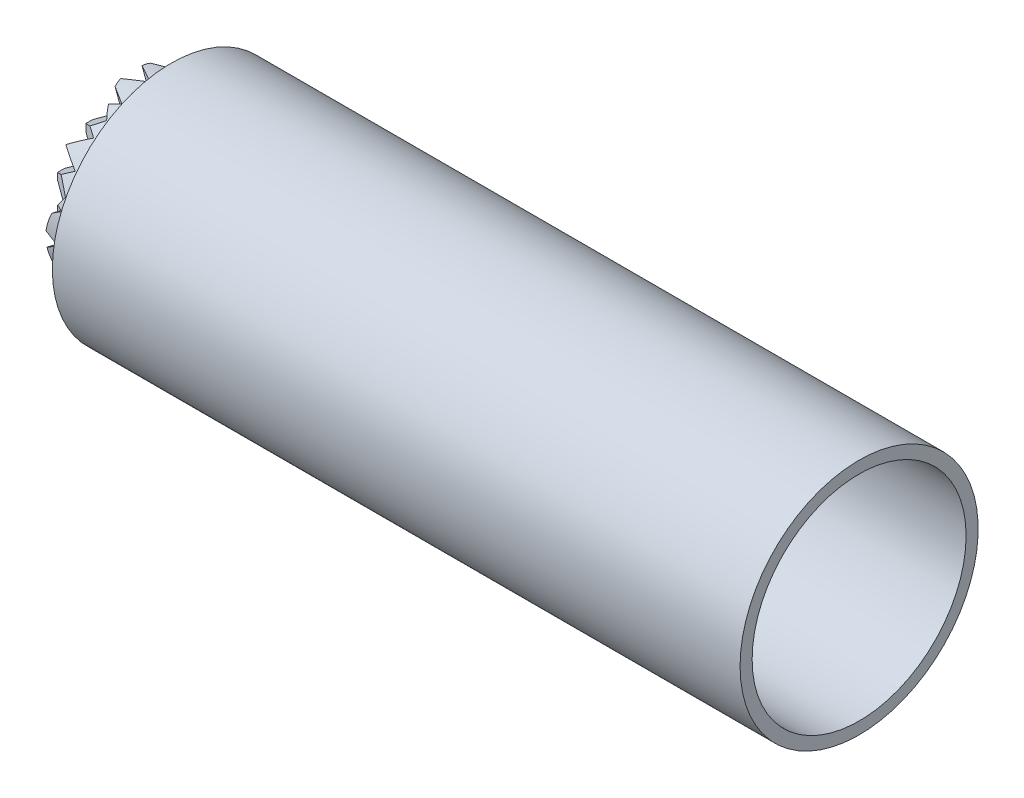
ISO-10303-21;
HEADER;
FILE_DESCRIPTION(('STEP AP214'),'2;1');
FILE_NAME('part.step','',(''),(''),'','','');
FILE_SCHEMA(('AUTOMOTIVE_DESIGN { 1 0 10303 214 1 1 1 1 }'));
ENDSEC;
DATA;
#1=APPLICATION_CONTEXT('core data for automotive mechanical design processes');
#2=APPLICATION_PROTOCOL_DEFINITION('international standard','automotive_design',2000,#1);
#3=PRODUCT_CONTEXT('',#1,'mechanical');
#4=PRODUCT('Part','Part','',(#3));
#5=PRODUCT_RELATED_PRODUCT_CATEGORY('part','',(#4));
#6=PRODUCT_DEFINITION_FORMATION('','',#4);
#7=PRODUCT_DEFINITION_CONTEXT('part definition',#1,'design');
#8=PRODUCT_DEFINITION('design','',#6,#7);
#9=PRODUCT_DEFINITION_SHAPE('','',#8);
#10=(LENGTH_UNIT() NAMED_UNIT(*) SI_UNIT(.MILLI.,.METRE.));
#11=(NAMED_UNIT(*) PLANE_ANGLE_UNIT() SI_UNIT($,.RADIAN.));
#12=(NAMED_UNIT(*) SI_UNIT($,.STERADIAN.) SOLID_ANGLE_UNIT());
#13=UNCERTAINTY_MEASURE_WITH_UNIT(LENGTH_MEASURE(1.E-05),#10,'distance_accuracy_value','');
#14=(GEOMETRIC_REPRESENTATION_CONTEXT(3) GLOBAL_UNCERTAINTY_ASSIGNED_CONTEXT((#13)) GLOBAL_UNIT_ASSIGNED_CONTEXT((#10,
#11,#12)) REPRESENTATION_CONTEXT('',''));
#15=CARTESIAN_POINT('',(0.,0.,0.));
#16=DIRECTION('',(0.,0.,1.));
#17=DIRECTION('',(1.,0.,0.));
#18=AXIS2_PLACEMENT_3D('',#15,#16,#17);
#19=CARTESIAN_POINT('',(4.71676746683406,-5.93828249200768,-0.898025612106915));
#20=CARTESIAN_POINT('',(4.68140576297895,-5.87703422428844,-1.05664695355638));
#21=CARTESIAN_POINT('',(4.63896070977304,-5.80351723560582,-1.19504870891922));
#22=CARTESIAN_POINT('',(4.54352500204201,-5.63821774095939,-1.43299889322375));
#23=CARTESIAN_POINT('',(4.49250569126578,-5.54984970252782,-1.52731932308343));
#24=CARTESIAN_POINT('',(4.38882797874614,-5.37027463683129,-1.66343659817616));
#25=CARTESIAN_POINT('',(4.33766583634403,-5.28165920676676,-1.70297475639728));
#26=CARTESIAN_POINT('',(4.24197324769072,-5.11591478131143,-1.72170117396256));
#27=CARTESIAN_POINT('',(4.19825430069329,-5.04019134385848,-1.70049511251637));
#28=CARTESIAN_POINT('',(4.12203285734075,-4.90817193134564,-1.59938512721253));
#29=CARTESIAN_POINT('',(4.08989663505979,-4.85251036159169,-1.52017568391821));
#30=CARTESIAN_POINT('',(4.03678142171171,-4.76051211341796,-1.31183243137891));
#31=CARTESIAN_POINT('',(4.01603871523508,-4.72458469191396,-1.18398216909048));
#32=CARTESIAN_POINT('',(3.98383747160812,-4.66881050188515,-0.890287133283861));
#33=CARTESIAN_POINT('',(3.97249105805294,-4.64915793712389,-0.725426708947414));
#34=CARTESIAN_POINT('',(3.96127829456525,-4.62973686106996,-0.462354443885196));
#35=CARTESIAN_POINT('',(3.95848161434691,-4.62489286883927,-0.370741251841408));
#36=CARTESIAN_POINT('',(3.95482079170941,-4.61855213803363,-0.187553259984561));
#37=CARTESIAN_POINT('',(3.95391467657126,-4.61698270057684,-0.0953093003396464));
#38=CARTESIAN_POINT('',(3.95388343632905,-4.6169285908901,0.0904851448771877));
#39=CARTESIAN_POINT('',(3.95478429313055,-4.61848892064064,0.184827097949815));
#40=CARTESIAN_POINT('',(3.95841613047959,-4.624779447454,0.368339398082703));
#41=CARTESIAN_POINT('',(3.96113173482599,-4.62948301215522,0.458084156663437));
#42=CARTESIAN_POINT('',(3.97225130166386,-4.64874266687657,0.721406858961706));
#43=CARTESIAN_POINT('',(3.98361326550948,-4.66842216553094,0.887408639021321));
#44=CARTESIAN_POINT('',(4.03161570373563,-4.75156482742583,1.32769600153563));
#45=CARTESIAN_POINT('',(4.08373438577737,-4.84183703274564,1.54746654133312));
#46=CARTESIAN_POINT('',(4.19703801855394,-5.03808468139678,1.69942934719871));
#47=CARTESIAN_POINT('',(4.24118447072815,-5.11454857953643,1.72138043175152));
#48=CARTESIAN_POINT('',(4.33616984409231,-5.27906807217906,1.70373132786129));
#49=CARTESIAN_POINT('',(4.38814713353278,-5.36909537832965,1.66395872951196));
#50=CARTESIAN_POINT('',(4.49111777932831,-5.54744576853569,1.52950584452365));
#51=CARTESIAN_POINT('',(4.54318644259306,-5.63763133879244,1.4334961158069));
#52=CARTESIAN_POINT('',(4.63781324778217,-5.80152977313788,1.19825118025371));
#53=CARTESIAN_POINT('',(4.68140181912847,-5.87702739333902,1.0566646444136));
#54=CARTESIAN_POINT('',(4.71676746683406,-5.93828249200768,0.898025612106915));
#55=B_SPLINE_CURVE_WITH_KNOTS('',3,(#19,#20,#21,#22,#23,#24,#25,#26,#27,#28,#29,#30,#31,#32,#33,
#34,#35,#36,#37,#38,#39,#40,#41,#42,#43,#44,#45,#46,#47,#48,#49,#50,#51,#52,#53,#54),
.UNSPECIFIED.,.F.,.F.,(4,2,2,2,2,2,2,2,2,2,2,2,2,2,2,2,2,4),(0.,0.0625,0.125,0.1875,0.25,0.3125,
0.375,0.4375,0.46875,0.5,0.53125,0.5625,0.625,0.75,0.8125,0.875,0.9375,1.),.UNSPECIFIED.);
#56=DIRECTION('',(0.866025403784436,0.500000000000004,0.));
#57=VECTOR('',#56,1.);
#58=SURFACE_OF_LINEAR_EXTRUSION('',#55,#57);
#59=CARTESIAN_POINT('',(5.2710237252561,-5.61828249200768,0.898025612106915));
#60=CARTESIAN_POINT('',(5.23565807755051,-5.55702739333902,1.0566646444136));
#61=CARTESIAN_POINT('',(5.1920695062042,-5.48152977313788,1.19825118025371));
#62=CARTESIAN_POINT('',(5.0974427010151,-5.31763133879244,1.4334961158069));
#63=CARTESIAN_POINT('',(5.04537403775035,-5.22744576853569,1.52950584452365));
#64=CARTESIAN_POINT('',(4.94240339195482,-5.04909537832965,1.66395872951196));
#65=CARTESIAN_POINT('',(4.89042610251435,-4.95906807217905,1.70373132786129));
#66=CARTESIAN_POINT('',(4.79544072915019,-4.79454857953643,1.72138043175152));
#67=CARTESIAN_POINT('',(4.75129427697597,-4.71808468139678,1.69942934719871));
#68=CARTESIAN_POINT('',(4.63799064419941,-4.52183703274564,1.54746654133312));
#69=CARTESIAN_POINT('',(4.58587196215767,-4.43156482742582,1.32769600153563));
#70=CARTESIAN_POINT('',(4.53786952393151,-4.34842216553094,0.887408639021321));
#71=CARTESIAN_POINT('',(4.5265075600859,-4.32874266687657,0.721406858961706));
#72=CARTESIAN_POINT('',(4.51538799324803,-4.30948301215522,0.458084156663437));
#73=CARTESIAN_POINT('',(4.51267238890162,-4.304779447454,0.368339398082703));
#74=CARTESIAN_POINT('',(4.50904055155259,-4.29848892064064,0.184827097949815));
#75=CARTESIAN_POINT('',(4.50813969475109,-4.2969285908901,0.0904851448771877));
#76=CARTESIAN_POINT('',(4.5081709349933,-4.29698270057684,-0.0953093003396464));
#77=CARTESIAN_POINT('',(4.50907705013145,-4.29855213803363,-0.187553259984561));
#78=CARTESIAN_POINT('',(4.51273787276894,-4.30489286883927,-0.370741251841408));
#79=CARTESIAN_POINT('',(4.51553455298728,-4.30973686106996,-0.462354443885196));
#80=CARTESIAN_POINT('',(4.52674731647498,-4.32915793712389,-0.725426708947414));
#81=CARTESIAN_POINT('',(4.53809373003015,-4.34881050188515,-0.890287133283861));
#82=CARTESIAN_POINT('',(4.57029497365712,-4.40458469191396,-1.18398216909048));
#83=CARTESIAN_POINT('',(4.59103768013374,-4.44051211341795,-1.31183243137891));
#84=CARTESIAN_POINT('',(4.64415289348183,-4.53251036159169,-1.52017568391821));
#85=CARTESIAN_POINT('',(4.67628911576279,-4.58817193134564,-1.59938512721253));
#86=CARTESIAN_POINT('',(4.75251055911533,-4.72019134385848,-1.70049511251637));
#87=CARTESIAN_POINT('',(4.79622950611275,-4.79591478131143,-1.72170117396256));
#88=CARTESIAN_POINT('',(4.89192209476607,-4.96165920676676,-1.70297475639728));
#89=CARTESIAN_POINT('',(4.94308423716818,-5.05027463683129,-1.66343659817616));
#90=CARTESIAN_POINT('',(5.04676194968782,-5.22984970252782,-1.52731932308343));
#91=CARTESIAN_POINT('',(5.09778126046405,-5.31821774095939,-1.43299889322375));
#92=CARTESIAN_POINT('',(5.19321696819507,-5.48351723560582,-1.19504870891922));
#93=CARTESIAN_POINT('',(5.23566202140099,-5.55703422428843,-1.05664695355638));
#94=CARTESIAN_POINT('',(5.2710237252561,-5.61828249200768,-0.898025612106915));
#95=B_SPLINE_CURVE_WITH_KNOTS('',3,(#59,#60,#61,#62,#63,#64,#65,#66,#67,#68,#69,#70,#71,#72,#73,
#74,#75,#76,#77,#78,#79,#80,#81,#82,#83,#84,#85,#86,#87,#88,#89,#90,#91,#92,#93,#94),
.UNSPECIFIED.,.F.,.F.,(4,2,2,2,2,2,2,2,2,2,2,2,2,2,2,2,2,4),(0.,0.0625,0.125,0.1875,0.25,0.375,
0.4375,0.46875,0.5,0.53125,0.5625,0.625,0.6875,0.75,0.8125,0.875,0.9375,1.),.UNSPECIFIED.);
#96=CARTESIAN_POINT('',(5.2710237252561,-5.61828249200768,-0.898025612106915));
#97=VERTEX_POINT('',#96);
#98=CARTESIAN_POINT('',(5.2710237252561,-5.61828249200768,0.898025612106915));
#99=VERTEX_POINT('',#98);
#100=EDGE_CURVE('E75',#97,#99,#95,.F.);
#101=ORIENTED_EDGE('',*,*,#100,.F.);
#102=DIRECTION('',(0.866025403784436,0.500000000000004,0.));
#103=VECTOR('',#102,1.);
#104=CARTESIAN_POINT('',(4.71676746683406,-5.93828249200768,-0.898025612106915));
#105=LINE('',#104,#103);
#106=CARTESIAN_POINT('',(4.71676746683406,-5.93828249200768,-0.898025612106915));
#107=VERTEX_POINT('',#106);
#108=EDGE_CURVE('E12',#107,#97,#105,.T.);
#109=ORIENTED_EDGE('',*,*,#108,.F.);
#110=CARTESIAN_POINT('',(4.71676746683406,-5.93828249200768,-0.898025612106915));
#111=CARTESIAN_POINT('',(4.68140576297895,-5.87703422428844,-1.05664695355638));
#112=CARTESIAN_POINT('',(4.63896070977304,-5.80351723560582,-1.19504870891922));
#113=CARTESIAN_POINT('',(4.54352500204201,-5.63821774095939,-1.43299889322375));
#114=CARTESIAN_POINT('',(4.49250569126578,-5.54984970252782,-1.52731932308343));
#115=CARTESIAN_POINT('',(4.38882797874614,-5.37027463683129,-1.66343659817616));
#116=CARTESIAN_POINT('',(4.33766583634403,-5.28165920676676,-1.70297475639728));
#117=CARTESIAN_POINT('',(4.24197324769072,-5.11591478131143,-1.72170117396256));
#118=CARTESIAN_POINT('',(4.19825430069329,-5.04019134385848,-1.70049511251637));
#119=CARTESIAN_POINT('',(4.12203285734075,-4.90817193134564,-1.59938512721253));
#120=CARTESIAN_POINT('',(4.08989663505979,-4.85251036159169,-1.52017568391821));
#121=CARTESIAN_POINT('',(4.03678142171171,-4.76051211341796,-1.31183243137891));
#122=CARTESIAN_POINT('',(4.01603871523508,-4.72458469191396,-1.18398216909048));
#123=CARTESIAN_POINT('',(3.98383747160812,-4.66881050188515,-0.890287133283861));
#124=CARTESIAN_POINT('',(3.97249105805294,-4.64915793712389,-0.725426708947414));
#125=CARTESIAN_POINT('',(3.96127829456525,-4.62973686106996,-0.462354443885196));
#126=CARTESIAN_POINT('',(3.95848161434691,-4.62489286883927,-0.370741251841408));
#127=CARTESIAN_POINT('',(3.95482079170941,-4.61855213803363,-0.187553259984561));
#128=CARTESIAN_POINT('',(3.95391467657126,-4.61698270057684,-0.0953093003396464));
#129=CARTESIAN_POINT('',(3.95388343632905,-4.6169285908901,0.0904851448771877));
#130=CARTESIAN_POINT('',(3.95478429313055,-4.61848892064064,0.184827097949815));
#131=CARTESIAN_POINT('',(3.95841613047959,-4.624779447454,0.368339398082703));
#132=CARTESIAN_POINT('',(3.96113173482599,-4.62948301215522,0.458084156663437));
#133=CARTESIAN_POINT('',(3.97225130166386,-4.64874266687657,0.721406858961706));
#134=CARTESIAN_POINT('',(3.98361326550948,-4.66842216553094,0.887408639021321));
#135=CARTESIAN_POINT('',(4.03161570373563,-4.75156482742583,1.32769600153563));
#136=CARTESIAN_POINT('',(4.08373438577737,-4.84183703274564,1.54746654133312));
#137=CARTESIAN_POINT('',(4.19703801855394,-5.03808468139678,1.69942934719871));
#138=CARTESIAN_POINT('',(4.24118447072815,-5.11454857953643,1.72138043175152));
#139=CARTESIAN_POINT('',(4.33616984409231,-5.27906807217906,1.70373132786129));
#140=CARTESIAN_POINT('',(4.38814713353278,-5.36909537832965,1.66395872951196));
#141=CARTESIAN_POINT('',(4.49111777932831,-5.54744576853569,1.52950584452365));
#142=CARTESIAN_POINT('',(4.54318644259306,-5.63763133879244,1.4334961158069));
#143=CARTESIAN_POINT('',(4.63781324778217,-5.80152977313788,1.19825118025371));
#144=CARTESIAN_POINT('',(4.68140181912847,-5.87702739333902,1.0566646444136));
#145=CARTESIAN_POINT('',(4.71676746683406,-5.93828249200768,0.898025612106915));
#146=B_SPLINE_CURVE_WITH_KNOTS('',3,(#110,#111,#112,#113,#114,#115,#116,#117,#118,#119,#120,
#121,#122,#123,#124,#125,#126,#127,#128,#129,#130,#131,#132,#133,#134,#135,#136,#137,#138,#139,
#140,#141,#142,#143,#144,#145),.UNSPECIFIED.,.F.,.F.,(4,2,2,2,2,2,2,2,2,2,2,2,2,2,2,2,2,4),(0.,
0.0625,0.125,0.1875,0.25,0.3125,0.375,0.4375,0.46875,0.5,0.53125,0.5625,0.625,0.75,0.8125,0.875,
0.9375,1.),.UNSPECIFIED.);
#147=CARTESIAN_POINT('',(4.71676746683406,-5.93828249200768,0.898025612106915));
#148=VERTEX_POINT('',#147);
#149=EDGE_CURVE('E82',#107,#148,#146,.T.);
#150=ORIENTED_EDGE('',*,*,#149,.T.);
#151=DIRECTION('',(0.866025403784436,0.500000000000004,0.));
#152=VECTOR('',#151,1.);
#153=CARTESIAN_POINT('',(4.71676746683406,-5.93828249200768,0.898025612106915));
#154=LINE('',#153,#152);
#155=EDGE_CURVE('E53',#148,#99,#154,.T.);
#156=ORIENTED_EDGE('',*,*,#155,.T.);
#157=EDGE_LOOP('',(#101,#109,#150,#156));
#158=FACE_BOUND('',#157,.T.);
#159=ADVANCED_FACE('F42',(#158),#58,.T.);
#160=CARTESIAN_POINT('',(4.71676746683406,-5.93828249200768,0.898025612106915));
#161=DIRECTION('',(0.500000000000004,-0.866025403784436,0.));
#162=DIRECTION('',(0.866025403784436,0.500000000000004,0.));
#163=AXIS2_PLACEMENT_3D('',#160,#161,#162);
#164=PLANE('',#163);
#165=DIRECTION('',(0.,0.,-1.));
#166=VECTOR('',#165,1.);
#167=CARTESIAN_POINT('',(5.2710237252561,-5.61828249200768,0.898025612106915));
#168=LINE('',#167,#166);
#169=EDGE_CURVE('E72',#99,#97,#168,.T.);
#170=ORIENTED_EDGE('',*,*,#169,.F.);
#171=ORIENTED_EDGE('',*,*,#155,.F.);
#172=DIRECTION('',(0.,0.,-1.));
#173=VECTOR('',#172,1.);
#174=CARTESIAN_POINT('',(4.71676746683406,-5.93828249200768,0.898025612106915));
#175=LINE('',#174,#173);
#176=EDGE_CURVE('E74',#148,#107,#175,.T.);
#177=ORIENTED_EDGE('',*,*,#176,.T.);
#178=ORIENTED_EDGE('',*,*,#108,.T.);
#179=EDGE_LOOP('',(#170,#171,#177,#178));
#180=FACE_BOUND('',#179,.T.);
#181=ADVANCED_FACE('F70',(#180),#164,.T.);
#182=CARTESIAN_POINT('',(3.95389905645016,-4.61695564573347,-0.0024120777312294));
#183=DIRECTION('',(-0.86602540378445,-0.499999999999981,0.));
#184=DIRECTION('',(0.499999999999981,-0.86602540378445,0.));
#185=AXIS2_PLACEMENT_3D('',#182,#183,#184);
#186=PLANE('',#185);
#187=ORIENTED_EDGE('',*,*,#149,.F.);
#188=ORIENTED_EDGE('',*,*,#176,.F.);
#189=EDGE_LOOP('',(#187,#188));
#190=FACE_BOUND('',#189,.T.);
#191=ADVANCED_FACE('F110',(#190),#186,.T.);
#192=CARTESIAN_POINT('',(4.5081553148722,-4.29695564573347,-0.0024120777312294));
#193=DIRECTION('',(-0.86602540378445,-0.499999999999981,0.));
#194=DIRECTION('',(0.499999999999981,-0.86602540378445,0.));
#195=AXIS2_PLACEMENT_3D('',#192,#193,#194);
#196=PLANE('',#195);
#197=ORIENTED_EDGE('',*,*,#100,.T.);
#198=ORIENTED_EDGE('',*,*,#169,.T.);
#199=EDGE_LOOP('',(#197,#198));
#200=FACE_BOUND('',#199,.T.);
#201=ADVANCED_FACE('F81',(#200),#196,.F.);
#202=CLOSED_SHELL('',(#159,#181,#191,#201));
#203=MANIFOLD_SOLID_BREP('B2',#202);
#204=CARTESIAN_POINT('',(0.,0.,0.));
#205=DIRECTION('',(-1.,0.,0.));
#206=DIRECTION('',(0.,0.,1.));
#207=AXIS2_PLACEMENT_3D('',#204,#205,#206);
#208=CYLINDRICAL_SURFACE('',#207,4.978);
#209=CARTESIAN_POINT('',(0.,0.,0.));
#210=DIRECTION('',(-1.,0.,0.));
#211=DIRECTION('',(0.,0.,1.));
#212=AXIS2_PLACEMENT_3D('',#209,#210,#211);
#213=CIRCLE('',#212,4.978);
#214=CARTESIAN_POINT('',(0.,0.,4.978));
#215=VERTEX_POINT('',#214);
#216=EDGE_CURVE('E2013',#215,#215,#213,.T.);
#217=ORIENTED_EDGE('',*,*,#216,.T.);
#218=EDGE_LOOP('',(#217));
#219=FACE_BOUND('',#218,.T.);
#220=CARTESIAN_POINT('',(6.99389455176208,0.,0.));
#221=DIRECTION('',(-0.499999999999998,0.86602540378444,0.));
#222=DIRECTION('',(-0.86602540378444,-0.499999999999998,0.));
#223=AXIS2_PLACEMENT_3D('',#220,#221,#222);
#224=ELLIPSE('',#223,9.95600000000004,4.978);
#225=CARTESIAN_POINT('',(-1.59812270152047,-4.96060347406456,0.415809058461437));
#226=VERTEX_POINT('',#225);
#227=CARTESIAN_POINT('',(-1.23821775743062,-4.75281225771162,1.48029039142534));
#228=VERTEX_POINT('',#227);
#229=EDGE_CURVE('E1171',#226,#228,#224,.T.);
#230=ORIENTED_EDGE('',*,*,#229,.F.);
#231=CARTESIAN_POINT('',(-0.877920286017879,0.,0.));
#232=DIRECTION('',(-0.499999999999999,0.,-0.866025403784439));
#233=DIRECTION('',(-0.866025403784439,0.,0.499999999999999));
#234=AXIS2_PLACEMENT_3D('',#231,#232,#233);
#235=ELLIPSE('',#234,9.95600000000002,4.978);
#236=CARTESIAN_POINT('',(-1.04099999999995,-4.97710950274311,0.0941541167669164));
#237=VERTEX_POINT('',#236);
#238=EDGE_CURVE('E1979',#237,#226,#235,.T.);
#239=ORIENTED_EDGE('',*,*,#238,.F.);
#240=CARTESIAN_POINT('',(-1.20407971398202,0.,0.));
#241=DIRECTION('',(-0.499999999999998,0.,0.86602540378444));
#242=DIRECTION('',(-0.86602540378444,0.,-0.499999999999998));
#243=AXIS2_PLACEMENT_3D('',#240,#241,#242);
#244=ELLIPSE('',#243,9.95600000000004,4.978);
#245=CARTESIAN_POINT('',(-1.61829881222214,-4.97225215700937,-0.239149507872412));
#246=VERTEX_POINT('',#245);
#247=EDGE_CURVE('E1983',#246,#237,#244,.T.);
#248=ORIENTED_EDGE('',*,*,#247,.F.);
#249=CARTESIAN_POINT('',(-1.36612238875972,-4.82665803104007,-1.21813638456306));
#250=VERTEX_POINT('',#249);
#251=EDGE_CURVE('E2180',#250,#246,#224,.T.);
#252=ORIENTED_EDGE('',*,*,#251,.F.);
#253=CARTESIAN_POINT('',(-3.47599649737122,0.,0.));
#254=DIRECTION('',(-0.499999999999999,0.,-0.866025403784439));
#255=DIRECTION('',(-0.866025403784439,0.,0.499999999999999));
#256=AXIS2_PLACEMENT_3D('',#253,#254,#255);
#257=ELLIPSE('',#256,9.95600000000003,4.978);
#258=CARTESIAN_POINT('',(-1.04099999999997,-4.77536190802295,-1.40584588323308));
#259=VERTEX_POINT('',#258);
#260=EDGE_CURVE('E1990',#259,#250,#257,.T.);
#261=ORIENTED_EDGE('',*,*,#260,.F.);
#262=CARTESIAN_POINT('',(1.39399649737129,0.,0.));
#263=DIRECTION('',(-0.499999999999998,0.,0.86602540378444));
#264=DIRECTION('',(-0.86602540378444,0.,-0.499999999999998));
#265=AXIS2_PLACEMENT_3D('',#262,#263,#264);
#266=ELLIPSE('',#265,9.95600000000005,4.978);
#267=CARTESIAN_POINT('',(-1.22186572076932,-4.74337140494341,-1.51026875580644));
#268=VERTEX_POINT('',#267);
#269=EDGE_CURVE('E1993',#268,#259,#266,.T.);
#270=ORIENTED_EDGE('',*,*,#269,.F.);
#271=CARTESIAN_POINT('',(-1.04099999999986,-4.63894853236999,-1.80572437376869));
#272=VERTEX_POINT('',#271);
#273=EDGE_CURVE('E2173',#272,#268,#224,.T.);
#274=ORIENTED_EDGE('',*,*,#273,.F.);
#275=CARTESIAN_POINT('',(-9.07589455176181,0.,0.));
#276=DIRECTION('',(-0.499999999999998,-0.86602540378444,0.));
#277=DIRECTION('',(-0.86602540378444,0.499999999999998,0.));
#278=AXIS2_PLACEMENT_3D('',#275,#276,#277);
#279=ELLIPSE('',#278,9.95600000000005,4.978);
#280=CARTESIAN_POINT('',(-1.66583881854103,-4.27819767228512,-2.54509502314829));
#281=VERTEX_POINT('',#280);
#282=EDGE_CURVE('E1209',#281,#272,#279,.T.);
#283=ORIENTED_EDGE('',*,*,#282,.F.);
#284=CARTESIAN_POINT('',(-6.07407270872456,0.,0.));
#285=DIRECTION('',(-0.499999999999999,0.,-0.866025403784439));
#286=DIRECTION('',(-0.866025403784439,0.,0.499999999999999));
#287=AXIS2_PLACEMENT_3D('',#284,#285,#286);
#288=ELLIPSE('',#287,9.95600000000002,4.978);
#289=CARTESIAN_POINT('',(-1.04099999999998,-4.04184904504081,-2.90584588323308));
#290=VERTEX_POINT('',#289);
#291=EDGE_CURVE('E1997',#290,#281,#288,.T.);
#292=ORIENTED_EDGE('',*,*,#291,.F.);
#293=CARTESIAN_POINT('',(3.99207270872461,0.,0.));
#294=DIRECTION('',(-0.499999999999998,0.,0.86602540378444));
#295=DIRECTION('',(-0.86602540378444,0.,-0.499999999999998));
#296=AXIS2_PLACEMENT_3D('',#293,#294,#295);
#297=ELLIPSE('',#296,9.95600000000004,4.978);
#298=CARTESIAN_POINT('',(-1.89949138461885,-3.63459876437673,-3.40149611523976));
#299=VERTEX_POINT('',#298);
#300=EDGE_CURVE('E2000',#299,#290,#297,.T.);
#301=ORIENTED_EDGE('',*,*,#300,.F.);
#302=CARTESIAN_POINT('',(4.39581834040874,0.,0.));
#303=DIRECTION('',(-0.499999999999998,0.86602540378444,0.));
#304=DIRECTION('',(-0.86602540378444,-0.499999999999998,0.));
#305=AXIS2_PLACEMENT_3D('',#302,#303,#304);
#306=ELLIPSE('',#305,9.95600000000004,4.978);
#307=CARTESIAN_POINT('',(-1.04099999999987,-3.13894853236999,-3.8636105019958));
#308=VERTEX_POINT('',#307);
#309=EDGE_CURVE('E1302',#308,#299,#306,.T.);
#310=ORIENTED_EDGE('',*,*,#309,.F.);
#311=CARTESIAN_POINT('',(-6.47781834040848,0.,0.));
#312=DIRECTION('',(-0.499999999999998,-0.86602540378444,0.));
#313=DIRECTION('',(-0.86602540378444,0.499999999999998,0.));
#314=AXIS2_PLACEMENT_3D('',#311,#312,#313);
#315=ELLIPSE('',#314,9.95600000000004,4.978);
#316=CARTESIAN_POINT('',(-1.57773806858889,-2.8290626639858,-4.09596001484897));
#317=VERTEX_POINT('',#316);
#318=EDGE_CURVE('E1275',#317,#308,#315,.T.);
#319=ORIENTED_EDGE('',*,*,#318,.F.);
#320=CARTESIAN_POINT('',(-8.6721489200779,0.,0.));
#321=DIRECTION('',(-0.499999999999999,0.,-0.866025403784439));
#322=DIRECTION('',(-0.866025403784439,0.,0.499999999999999));
#323=AXIS2_PLACEMENT_3D('',#320,#321,#322);
#324=ELLIPSE('',#323,9.95600000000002,4.978);
#325=CARTESIAN_POINT('',(-1.041,-2.31711157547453,-4.40584588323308));
#326=VERTEX_POINT('',#325);
#327=EDGE_CURVE('E2004',#326,#317,#324,.T.);
#328=ORIENTED_EDGE('',*,*,#327,.F.);
#329=CARTESIAN_POINT('',(6.59014892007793,0.,0.));
#330=DIRECTION('',(-0.499999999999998,0.,0.86602540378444));
#331=DIRECTION('',(-0.86602540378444,0.,-0.499999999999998));
#332=AXIS2_PLACEMENT_3D('',#329,#330,#331);
#333=ELLIPSE('',#332,9.95600000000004,4.978);
#334=CARTESIAN_POINT('',(-1.41220603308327,-1.85326443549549,-4.62016178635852));
#335=VERTEX_POINT('',#334);
#336=EDGE_CURVE('E1842',#335,#326,#333,.T.);
#337=ORIENTED_EDGE('',*,*,#336,.F.);
#338=CARTESIAN_POINT('',(1.79774212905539,0.,0.));
#339=DIRECTION('',(-0.499999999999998,0.86602540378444,0.));
#340=DIRECTION('',(-0.86602540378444,-0.499999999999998,0.));
#341=AXIS2_PLACEMENT_3D('',#338,#339,#340);
#342=ELLIPSE('',#341,9.95600000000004,4.978);
#343=CARTESIAN_POINT('',(-1.04099999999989,-1.63894853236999,-4.70046079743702));
#344=VERTEX_POINT('',#343);
#345=EDGE_CURVE('E1383',#344,#335,#342,.T.);
#346=ORIENTED_EDGE('',*,*,#345,.F.);
#347=CARTESIAN_POINT('',(-3.87974212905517,0.,0.));
#348=DIRECTION('',(-0.499999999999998,-0.86602540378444,0.));
#349=DIRECTION('',(-0.86602540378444,0.499999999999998,0.));
#350=AXIS2_PLACEMENT_3D('',#347,#348,#349);
#351=ELLIPSE('',#350,9.95600000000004,4.978);
#352=CARTESIAN_POINT('',(-1.76986802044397,-1.21813638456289,-4.82665803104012));
#353=VERTEX_POINT('',#352);
#354=EDGE_CURVE('E1343',#353,#344,#351,.T.);
#355=ORIENTED_EDGE('',*,*,#354,.F.);
#356=CARTESIAN_POINT('',(-1.95441379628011,-0.66630823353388,-4.93320558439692));
#357=VERTEX_POINT('',#356);
#358=EDGE_CURVE('E1829',#357,#353,#333,.T.);
#359=ORIENTED_EDGE('',*,*,#358,.F.);
#360=CARTESIAN_POINT('',(-0.800334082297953,0.,0.));
#361=DIRECTION('',(-0.499999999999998,0.86602540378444,0.));
#362=DIRECTION('',(-0.86602540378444,-0.499999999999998,0.));
#363=AXIS2_PLACEMENT_3D('',#360,#361,#362);
#364=ELLIPSE('',#363,9.95600000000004,4.978);
#365=CARTESIAN_POINT('',(-1.0409999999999,-0.138948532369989,-4.97606042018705));
#366=VERTEX_POINT('',#365);
#367=EDGE_CURVE('E1476',#366,#357,#364,.T.);
#368=ORIENTED_EDGE('',*,*,#367,.F.);
#369=CARTESIAN_POINT('',(-1.28166591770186,0.,0.));
#370=DIRECTION('',(-0.499999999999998,-0.86602540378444,0.));
#371=DIRECTION('',(-0.86602540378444,0.499999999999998,0.));
#372=AXIS2_PLACEMENT_3D('',#369,#370,#371);
#373=ELLIPSE('',#372,9.95600000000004,4.978);
#374=CARTESIAN_POINT('',(-2.00186833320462,0.415809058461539,-4.96060347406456));
#375=VERTEX_POINT('',#374);
#376=EDGE_CURVE('E1436',#375,#366,#373,.T.);
#377=ORIENTED_EDGE('',*,*,#376,.F.);
#378=CARTESIAN_POINT('',(-1.90097171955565,0.864546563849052,-4.902350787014));
#379=VERTEX_POINT('',#378);
#380=EDGE_CURVE('E1866',#379,#375,#333,.T.);
#381=ORIENTED_EDGE('',*,*,#380,.F.);
#382=CARTESIAN_POINT('',(-3.3984102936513,0.,0.));
#383=DIRECTION('',(-0.499999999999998,0.86602540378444,0.));
#384=DIRECTION('',(-0.86602540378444,-0.499999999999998,0.));
#385=AXIS2_PLACEMENT_3D('',#382,#383,#384);
#386=ELLIPSE('',#385,9.95600000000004,4.978);
#387=CARTESIAN_POINT('',(-1.04099999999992,1.36105146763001,-4.78832151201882));
#388=VERTEX_POINT('',#387);
#389=EDGE_CURVE('E1571',#388,#379,#386,.T.);
#390=ORIENTED_EDGE('',*,*,#389,.F.);
#391=CARTESIAN_POINT('',(1.31641029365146,0.,0.));
#392=DIRECTION('',(-0.499999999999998,-0.86602540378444,0.));
#393=DIRECTION('',(-0.86602540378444,0.499999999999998,0.));
#394=AXIS2_PLACEMENT_3D('',#391,#392,#393);
#395=ELLIPSE('',#394,9.95600000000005,4.978);
#396=CARTESIAN_POINT('',(-1.54377835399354,1.65133068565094,-4.69612510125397));
#397=VERTEX_POINT('',#396);
#398=EDGE_CURVE('E1531',#397,#388,#395,.T.);
#399=ORIENTED_EDGE('',*,*,#398,.F.);
#400=CARTESIAN_POINT('',(-1.041,2.31711157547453,-4.40584588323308));
#401=VERTEX_POINT('',#400);
#402=EDGE_CURVE('E2006',#401,#397,#333,.T.);
#403=ORIENTED_EDGE('',*,*,#402,.F.);
#404=CARTESIAN_POINT('',(-1.38613028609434,2.66179040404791,-4.20658481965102));
#405=VERTEX_POINT('',#404);
#406=EDGE_CURVE('E2003',#405,#401,#324,.T.);
#407=ORIENTED_EDGE('',*,*,#406,.F.);
#408=CARTESIAN_POINT('',(-5.99648650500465,0.,0.));
#409=DIRECTION('',(-0.499999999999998,0.86602540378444,0.));
#410=DIRECTION('',(-0.86602540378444,-0.499999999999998,0.));
#411=AXIS2_PLACEMENT_3D('',#408,#409,#410);
#412=ELLIPSE('',#411,9.95600000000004,4.978);
#413=CARTESIAN_POINT('',(-1.04099999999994,2.86105146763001,-4.07367997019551));
#414=VERTEX_POINT('',#413);
#415=EDGE_CURVE('E1623',#414,#405,#412,.T.);
#416=ORIENTED_EDGE('',*,*,#415,.F.);
#417=CARTESIAN_POINT('',(3.91448650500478,0.,0.));
#418=DIRECTION('',(-0.499999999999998,-0.86602540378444,0.));
#419=DIRECTION('',(-0.86602540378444,0.499999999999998,0.));
#420=AXIS2_PLACEMENT_3D('',#417,#418,#419);
#421=ELLIPSE('',#420,9.95600000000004,4.978);
#422=CARTESIAN_POINT('',(-2.03199999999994,3.43320558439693,-3.60466134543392));
#423=VERTEX_POINT('',#422);
#424=EDGE_CURVE('E1661',#423,#414,#421,.T.);
#425=ORIENTED_EDGE('',*,*,#424,.F.);
#426=CARTESIAN_POINT('',(-2.032,0.,0.));
#427=DIRECTION('',(-1.,0.,0.));
#428=DIRECTION('',(0.,0.,1.));
#429=AXIS2_PLACEMENT_3D('',#426,#427,#428);
#430=CIRCLE('',#429,4.978);
#431=CARTESIAN_POINT('',(-2.03199999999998,3.56146037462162,-3.478));
#432=VERTEX_POINT('',#431);
#433=EDGE_CURVE('E2012',#432,#423,#430,.T.);
#434=ORIENTED_EDGE('',*,*,#433,.F.);
#435=CARTESIAN_POINT('',(-1.04099999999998,4.04184904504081,-2.90584588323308));
#436=VERTEX_POINT('',#435);
#437=EDGE_CURVE('E2001',#436,#432,#297,.T.);
#438=ORIENTED_EDGE('',*,*,#437,.F.);
#439=CARTESIAN_POINT('',(-1.36921012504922,4.17155926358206,-2.71635367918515));
#440=VERTEX_POINT('',#439);
#441=EDGE_CURVE('E1998',#440,#436,#288,.T.);
#442=ORIENTED_EDGE('',*,*,#441,.F.);
#443=CARTESIAN_POINT('',(-8.59456271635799,0.,0.));
#444=DIRECTION('',(-0.499999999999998,0.86602540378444,0.));
#445=DIRECTION('',(-0.86602540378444,-0.499999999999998,0.));
#446=AXIS2_PLACEMENT_3D('',#443,#444,#445);
#447=ELLIPSE('',#446,9.95600000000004,4.978);
#448=CARTESIAN_POINT('',(-1.04099999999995,4.36105146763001,-2.40035707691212));
#449=VERTEX_POINT('',#448);
#450=EDGE_CURVE('E1698',#449,#440,#447,.T.);
#451=ORIENTED_EDGE('',*,*,#450,.F.);
#452=CARTESIAN_POINT('',(6.51256271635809,0.,0.));
#453=DIRECTION('',(-0.499999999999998,-0.86602540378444,0.));
#454=DIRECTION('',(-0.86602540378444,0.499999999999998,0.));
#455=AXIS2_PLACEMENT_3D('',#452,#453,#454);
#456=ELLIPSE('',#455,9.95600000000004,4.978);
#457=CARTESIAN_POINT('',(-1.58032644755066,4.67243173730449,-1.71722615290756));
#458=VERTEX_POINT('',#457);
#459=EDGE_CURVE('E1736',#458,#449,#456,.T.);
#460=ORIENTED_EDGE('',*,*,#459,.F.);
#461=CARTESIAN_POINT('',(-1.04099999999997,4.77536190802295,-1.40584588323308));
#462=VERTEX_POINT('',#461);
#463=EDGE_CURVE('E1994',#462,#458,#266,.T.);
#464=ORIENTED_EDGE('',*,*,#463,.F.);
#465=CARTESIAN_POINT('',(-1.97855792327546,4.90235078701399,-0.864546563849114));
#466=VERTEX_POINT('',#465);
#467=EDGE_CURVE('E1991',#466,#462,#257,.T.);
#468=ORIENTED_EDGE('',*,*,#467,.F.);
#469=CARTESIAN_POINT('',(-2.03199999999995,4.93320558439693,-0.666308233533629));
#470=VERTEX_POINT('',#469);
#471=EDGE_CURVE('E1723',#470,#466,#456,.T.);
#472=ORIENTED_EDGE('',*,*,#471,.F.);
#473=CARTESIAN_POINT('',(-2.03199999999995,4.95499747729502,-0.477999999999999));
#474=VERTEX_POINT('',#473);
#475=EDGE_CURVE('E2009',#474,#470,#430,.T.);
#476=ORIENTED_EDGE('',*,*,#475,.F.);
#477=CARTESIAN_POINT('',(-1.04099999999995,4.97710950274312,0.0941541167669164));
#478=VERTEX_POINT('',#477);
#479=EDGE_CURVE('E1988',#478,#474,#244,.T.);
#480=ORIENTED_EDGE('',*,*,#479,.F.);
#481=CARTESIAN_POINT('',(-2.03199999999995,4.93320558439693,0.666308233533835));
#482=VERTEX_POINT('',#481);
#483=EDGE_CURVE('E1985',#482,#478,#235,.T.);
#484=ORIENTED_EDGE('',*,*,#483,.F.);
#485=CARTESIAN_POINT('',(-1.89631483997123,4.85486772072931,1.10033786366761));
#486=VERTEX_POINT('',#485);
#487=EDGE_CURVE('E1720',#486,#482,#456,.T.);
#488=ORIENTED_EDGE('',*,*,#487,.F.);
#489=CARTESIAN_POINT('',(-3.80215592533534,0.,0.));
#490=DIRECTION('',(-0.499999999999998,0.,0.86602540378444));
#491=DIRECTION('',(-0.86602540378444,0.,-0.499999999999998));
#492=AXIS2_PLACEMENT_3D('',#489,#490,#491);
#493=ELLIPSE('',#492,9.95600000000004,4.978);
#494=CARTESIAN_POINT('',(-1.04099999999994,4.71584103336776,1.59415411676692));
#495=VERTEX_POINT('',#494);
#496=EDGE_CURVE('E1976',#495,#486,#493,.T.);
#497=ORIENTED_EDGE('',*,*,#496,.F.);
#498=CARTESIAN_POINT('',(1.72015592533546,0.,0.));
#499=DIRECTION('',(-0.499999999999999,0.,-0.866025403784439));
#500=DIRECTION('',(-0.866025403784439,0.,0.499999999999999));
#501=AXIS2_PLACEMENT_3D('',#498,#499,#500);
#502=ELLIPSE('',#501,9.95600000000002,4.978);
#503=CARTESIAN_POINT('',(-1.48979223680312,4.62016178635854,1.85326443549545));
#504=VERTEX_POINT('',#503);
#505=EDGE_CURVE('E1974',#504,#495,#502,.T.);
#506=ORIENTED_EDGE('',*,*,#505,.F.);
#507=CARTESIAN_POINT('',(-1.04099999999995,4.36105146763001,2.40035707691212));
#508=VERTEX_POINT('',#507);
#509=EDGE_CURVE('E1722',#508,#504,#456,.T.);
#510=ORIENTED_EDGE('',*,*,#509,.F.);
#511=CARTESIAN_POINT('',(-1.50015186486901,4.09596001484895,2.82906266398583));
#512=VERTEX_POINT('',#511);
#513=EDGE_CURVE('E1695',#512,#508,#447,.T.);
#514=ORIENTED_EDGE('',*,*,#513,.F.);
#515=CARTESIAN_POINT('',(-6.40023213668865,0.,0.));
#516=DIRECTION('',(-0.499999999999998,0.,0.86602540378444));
#517=DIRECTION('',(-0.86602540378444,0.,-0.499999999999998));
#518=AXIS2_PLACEMENT_3D('',#515,#516,#517);
#519=ELLIPSE('',#518,9.95600000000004,4.978);
#520=CARTESIAN_POINT('',(-1.04099999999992,3.89957616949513,3.09415411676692));
#521=VERTEX_POINT('',#520);
#522=EDGE_CURVE('E1965',#521,#512,#519,.T.);
#523=ORIENTED_EDGE('',*,*,#522,.F.);
#524=CARTESIAN_POINT('',(4.3182321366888,0.,0.));
#525=DIRECTION('',(-0.499999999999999,0.,-0.866025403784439));
#526=DIRECTION('',(-0.866025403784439,0.,0.499999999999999));
#527=AXIS2_PLACEMENT_3D('',#524,#525,#526);
#528=ELLIPSE('',#527,9.95600000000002,4.978);
#529=CARTESIAN_POINT('',(-1.97707758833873,3.40149611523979,3.6345987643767));
#530=VERTEX_POINT('',#529);
#531=EDGE_CURVE('E1963',#530,#521,#528,.T.);
#532=ORIENTED_EDGE('',*,*,#531,.F.);
#533=CARTESIAN_POINT('',(-1.04099999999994,2.86105146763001,4.07367997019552));
#534=VERTEX_POINT('',#533);
#535=EDGE_CURVE('E1658',#534,#530,#421,.T.);
#536=ORIENTED_EDGE('',*,*,#535,.F.);
#537=CARTESIAN_POINT('',(-1.58825261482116,2.54509502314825,4.27819767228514));
#538=VERTEX_POINT('',#537);
#539=EDGE_CURVE('E1620',#538,#534,#412,.T.);
#540=ORIENTED_EDGE('',*,*,#539,.F.);
#541=CARTESIAN_POINT('',(-8.99830834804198,0.,0.));
#542=DIRECTION('',(-0.499999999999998,0.,0.86602540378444));
#543=DIRECTION('',(-0.86602540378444,0.,-0.499999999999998));
#544=AXIS2_PLACEMENT_3D('',#541,#542,#543);
#545=ELLIPSE('',#544,9.95600000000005,4.978);
#546=CARTESIAN_POINT('',(-1.0409999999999,1.91682861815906,4.59415411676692));
#547=VERTEX_POINT('',#546);
#548=EDGE_CURVE('E1966',#547,#538,#545,.T.);
#549=ORIENTED_EDGE('',*,*,#548,.F.);
#550=CARTESIAN_POINT('',(6.91630834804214,0.,0.));
#551=DIRECTION('',(-0.499999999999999,0.,-0.866025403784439));
#552=DIRECTION('',(-0.866025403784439,0.,0.499999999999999));
#553=AXIS2_PLACEMENT_3D('',#550,#551,#552);
#554=ELLIPSE('',#553,9.95600000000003,4.978);
#555=CARTESIAN_POINT('',(-1.29945192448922,1.51026875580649,4.7433714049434));
#556=VERTEX_POINT('',#555);
#557=EDGE_CURVE('E2532',#556,#547,#554,.T.);
#558=ORIENTED_EDGE('',*,*,#557,.F.);
#559=CARTESIAN_POINT('',(-1.04099999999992,1.36105146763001,4.78832151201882));
#560=VERTEX_POINT('',#559);
#561=EDGE_CURVE('E1528',#560,#556,#395,.T.);
#562=ORIENTED_EDGE('',*,*,#561,.F.);
#563=CARTESIAN_POINT('',(-1.49256920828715,1.10033786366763,4.85486772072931));
#564=VERTEX_POINT('',#563);
#565=EDGE_CURVE('E1568',#564,#560,#386,.T.);
#566=ORIENTED_EDGE('',*,*,#565,.F.);
#567=CARTESIAN_POINT('',(-1.69588501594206,0.239149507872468,4.97225215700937));
#568=VERTEX_POINT('',#567);
#569=EDGE_CURVE('E2533',#568,#564,#554,.T.);
#570=ORIENTED_EDGE('',*,*,#569,.F.);
#571=CARTESIAN_POINT('',(-1.0409999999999,-0.138948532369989,4.97606042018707));
#572=VERTEX_POINT('',#571);
#573=EDGE_CURVE('E1433',#572,#568,#373,.T.);
#574=ORIENTED_EDGE('',*,*,#573,.F.);
#575=CARTESIAN_POINT('',(-1.66261488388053,-0.497838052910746,4.95304363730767));
#576=VERTEX_POINT('',#575);
#577=EDGE_CURVE('E1473',#576,#572,#364,.T.);
#578=ORIENTED_EDGE('',*,*,#577,.F.);
#579=CARTESIAN_POINT('',(-1.31580396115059,-1.48029039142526,4.75281225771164));
#580=VERTEX_POINT('',#579);
#581=EDGE_CURVE('E1937',#580,#576,#554,.T.);
#582=ORIENTED_EDGE('',*,*,#581,.F.);
#583=CARTESIAN_POINT('',(-1.04099999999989,-1.63894853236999,4.70046079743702));
#584=VERTEX_POINT('',#583);
#585=EDGE_CURVE('E1340',#584,#580,#351,.T.);
#586=ORIENTED_EDGE('',*,*,#585,.F.);
#587=CARTESIAN_POINT('',(-1.17658081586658,-1.71722615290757,4.67243173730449));
#588=VERTEX_POINT('',#587);
#589=EDGE_CURVE('E1380',#588,#584,#342,.T.);
#590=ORIENTED_EDGE('',*,*,#589,.F.);
#591=CARTESIAN_POINT('',(-1.0409999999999,-1.91682861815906,4.59415411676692));
#592=VERTEX_POINT('',#591);
#593=EDGE_CURVE('E2535',#592,#588,#554,.T.);
#594=ORIENTED_EDGE('',*,*,#593,.F.);
#595=CARTESIAN_POINT('',(-1.77295575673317,-2.71635367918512,4.17155926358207));
#596=VERTEX_POINT('',#595);
#597=EDGE_CURVE('E2537',#596,#592,#545,.T.);
#598=ORIENTED_EDGE('',*,*,#597,.F.);
#599=CARTESIAN_POINT('',(-1.04099999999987,-3.13894853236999,3.86361050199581));
#600=VERTEX_POINT('',#599);
#601=EDGE_CURVE('E1281',#600,#596,#315,.T.);
#602=ORIENTED_EDGE('',*,*,#601,.F.);
#603=CARTESIAN_POINT('',(-1.73963131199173,-3.54230350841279,3.49750909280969));
#604=VERTEX_POINT('',#603);
#605=EDGE_CURVE('E1299',#604,#600,#306,.T.);
#606=ORIENTED_EDGE('',*,*,#605,.F.);
#607=CARTESIAN_POINT('',(-1.04099999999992,-3.89957616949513,3.09415411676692));
#608=VERTEX_POINT('',#607);
#609=EDGE_CURVE('E1962',#608,#604,#528,.T.);
#610=ORIENTED_EDGE('',*,*,#609,.F.);
#611=CARTESIAN_POINT('',(-1.78987591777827,-4.20658481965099,2.66179040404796));
#612=VERTEX_POINT('',#611);
#613=EDGE_CURVE('E1956',#612,#608,#519,.T.);
#614=ORIENTED_EDGE('',*,*,#613,.F.);
#615=CARTESIAN_POINT('',(-1.04099999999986,-4.63894853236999,1.80572437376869));
#616=VERTEX_POINT('',#615);
#617=EDGE_CURVE('E1190',#616,#612,#279,.T.);
#618=ORIENTED_EDGE('',*,*,#617,.F.);
#619=CARTESIAN_POINT('',(-1.14003272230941,-4.69612510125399,1.65133068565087));
#620=VERTEX_POINT('',#619);
#621=EDGE_CURVE('E1189',#620,#616,#224,.T.);
#622=ORIENTED_EDGE('',*,*,#621,.F.);
#623=CARTESIAN_POINT('',(-1.04099999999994,-4.71584103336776,1.59415411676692));
#624=VERTEX_POINT('',#623);
#625=EDGE_CURVE('E1208',#624,#620,#502,.T.);
#626=ORIENTED_EDGE('',*,*,#625,.F.);
#627=EDGE_CURVE('E1211',#228,#624,#493,.T.);
#628=ORIENTED_EDGE('',*,*,#627,.F.);
#629=EDGE_LOOP('',(#230,#239,#248,#252,#261,#270,#274,#283,#292,#301,#310,#319,#328,#337,#346,
#355,#359,#368,#377,#381,#390,#399,#403,#407,#416,#425,#434,#438,#442,#451,#460,#464,#468,#472,
#476,#480,#484,#488,#497,#506,#510,#514,#523,#532,#536,#540,#549,#558,#562,#566,#570,#574,#578,
#582,#586,#590,#594,#598,#602,#606,#610,#614,#618,#622,#626,#628));
#630=FACE_BOUND('',#629,.T.);
#631=ADVANCED_FACE('F166',(#219,#630),#208,.T.);
#632=CARTESIAN_POINT('',(-2.032,0.,0.));
#633=DIRECTION('',(1.,0.,0.));
#634=DIRECTION('',(0.,0.,-1.));
#635=AXIS2_PLACEMENT_3D('',#632,#633,#634);
#636=PLANE('',#635);
#637=DIRECTION('',(0.,0.,-1.));
#638=VECTOR('',#637,1.);
#639=CARTESIAN_POINT('',(-2.03199999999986,-4.06679441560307,10.));
#640=LINE('',#639,#638);
#641=CARTESIAN_POINT('',(-2.03199999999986,-4.06679441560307,2.52200000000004));
#642=VERTEX_POINT('',#641);
#643=CARTESIAN_POINT('',(-2.03199999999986,-4.06679441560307,2.16630823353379));
#644=VERTEX_POINT('',#643);
#645=EDGE_CURVE('E1179',#642,#644,#640,.T.);
#646=ORIENTED_EDGE('',*,*,#645,.F.);
#647=DIRECTION('',(0.,-1.,0.));
#648=VECTOR('',#647,1.);
#649=CARTESIAN_POINT('',(-2.03199999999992,10.,2.522));
#650=LINE('',#649,#648);
#651=CARTESIAN_POINT('',(-2.03199999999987,-3.7111026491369,2.52200000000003));
#652=VERTEX_POINT('',#651);
#653=EDGE_CURVE('E1746',#652,#642,#650,.T.);
#654=ORIENTED_EDGE('',*,*,#653,.F.);
#655=DIRECTION('',(0.,0.,-1.));
#656=VECTOR('',#655,1.);
#657=CARTESIAN_POINT('',(-2.03199999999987,-3.7111026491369,10.));
#658=LINE('',#657,#656);
#659=CARTESIAN_POINT('',(-2.03199999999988,-3.71110264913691,2.1663082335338));
#660=VERTEX_POINT('',#659);
#661=EDGE_CURVE('E2197',#652,#660,#658,.T.);
#662=ORIENTED_EDGE('',*,*,#661,.T.);
#663=DIRECTION('',(0.,-1.,0.));
#664=VECTOR('',#663,1.);
#665=CARTESIAN_POINT('',(-2.03199999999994,10.,2.16630823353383));
#666=LINE('',#665,#664);
#667=EDGE_CURVE('E1219',#660,#644,#666,.T.);
#668=ORIENTED_EDGE('',*,*,#667,.T.);
#669=EDGE_LOOP('',(#646,#654,#662,#668));
#670=FACE_BOUND('',#669,.T.);
#671=ADVANCED_FACE('F931',(#670),#636,.F.);
#672=CARTESIAN_POINT('',(-2.03199999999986,-4.06679441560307,1.02200000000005));
#673=VERTEX_POINT('',#672);
#674=CARTESIAN_POINT('',(-2.03199999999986,-4.06679441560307,0.66630823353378));
#675=VERTEX_POINT('',#674);
#676=EDGE_CURVE('E4199',#673,#675,#640,.T.);
#677=ORIENTED_EDGE('',*,*,#676,.F.);
#678=DIRECTION('',(0.,-1.,0.));
#679=VECTOR('',#678,1.);
#680=CARTESIAN_POINT('',(-2.03199999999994,10.,1.022));
#681=LINE('',#680,#679);
#682=CARTESIAN_POINT('',(-2.03199999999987,-3.7111026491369,1.02200000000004));
#683=VERTEX_POINT('',#682);
#684=EDGE_CURVE('E1203',#683,#673,#681,.T.);
#685=ORIENTED_EDGE('',*,*,#684,.F.);
#686=CARTESIAN_POINT('',(-2.03199999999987,-3.71110264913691,0.666308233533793));
#687=VERTEX_POINT('',#686);
#688=EDGE_CURVE('E4200',#683,#687,#658,.T.);
#689=ORIENTED_EDGE('',*,*,#688,.T.);
#690=DIRECTION('',(0.,-1.,0.));
#691=VECTOR('',#690,1.);
#692=CARTESIAN_POINT('',(-2.03199999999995,10.,0.666308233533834));
#693=LINE('',#692,#691);
#694=EDGE_CURVE('E2076',#687,#675,#693,.T.);
#695=ORIENTED_EDGE('',*,*,#694,.T.);
#696=EDGE_LOOP('',(#677,#685,#689,#695));
#697=FACE_BOUND('',#696,.T.);
#698=ADVANCED_FACE('F937',(#697),#636,.F.);
#699=CARTESIAN_POINT('',(-2.03199999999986,-4.06679441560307,-0.477999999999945));
#700=VERTEX_POINT('',#699);
#701=CARTESIAN_POINT('',(-2.03199999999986,-4.06679441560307,-0.833691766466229));
#702=VERTEX_POINT('',#701);
#703=EDGE_CURVE('E2366',#700,#702,#640,.T.);
#704=ORIENTED_EDGE('',*,*,#703,.F.);
#705=DIRECTION('',(0.,-1.,0.));
#706=VECTOR('',#705,1.);
#707=CARTESIAN_POINT('',(-2.03199999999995,10.,-0.477999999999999));
#708=LINE('',#707,#706);
#709=CARTESIAN_POINT('',(-2.03199999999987,-3.7111026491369,-0.477999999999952));
#710=VERTEX_POINT('',#709);
#711=EDGE_CURVE('E2085',#710,#700,#708,.T.);
#712=ORIENTED_EDGE('',*,*,#711,.F.);
#713=CARTESIAN_POINT('',(-2.03199999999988,-3.71110264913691,-0.833691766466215));
#714=VERTEX_POINT('',#713);
#715=EDGE_CURVE('E2196',#710,#714,#658,.T.);
#716=ORIENTED_EDGE('',*,*,#715,.T.);
#717=DIRECTION('',(0.,-1.,0.));
#718=VECTOR('',#717,1.);
#719=CARTESIAN_POINT('',(-2.03199999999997,10.,-0.833691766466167));
#720=LINE('',#719,#718);
#721=EDGE_CURVE('E2061',#714,#702,#720,.T.);
#722=ORIENTED_EDGE('',*,*,#721,.T.);
#723=EDGE_LOOP('',(#704,#712,#716,#722));
#724=FACE_BOUND('',#723,.T.);
#725=ADVANCED_FACE('F2364',(#724),#636,.F.);
#726=CARTESIAN_POINT('',(-2.03199999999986,-4.06679441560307,-1.97799999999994));
#727=VERTEX_POINT('',#726);
#728=CARTESIAN_POINT('',(-2.03199999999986,-4.06679441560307,-2.33369176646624));
#729=VERTEX_POINT('',#728);
#730=EDGE_CURVE('E2154',#727,#729,#640,.T.);
#731=ORIENTED_EDGE('',*,*,#730,.F.);
#732=DIRECTION('',(0.,-1.,0.));
#733=VECTOR('',#732,1.);
#734=CARTESIAN_POINT('',(-2.03199999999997,10.,-1.978));
#735=LINE('',#734,#733);
#736=CARTESIAN_POINT('',(-2.03199999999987,-3.7111026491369,-1.97799999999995));
#737=VERTEX_POINT('',#736);
#738=EDGE_CURVE('E2071',#737,#727,#735,.T.);
#739=ORIENTED_EDGE('',*,*,#738,.F.);
#740=CARTESIAN_POINT('',(-2.03199999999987,-3.71110264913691,-2.33369176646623));
#741=VERTEX_POINT('',#740);
#742=EDGE_CURVE('E2156',#737,#741,#658,.T.);
#743=ORIENTED_EDGE('',*,*,#742,.T.);
#744=DIRECTION('',(0.,-1.,0.));
#745=VECTOR('',#744,1.);
#746=CARTESIAN_POINT('',(-2.03199999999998,10.,-2.33369176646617));
#747=LINE('',#746,#745);
#748=EDGE_CURVE('E1848',#741,#729,#747,.T.);
#749=ORIENTED_EDGE('',*,*,#748,.T.);
#750=EDGE_LOOP('',(#731,#739,#743,#749));
#751=FACE_BOUND('',#750,.T.);
#752=ADVANCED_FACE('F977',(#751),#636,.F.);
#753=CARTESIAN_POINT('',(-1.04099999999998,10.,-2.90584588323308));
#754=DIRECTION('',(-0.499999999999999,0.,-0.866025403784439));
#755=DIRECTION('',(-0.866025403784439,0.,0.499999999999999));
#756=AXIS2_PLACEMENT_3D('',#753,#754,#755);
#757=PLANE('',#756);
#758=ORIENTED_EDGE('',*,*,#291,.T.);
#759=DIRECTION('',(-0.774596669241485,0.447213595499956,0.447213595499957));
#760=VECTOR('',#759,1.);
#761=CARTESIAN_POINT('',(-6.11208052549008,-1.71115882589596,0.0219438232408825));
#762=LINE('',#761,#760);
#763=EDGE_CURVE('E2161',#281,#729,#762,.T.);
#764=ORIENTED_EDGE('',*,*,#763,.T.);
#765=ORIENTED_EDGE('',*,*,#748,.F.);
#766=DIRECTION('',(0.774596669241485,0.447213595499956,-0.447213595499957));
#767=VECTOR('',#766,1.);
#768=CARTESIAN_POINT('',(3.5104652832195,-0.511158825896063,-5.53363558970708));
#769=LINE('',#768,#767);
#770=CARTESIAN_POINT('',(-1.04099999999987,-3.13894853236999,-2.90584588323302));
#771=VERTEX_POINT('',#770);
#772=EDGE_CURVE('E1305',#741,#771,#769,.T.);
#773=ORIENTED_EDGE('',*,*,#772,.T.);
#774=DIRECTION('',(0.,-1.,0.));
#775=VECTOR('',#774,1.);
#776=CARTESIAN_POINT('',(-1.04099999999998,10.,-2.90584588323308));
#777=LINE('',#776,#775);
#778=EDGE_CURVE('E2048',#771,#290,#777,.T.);
#779=ORIENTED_EDGE('',*,*,#778,.T.);
#780=EDGE_LOOP('',(#758,#764,#765,#773,#779));
#781=FACE_BOUND('',#780,.T.);
#782=ADVANCED_FACE('F973',(#781),#757,.T.);
#783=CARTESIAN_POINT('',(-1.04099999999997,10.,-1.40584588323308));
#784=DIRECTION('',(-0.499999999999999,0.,-0.866025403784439));
#785=DIRECTION('',(-0.866025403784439,0.,0.499999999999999));
#786=AXIS2_PLACEMENT_3D('',#783,#784,#785);
#787=PLANE('',#786);
#788=ORIENTED_EDGE('',*,*,#260,.T.);
#789=DIRECTION('',(0.774596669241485,0.447213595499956,-0.447213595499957));
#790=VECTOR('',#789,1.);
#791=CARTESIAN_POINT('',(4.03008052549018,-1.71115882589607,-4.33363558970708));
#792=LINE('',#791,#790);
#793=CARTESIAN_POINT('',(-1.04099999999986,-4.63894853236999,-1.40584588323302));
#794=VERTEX_POINT('',#793);
#795=EDGE_CURVE('E2181',#250,#794,#792,.T.);
#796=ORIENTED_EDGE('',*,*,#795,.T.);
#797=DIRECTION('',(0.,-1.,0.));
#798=VECTOR('',#797,1.);
#799=CARTESIAN_POINT('',(-1.04099999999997,10.,-1.40584588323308));
#800=LINE('',#799,#798);
#801=EDGE_CURVE('E2066',#794,#259,#800,.T.);
#802=ORIENTED_EDGE('',*,*,#801,.T.);
#803=EDGE_LOOP('',(#788,#796,#802));
#804=FACE_BOUND('',#803,.T.);
#805=ADVANCED_FACE('F976',(#804),#787,.T.);
#806=CARTESIAN_POINT('',(-1.04099999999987,-3.13894853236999,-1.40584588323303));
#807=VERTEX_POINT('',#806);
#808=EDGE_CURVE('E2371',#807,#794,#800,.T.);
#809=ORIENTED_EDGE('',*,*,#808,.T.);
#810=DIRECTION('',(-0.774596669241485,0.447213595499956,0.447213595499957));
#811=VECTOR('',#810,1.);
#812=CARTESIAN_POINT('',(-6.11208052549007,-1.71115882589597,1.52194382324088));
#813=LINE('',#812,#811);
#814=EDGE_CURVE('E2164',#794,#702,#813,.T.);
#815=ORIENTED_EDGE('',*,*,#814,.T.);
#816=ORIENTED_EDGE('',*,*,#721,.F.);
#817=DIRECTION('',(0.774596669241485,0.447213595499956,-0.447213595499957));
#818=VECTOR('',#817,1.);
#819=CARTESIAN_POINT('',(3.51046528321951,-0.511158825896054,-4.03363558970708));
#820=LINE('',#819,#818);
#821=EDGE_CURVE('E1320',#714,#807,#820,.T.);
#822=ORIENTED_EDGE('',*,*,#821,.T.);
#823=EDGE_LOOP('',(#809,#815,#816,#822));
#824=FACE_BOUND('',#823,.T.);
#825=ADVANCED_FACE('F988',(#824),#787,.T.);
#826=CARTESIAN_POINT('',(-2.03199999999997,10.,-1.978));
#827=DIRECTION('',(-0.499999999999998,0.,0.86602540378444));
#828=DIRECTION('',(0.86602540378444,0.,0.499999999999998));
#829=AXIS2_PLACEMENT_3D('',#826,#827,#828);
#830=PLANE('',#829);
#831=ORIENTED_EDGE('',*,*,#801,.F.);
#832=DIRECTION('',(-0.774596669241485,-0.447213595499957,-0.447213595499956));
#833=VECTOR('',#832,1.);
#834=CARTESIAN_POINT('',(3.23728052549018,-2.16888211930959,1.06422052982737));
#835=LINE('',#834,#833);
#836=EDGE_CURVE('E2184',#794,#268,#835,.T.);
#837=ORIENTED_EDGE('',*,*,#836,.T.);
#838=ORIENTED_EDGE('',*,*,#269,.T.);
#839=EDGE_LOOP('',(#831,#837,#838));
#840=FACE_BOUND('',#839,.T.);
#841=ADVANCED_FACE('F991',(#840),#830,.T.);
#842=ORIENTED_EDGE('',*,*,#738,.T.);
#843=DIRECTION('',(0.774596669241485,-0.447213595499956,0.447213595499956));
#844=VECTOR('',#843,1.);
#845=CARTESIAN_POINT('',(-6.90488052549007,-1.25343553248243,-4.79135888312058));
#846=LINE('',#845,#844);
#847=EDGE_CURVE('E2168',#727,#794,#846,.T.);
#848=ORIENTED_EDGE('',*,*,#847,.T.);
#849=ORIENTED_EDGE('',*,*,#808,.F.);
#850=DIRECTION('',(-0.774596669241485,-0.447213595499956,-0.447213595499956));
#851=VECTOR('',#850,1.);
#852=CARTESIAN_POINT('',(2.71766528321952,-0.968882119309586,0.764220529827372));
#853=LINE('',#852,#851);
#854=EDGE_CURVE('E1317',#807,#737,#853,.T.);
#855=ORIENTED_EDGE('',*,*,#854,.T.);
#856=EDGE_LOOP('',(#842,#848,#849,#855));
#857=FACE_BOUND('',#856,.T.);
#858=ADVANCED_FACE('F994',(#857),#830,.T.);
#859=CARTESIAN_POINT('',(-1.04099999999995,10.,0.0941541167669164));
#860=DIRECTION('',(-0.499999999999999,0.,-0.866025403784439));
#861=DIRECTION('',(-0.866025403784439,0.,0.499999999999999));
#862=AXIS2_PLACEMENT_3D('',#859,#860,#861);
#863=PLANE('',#862);
#864=ORIENTED_EDGE('',*,*,#238,.T.);
#865=DIRECTION('',(0.774596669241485,0.447213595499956,-0.447213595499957));
#866=VECTOR('',#865,1.);
#867=CARTESIAN_POINT('',(4.03008052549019,-1.71115882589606,-2.83363558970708));
#868=LINE('',#867,#866);
#869=CARTESIAN_POINT('',(-1.04099999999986,-4.63894853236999,0.0941541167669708));
#870=VERTEX_POINT('',#869);
#871=EDGE_CURVE('E2174',#226,#870,#868,.T.);
#872=ORIENTED_EDGE('',*,*,#871,.T.);
#873=DIRECTION('',(0.,-1.,0.));
#874=VECTOR('',#873,1.);
#875=CARTESIAN_POINT('',(-1.04099999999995,10.,0.0941541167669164));
#876=LINE('',#875,#874);
#877=EDGE_CURVE('E2081',#870,#237,#876,.T.);
#878=ORIENTED_EDGE('',*,*,#877,.T.);
#879=EDGE_LOOP('',(#864,#872,#878));
#880=FACE_BOUND('',#879,.T.);
#881=ADVANCED_FACE('F997',(#880),#863,.T.);
#882=CARTESIAN_POINT('',(-1.04099999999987,-3.13894853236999,0.0941541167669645));
#883=VERTEX_POINT('',#882);
#884=EDGE_CURVE('E2592',#883,#870,#876,.T.);
#885=ORIENTED_EDGE('',*,*,#884,.T.);
#886=DIRECTION('',(-0.774596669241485,0.447213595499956,0.447213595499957));
#887=VECTOR('',#886,1.);
#888=CARTESIAN_POINT('',(-6.11208052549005,-1.71115882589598,3.02194382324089));
#889=LINE('',#888,#887);
#890=EDGE_CURVE('E1164',#870,#675,#889,.T.);
#891=ORIENTED_EDGE('',*,*,#890,.T.);
#892=ORIENTED_EDGE('',*,*,#694,.F.);
#893=DIRECTION('',(0.774596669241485,0.447213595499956,-0.447213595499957));
#894=VECTOR('',#893,1.);
#895=CARTESIAN_POINT('',(3.51046528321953,-0.511158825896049,-2.53363558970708));
#896=LINE('',#895,#894);
#897=EDGE_CURVE('E1314',#687,#883,#896,.T.);
#898=ORIENTED_EDGE('',*,*,#897,.T.);
#899=EDGE_LOOP('',(#885,#891,#892,#898));
#900=FACE_BOUND('',#899,.T.);
#901=ADVANCED_FACE('F1000',(#900),#863,.T.);
#902=CARTESIAN_POINT('',(-2.03199999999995,10.,-0.477999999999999));
#903=DIRECTION('',(-0.499999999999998,0.,0.86602540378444));
#904=DIRECTION('',(0.86602540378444,0.,0.499999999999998));
#905=AXIS2_PLACEMENT_3D('',#902,#903,#904);
#906=PLANE('',#905);
#907=ORIENTED_EDGE('',*,*,#877,.F.);
#908=DIRECTION('',(-0.774596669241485,-0.447213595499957,-0.447213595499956));
#909=VECTOR('',#908,1.);
#910=CARTESIAN_POINT('',(3.2372805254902,-2.16888211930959,2.56422052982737));
#911=LINE('',#910,#909);
#912=EDGE_CURVE('E2177',#870,#246,#911,.T.);
#913=ORIENTED_EDGE('',*,*,#912,.T.);
#914=ORIENTED_EDGE('',*,*,#247,.T.);
#915=EDGE_LOOP('',(#907,#913,#914));
#916=FACE_BOUND('',#915,.T.);
#917=ADVANCED_FACE('F1003',(#916),#906,.T.);
#918=ORIENTED_EDGE('',*,*,#711,.T.);
#919=DIRECTION('',(0.774596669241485,-0.447213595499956,0.447213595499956));
#920=VECTOR('',#919,1.);
#921=CARTESIAN_POINT('',(-6.90488052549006,-1.25343553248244,-3.29135888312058));
#922=LINE('',#921,#920);
#923=EDGE_CURVE('E1184',#700,#870,#922,.T.);
#924=ORIENTED_EDGE('',*,*,#923,.T.);
#925=ORIENTED_EDGE('',*,*,#884,.F.);
#926=DIRECTION('',(-0.774596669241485,-0.447213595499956,-0.447213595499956));
#927=VECTOR('',#926,1.);
#928=CARTESIAN_POINT('',(2.71766528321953,-0.968882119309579,2.26422052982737));
#929=LINE('',#928,#927);
#930=EDGE_CURVE('E1311',#883,#710,#929,.T.);
#931=ORIENTED_EDGE('',*,*,#930,.T.);
#932=EDGE_LOOP('',(#918,#924,#925,#931));
#933=FACE_BOUND('',#932,.T.);
#934=ADVANCED_FACE('F1006',(#933),#906,.T.);
#935=CARTESIAN_POINT('',(-1.04099999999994,10.,1.59415411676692));
#936=DIRECTION('',(-0.499999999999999,0.,-0.866025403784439));
#937=DIRECTION('',(-0.866025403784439,0.,0.499999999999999));
#938=AXIS2_PLACEMENT_3D('',#935,#936,#937);
#939=PLANE('',#938);
#940=ORIENTED_EDGE('',*,*,#625,.T.);
#941=DIRECTION('',(0.774596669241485,0.447213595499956,-0.447213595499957));
#942=VECTOR('',#941,1.);
#943=CARTESIAN_POINT('',(4.03008052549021,-1.71115882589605,-1.33363558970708));
#944=LINE('',#943,#942);
#945=CARTESIAN_POINT('',(-1.04099999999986,-4.63894853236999,1.59415411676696));
#946=VERTEX_POINT('',#945);
#947=EDGE_CURVE('E1187',#620,#946,#944,.T.);
#948=ORIENTED_EDGE('',*,*,#947,.T.);
#949=DIRECTION('',(0.,-1.,0.));
#950=VECTOR('',#949,1.);
#951=CARTESIAN_POINT('',(-1.04099999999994,10.,1.59415411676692));
#952=LINE('',#951,#950);
#953=EDGE_CURVE('E1199',#946,#624,#952,.T.);
#954=ORIENTED_EDGE('',*,*,#953,.T.);
#955=EDGE_LOOP('',(#940,#948,#954));
#956=FACE_BOUND('',#955,.T.);
#957=ADVANCED_FACE('F1009',(#956),#939,.T.);
#958=CARTESIAN_POINT('',(-1.04099999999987,-3.13894853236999,1.59415411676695));
#959=VERTEX_POINT('',#958);
#960=EDGE_CURVE('E1194',#959,#946,#952,.T.);
#961=ORIENTED_EDGE('',*,*,#960,.T.);
#962=DIRECTION('',(-0.774596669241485,0.447213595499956,0.447213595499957));
#963=VECTOR('',#962,1.);
#964=CARTESIAN_POINT('',(-6.11208052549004,-1.71115882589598,4.52194382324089));
#965=LINE('',#964,#963);
#966=EDGE_CURVE('E1175',#946,#644,#965,.T.);
#967=ORIENTED_EDGE('',*,*,#966,.T.);
#968=ORIENTED_EDGE('',*,*,#667,.F.);
#969=DIRECTION('',(0.774596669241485,0.447213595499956,-0.447213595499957));
#970=VECTOR('',#969,1.);
#971=CARTESIAN_POINT('',(3.51046528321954,-0.51115882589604,-1.03363558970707));
#972=LINE('',#971,#970);
#973=EDGE_CURVE('E1195',#660,#959,#972,.T.);
#974=ORIENTED_EDGE('',*,*,#973,.T.);
#975=EDGE_LOOP('',(#961,#967,#968,#974));
#976=FACE_BOUND('',#975,.T.);
#977=ADVANCED_FACE('F1012',(#976),#939,.T.);
#978=CARTESIAN_POINT('',(-2.03199999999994,10.,1.022));
#979=DIRECTION('',(-0.499999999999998,0.,0.86602540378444));
#980=DIRECTION('',(0.86602540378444,0.,0.499999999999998));
#981=AXIS2_PLACEMENT_3D('',#978,#979,#980);
#982=PLANE('',#981);
#983=ORIENTED_EDGE('',*,*,#953,.F.);
#984=DIRECTION('',(-0.774596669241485,-0.447213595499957,-0.447213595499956));
#985=VECTOR('',#984,1.);
#986=CARTESIAN_POINT('',(3.23728052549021,-2.16888211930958,4.06422052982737));
#987=LINE('',#986,#985);
#988=EDGE_CURVE('E40',#946,#228,#987,.T.);
#989=ORIENTED_EDGE('',*,*,#988,.T.);
#990=ORIENTED_EDGE('',*,*,#627,.T.);
#991=EDGE_LOOP('',(#983,#989,#990));
#992=FACE_BOUND('',#991,.T.);
#993=ADVANCED_FACE('F1015',(#992),#982,.T.);
#994=ORIENTED_EDGE('',*,*,#684,.T.);
#995=DIRECTION('',(0.774596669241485,-0.447213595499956,0.447213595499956));
#996=VECTOR('',#995,1.);
#997=CARTESIAN_POINT('',(-6.90488052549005,-1.25343553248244,-1.79135888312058));
#998=LINE('',#997,#996);
#999=EDGE_CURVE('E1161',#673,#946,#998,.T.);
#1000=ORIENTED_EDGE('',*,*,#999,.T.);
#1001=ORIENTED_EDGE('',*,*,#960,.F.);
#1002=DIRECTION('',(-0.774596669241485,-0.447213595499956,-0.447213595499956));
#1003=VECTOR('',#1002,1.);
#1004=CARTESIAN_POINT('',(2.71766528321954,-0.968882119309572,3.76422052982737));
#1005=LINE('',#1004,#1003);
#1006=EDGE_CURVE('E1308',#959,#683,#1005,.T.);
#1007=ORIENTED_EDGE('',*,*,#1006,.T.);
#1008=EDGE_LOOP('',(#994,#1000,#1001,#1007));
#1009=FACE_BOUND('',#1008,.T.);
#1010=ADVANCED_FACE('F1018',(#1009),#982,.T.);
#1011=CARTESIAN_POINT('',(-2.03199999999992,10.,2.522));
#1012=DIRECTION('',(-0.499999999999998,0.,0.86602540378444));
#1013=DIRECTION('',(0.86602540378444,0.,0.499999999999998));
#1014=AXIS2_PLACEMENT_3D('',#1011,#1012,#1013);
#1015=PLANE('',#1014);
#1016=ORIENTED_EDGE('',*,*,#653,.T.);
#1017=DIRECTION('',(0.774596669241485,-0.447213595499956,0.447213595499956));
#1018=VECTOR('',#1017,1.);
#1019=CARTESIAN_POINT('',(-6.90488052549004,-1.25343553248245,-0.291358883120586));
#1020=LINE('',#1019,#1018);
#1021=EDGE_CURVE('E174',#642,#612,#1020,.T.);
#1022=ORIENTED_EDGE('',*,*,#1021,.T.);
#1023=ORIENTED_EDGE('',*,*,#613,.T.);
#1024=DIRECTION('',(0.,-1.,0.));
#1025=VECTOR('',#1024,1.);
#1026=CARTESIAN_POINT('',(-1.04099999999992,10.,3.09415411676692));
#1027=LINE('',#1026,#1025);
#1028=CARTESIAN_POINT('',(-1.04099999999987,-3.13894853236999,3.09415411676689));
#1029=VERTEX_POINT('',#1028);
#1030=EDGE_CURVE('E1751',#1029,#608,#1027,.T.);
#1031=ORIENTED_EDGE('',*,*,#1030,.F.);
#1032=DIRECTION('',(-0.774596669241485,-0.447213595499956,-0.447213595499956));
#1033=VECTOR('',#1032,1.);
#1034=CARTESIAN_POINT('',(2.71766528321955,-0.968882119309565,5.26422052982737));
#1035=LINE('',#1034,#1033);
#1036=EDGE_CURVE('E1296',#1029,#652,#1035,.T.);
#1037=ORIENTED_EDGE('',*,*,#1036,.T.);
#1038=EDGE_LOOP('',(#1016,#1022,#1023,#1031,#1037));
#1039=FACE_BOUND('',#1038,.T.);
#1040=ADVANCED_FACE('F1027',(#1039),#1015,.T.);
#1041=DIRECTION('',(0.,0.,-1.));
#1042=VECTOR('',#1041,1.);
#1043=CARTESIAN_POINT('',(-2.03199999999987,-2.56679441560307,10.));
#1044=LINE('',#1043,#1042);
#1045=CARTESIAN_POINT('',(-2.03199999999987,-2.56679441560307,2.52200000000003));
#1046=VERTEX_POINT('',#1045);
#1047=CARTESIAN_POINT('',(-2.03199999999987,-2.56679441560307,2.1663082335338));
#1048=VERTEX_POINT('',#1047);
#1049=EDGE_CURVE('E2115',#1046,#1048,#1044,.T.);
#1050=ORIENTED_EDGE('',*,*,#1049,.F.);
#1051=CARTESIAN_POINT('',(-2.03199999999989,-2.2111026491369,2.52200000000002));
#1052=VERTEX_POINT('',#1051);
#1053=EDGE_CURVE('E2118',#1052,#1046,#650,.T.);
#1054=ORIENTED_EDGE('',*,*,#1053,.F.);
#1055=DIRECTION('',(0.,0.,-1.));
#1056=VECTOR('',#1055,1.);
#1057=CARTESIAN_POINT('',(-2.03199999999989,-2.2111026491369,10.));
#1058=LINE('',#1057,#1056);
#1059=CARTESIAN_POINT('',(-2.03199999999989,-2.21110264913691,2.16630823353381));
#1060=VERTEX_POINT('',#1059);
#1061=EDGE_CURVE('E2117',#1052,#1060,#1058,.T.);
#1062=ORIENTED_EDGE('',*,*,#1061,.T.);
#1063=EDGE_CURVE('E1225',#1060,#1048,#666,.T.);
#1064=ORIENTED_EDGE('',*,*,#1063,.T.);
#1065=EDGE_LOOP('',(#1050,#1054,#1062,#1064));
#1066=FACE_BOUND('',#1065,.T.);
#1067=ADVANCED_FACE('F1030',(#1066),#636,.F.);
#1068=CARTESIAN_POINT('',(-2.03199999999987,-2.56679441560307,1.02200000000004));
#1069=VERTEX_POINT('',#1068);
#1070=CARTESIAN_POINT('',(-2.03199999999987,-2.56679441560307,0.66630823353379));
#1071=VERTEX_POINT('',#1070);
#1072=EDGE_CURVE('E2587',#1069,#1071,#1044,.T.);
#1073=ORIENTED_EDGE('',*,*,#1072,.F.);
#1074=CARTESIAN_POINT('',(-2.03199999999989,-2.2111026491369,1.02200000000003));
#1075=VERTEX_POINT('',#1074);
#1076=EDGE_CURVE('E1272',#1075,#1069,#681,.T.);
#1077=ORIENTED_EDGE('',*,*,#1076,.F.);
#1078=CARTESIAN_POINT('',(-2.03199999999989,-2.21110264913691,0.666308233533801));
#1079=VERTEX_POINT('',#1078);
#1080=EDGE_CURVE('E2119',#1075,#1079,#1058,.T.);
#1081=ORIENTED_EDGE('',*,*,#1080,.T.);
#1082=EDGE_CURVE('E4198',#1079,#1071,#693,.T.);
#1083=ORIENTED_EDGE('',*,*,#1082,.T.);
#1084=EDGE_LOOP('',(#1073,#1077,#1081,#1083));
#1085=FACE_BOUND('',#1084,.T.);
#1086=ADVANCED_FACE('F2940',(#1085),#636,.F.);
#1087=CARTESIAN_POINT('',(-2.03199999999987,-2.56679441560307,-0.477999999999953));
#1088=VERTEX_POINT('',#1087);
#1089=CARTESIAN_POINT('',(-2.03199999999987,-2.56679441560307,-0.833691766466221));
#1090=VERTEX_POINT('',#1089);
#1091=EDGE_CURVE('E2443',#1088,#1090,#1044,.T.);
#1092=ORIENTED_EDGE('',*,*,#1091,.F.);
#1093=CARTESIAN_POINT('',(-2.03199999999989,-2.2111026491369,-0.477999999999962));
#1094=VERTEX_POINT('',#1093);
#1095=EDGE_CURVE('E2093',#1094,#1088,#708,.T.);
#1096=ORIENTED_EDGE('',*,*,#1095,.F.);
#1097=CARTESIAN_POINT('',(-2.03199999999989,-2.21110264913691,-0.833691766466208));
#1098=VERTEX_POINT('',#1097);
#1099=EDGE_CURVE('E2121',#1094,#1098,#1058,.T.);
#1100=ORIENTED_EDGE('',*,*,#1099,.T.);
#1101=EDGE_CURVE('E2353',#1098,#1090,#720,.T.);
#1102=ORIENTED_EDGE('',*,*,#1101,.T.);
#1103=EDGE_LOOP('',(#1092,#1096,#1100,#1102));
#1104=FACE_BOUND('',#1103,.T.);
#1105=ADVANCED_FACE('F2442',(#1104),#636,.F.);
#1106=CARTESIAN_POINT('',(-2.03199999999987,-2.56679441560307,-1.97799999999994));
#1107=VERTEX_POINT('',#1106);
#1108=CARTESIAN_POINT('',(-2.03199999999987,-2.56679441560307,-2.33369176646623));
#1109=VERTEX_POINT('',#1108);
#1110=EDGE_CURVE('E2189',#1107,#1109,#1044,.T.);
#1111=ORIENTED_EDGE('',*,*,#1110,.F.);
#1112=CARTESIAN_POINT('',(-2.03199999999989,-2.2111026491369,-1.97799999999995));
#1113=VERTEX_POINT('',#1112);
#1114=EDGE_CURVE('E2139',#1113,#1107,#735,.T.);
#1115=ORIENTED_EDGE('',*,*,#1114,.F.);
#1116=CARTESIAN_POINT('',(-2.03199999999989,-2.21110264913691,-2.33369176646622));
#1117=VERTEX_POINT('',#1116);
#1118=EDGE_CURVE('E1335',#1113,#1117,#1058,.T.);
#1119=ORIENTED_EDGE('',*,*,#1118,.T.);
#1120=EDGE_CURVE('E2137',#1117,#1109,#747,.T.);
#1121=ORIENTED_EDGE('',*,*,#1120,.T.);
#1122=EDGE_LOOP('',(#1111,#1115,#1119,#1121));
#1123=FACE_BOUND('',#1122,.T.);
#1124=ADVANCED_FACE('F2136',(#1123),#636,.F.);
#1125=CARTESIAN_POINT('',(-1.04099999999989,-1.63894853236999,-2.90584588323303));
#1126=VERTEX_POINT('',#1125);
#1127=EDGE_CURVE('E2044',#1126,#771,#777,.T.);
#1128=ORIENTED_EDGE('',*,*,#1127,.T.);
#1129=DIRECTION('',(-0.774596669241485,0.447213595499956,0.447213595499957));
#1130=VECTOR('',#1129,1.);
#1131=CARTESIAN_POINT('',(-5.59246528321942,-0.511158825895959,-0.278056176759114));
#1132=LINE('',#1131,#1130);
#1133=EDGE_CURVE('E2144',#771,#1109,#1132,.T.);
#1134=ORIENTED_EDGE('',*,*,#1133,.T.);
#1135=ORIENTED_EDGE('',*,*,#1120,.F.);
#1136=DIRECTION('',(0.774596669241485,0.447213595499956,-0.447213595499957));
#1137=VECTOR('',#1136,1.);
#1138=CARTESIAN_POINT('',(2.99085004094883,0.688841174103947,-5.23363558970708));
#1139=LINE('',#1138,#1137);
#1140=EDGE_CURVE('E1398',#1117,#1126,#1139,.T.);
#1141=ORIENTED_EDGE('',*,*,#1140,.T.);
#1142=EDGE_LOOP('',(#1128,#1134,#1135,#1141));
#1143=FACE_BOUND('',#1142,.T.);
#1144=ADVANCED_FACE('F979',(#1143),#757,.T.);
#1145=CARTESIAN_POINT('',(-1.04099999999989,-1.63894853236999,-1.40584588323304));
#1146=VERTEX_POINT('',#1145);
#1147=EDGE_CURVE('E2390',#1146,#807,#800,.T.);
#1148=ORIENTED_EDGE('',*,*,#1147,.T.);
#1149=DIRECTION('',(-0.774596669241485,0.447213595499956,0.447213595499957));
#1150=VECTOR('',#1149,1.);
#1151=CARTESIAN_POINT('',(-5.59246528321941,-0.511158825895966,1.22194382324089));
#1152=LINE('',#1151,#1150);
#1153=EDGE_CURVE('E1293',#807,#1090,#1152,.T.);
#1154=ORIENTED_EDGE('',*,*,#1153,.T.);
#1155=ORIENTED_EDGE('',*,*,#1101,.F.);
#1156=DIRECTION('',(0.774596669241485,0.447213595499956,-0.447213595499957));
#1157=VECTOR('',#1156,1.);
#1158=CARTESIAN_POINT('',(2.99085004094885,0.688841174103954,-3.73363558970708));
#1159=LINE('',#1158,#1157);
#1160=EDGE_CURVE('E1413',#1098,#1146,#1159,.T.);
#1161=ORIENTED_EDGE('',*,*,#1160,.T.);
#1162=EDGE_LOOP('',(#1148,#1154,#1155,#1161));
#1163=FACE_BOUND('',#1162,.T.);
#1164=ADVANCED_FACE('F2435',(#1163),#787,.T.);
#1165=ORIENTED_EDGE('',*,*,#1114,.T.);
#1166=DIRECTION('',(0.774596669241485,-0.447213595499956,0.447213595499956));
#1167=VECTOR('',#1166,1.);
#1168=CARTESIAN_POINT('',(-6.38526528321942,-0.0534355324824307,-4.49135888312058));
#1169=LINE('',#1168,#1167);
#1170=EDGE_CURVE('E1290',#1107,#807,#1169,.T.);
#1171=ORIENTED_EDGE('',*,*,#1170,.T.);
#1172=ORIENTED_EDGE('',*,*,#1147,.F.);
#1173=DIRECTION('',(-0.774596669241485,-0.447213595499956,-0.447213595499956));
#1174=VECTOR('',#1173,1.);
#1175=CARTESIAN_POINT('',(2.19805004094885,0.231117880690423,0.464220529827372));
#1176=LINE('',#1175,#1174);
#1177=EDGE_CURVE('E1410',#1146,#1113,#1176,.T.);
#1178=ORIENTED_EDGE('',*,*,#1177,.T.);
#1179=EDGE_LOOP('',(#1165,#1171,#1172,#1178));
#1180=FACE_BOUND('',#1179,.T.);
#1181=ADVANCED_FACE('F2426',(#1180),#830,.T.);
#1182=CARTESIAN_POINT('',(-1.04099999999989,-1.63894853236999,0.0941541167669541));
#1183=VERTEX_POINT('',#1182);
#1184=EDGE_CURVE('E2441',#1183,#883,#876,.T.);
#1185=ORIENTED_EDGE('',*,*,#1184,.T.);
#1186=DIRECTION('',(-0.774596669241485,0.447213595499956,0.447213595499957));
#1187=VECTOR('',#1186,1.);
#1188=CARTESIAN_POINT('',(-5.59246528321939,-0.511158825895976,2.72194382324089));
#1189=LINE('',#1188,#1187);
#1190=EDGE_CURVE('E1287',#883,#1071,#1189,.T.);
#1191=ORIENTED_EDGE('',*,*,#1190,.T.);
#1192=ORIENTED_EDGE('',*,*,#1082,.F.);
#1193=DIRECTION('',(0.774596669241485,0.447213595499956,-0.447213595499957));
#1194=VECTOR('',#1193,1.);
#1195=CARTESIAN_POINT('',(2.99085004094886,0.688841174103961,-2.23363558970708));
#1196=LINE('',#1195,#1194);
#1197=EDGE_CURVE('E1407',#1079,#1183,#1196,.T.);
#1198=ORIENTED_EDGE('',*,*,#1197,.T.);
#1199=EDGE_LOOP('',(#1185,#1191,#1192,#1198));
#1200=FACE_BOUND('',#1199,.T.);
#1201=ADVANCED_FACE('F2887',(#1200),#863,.T.);
#1202=ORIENTED_EDGE('',*,*,#1095,.T.);
#1203=DIRECTION('',(0.774596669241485,-0.447213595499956,0.447213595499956));
#1204=VECTOR('',#1203,1.);
#1205=CARTESIAN_POINT('',(-6.3852652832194,-0.0534355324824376,-2.99135888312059));
#1206=LINE('',#1205,#1204);
#1207=EDGE_CURVE('E1277',#1088,#883,#1206,.T.);
#1208=ORIENTED_EDGE('',*,*,#1207,.T.);
#1209=ORIENTED_EDGE('',*,*,#1184,.F.);
#1210=DIRECTION('',(-0.774596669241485,-0.447213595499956,-0.447213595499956));
#1211=VECTOR('',#1210,1.);
#1212=CARTESIAN_POINT('',(2.19805004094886,0.231117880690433,1.96422052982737));
#1213=LINE('',#1212,#1211);
#1214=EDGE_CURVE('E1404',#1183,#1094,#1213,.T.);
#1215=ORIENTED_EDGE('',*,*,#1214,.T.);
#1216=EDGE_LOOP('',(#1202,#1208,#1209,#1215));
#1217=FACE_BOUND('',#1216,.T.);
#1218=ADVANCED_FACE('F2440',(#1217),#906,.T.);
#1219=CARTESIAN_POINT('',(-1.04099999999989,-1.63894853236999,1.59415411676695));
#1220=VERTEX_POINT('',#1219);
#1221=EDGE_CURVE('E1198',#1220,#959,#952,.T.);
#1222=ORIENTED_EDGE('',*,*,#1221,.T.);
#1223=DIRECTION('',(-0.774596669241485,0.447213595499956,0.447213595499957));
#1224=VECTOR('',#1223,1.);
#1225=CARTESIAN_POINT('',(-5.59246528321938,-0.511158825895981,4.22194382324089));
#1226=LINE('',#1225,#1224);
#1227=EDGE_CURVE('E1263',#959,#1048,#1226,.T.);
#1228=ORIENTED_EDGE('',*,*,#1227,.T.);
#1229=ORIENTED_EDGE('',*,*,#1063,.F.);
#1230=DIRECTION('',(0.774596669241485,0.447213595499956,-0.447213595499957));
#1231=VECTOR('',#1230,1.);
#1232=CARTESIAN_POINT('',(2.99085004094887,0.688841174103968,-0.733635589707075));
#1233=LINE('',#1232,#1231);
#1234=EDGE_CURVE('E1265',#1060,#1220,#1233,.T.);
#1235=ORIENTED_EDGE('',*,*,#1234,.T.);
#1236=EDGE_LOOP('',(#1222,#1228,#1229,#1235));
#1237=FACE_BOUND('',#1236,.T.);
#1238=ADVANCED_FACE('F1260',(#1237),#939,.T.);
#1239=ORIENTED_EDGE('',*,*,#1076,.T.);
#1240=DIRECTION('',(0.774596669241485,-0.447213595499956,0.447213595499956));
#1241=VECTOR('',#1240,1.);
#1242=CARTESIAN_POINT('',(-6.38526528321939,-0.0534355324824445,-1.49135888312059));
#1243=LINE('',#1242,#1241);
#1244=EDGE_CURVE('E1269',#1069,#959,#1243,.T.);
#1245=ORIENTED_EDGE('',*,*,#1244,.T.);
#1246=ORIENTED_EDGE('',*,*,#1221,.F.);
#1247=DIRECTION('',(-0.774596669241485,-0.447213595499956,-0.447213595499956));
#1248=VECTOR('',#1247,1.);
#1249=CARTESIAN_POINT('',(2.19805004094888,0.231117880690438,3.46422052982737));
#1250=LINE('',#1249,#1248);
#1251=EDGE_CURVE('E1401',#1220,#1075,#1250,.T.);
#1252=ORIENTED_EDGE('',*,*,#1251,.T.);
#1253=EDGE_LOOP('',(#1239,#1245,#1246,#1252));
#1254=FACE_BOUND('',#1253,.T.);
#1255=ADVANCED_FACE('F1270',(#1254),#982,.T.);
#1256=ORIENTED_EDGE('',*,*,#1053,.T.);
#1257=DIRECTION('',(0.774596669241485,-0.447213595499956,0.447213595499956));
#1258=VECTOR('',#1257,1.);
#1259=CARTESIAN_POINT('',(-6.38526528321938,-0.0534355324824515,0.00864111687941));
#1260=LINE('',#1259,#1258);
#1261=EDGE_CURVE('E2202',#1046,#1029,#1260,.T.);
#1262=ORIENTED_EDGE('',*,*,#1261,.T.);
#1263=CARTESIAN_POINT('',(-1.04099999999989,-1.63894853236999,3.0941541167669));
#1264=VERTEX_POINT('',#1263);
#1265=EDGE_CURVE('E2247',#1264,#1029,#1027,.T.);
#1266=ORIENTED_EDGE('',*,*,#1265,.F.);
#1267=DIRECTION('',(-0.774596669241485,-0.447213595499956,-0.447213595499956));
#1268=VECTOR('',#1267,1.);
#1269=CARTESIAN_POINT('',(2.19805004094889,0.231117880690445,4.96422052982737));
#1270=LINE('',#1269,#1268);
#1271=EDGE_CURVE('E1392',#1264,#1052,#1270,.T.);
#1272=ORIENTED_EDGE('',*,*,#1271,.T.);
#1273=EDGE_LOOP('',(#1256,#1262,#1266,#1272));
#1274=FACE_BOUND('',#1273,.T.);
#1275=ADVANCED_FACE('F1032',(#1274),#1015,.T.);
#1276=CARTESIAN_POINT('',(-2.03199999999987,-2.56679441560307,4.02200000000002));
#1277=VERTEX_POINT('',#1276);
#1278=CARTESIAN_POINT('',(-2.03199999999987,-2.56679441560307,3.66630823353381));
#1279=VERTEX_POINT('',#1278);
#1280=EDGE_CURVE('E2190',#1277,#1279,#1044,.T.);
#1281=ORIENTED_EDGE('',*,*,#1280,.F.);
#1282=DIRECTION('',(0.,-1.,0.));
#1283=VECTOR('',#1282,1.);
#1284=CARTESIAN_POINT('',(-2.0319999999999,10.,4.022));
#1285=LINE('',#1284,#1283);
#1286=CARTESIAN_POINT('',(-2.03199999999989,-2.2111026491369,4.02200000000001));
#1287=VERTEX_POINT('',#1286);
#1288=EDGE_CURVE('E1742',#1287,#1277,#1285,.T.);
#1289=ORIENTED_EDGE('',*,*,#1288,.F.);
#1290=CARTESIAN_POINT('',(-2.03199999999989,-2.21110264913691,3.66630823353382));
#1291=VERTEX_POINT('',#1290);
#1292=EDGE_CURVE('E1336',#1287,#1291,#1058,.T.);
#1293=ORIENTED_EDGE('',*,*,#1292,.T.);
#1294=DIRECTION('',(0.,-1.,0.));
#1295=VECTOR('',#1294,1.);
#1296=CARTESIAN_POINT('',(-2.03199999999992,10.,3.66630823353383));
#1297=LINE('',#1296,#1295);
#1298=EDGE_CURVE('E1756',#1291,#1279,#1297,.T.);
#1299=ORIENTED_EDGE('',*,*,#1298,.T.);
#1300=EDGE_LOOP('',(#1281,#1289,#1293,#1299));
#1301=FACE_BOUND('',#1300,.T.);
#1302=ADVANCED_FACE('F2586',(#1301),#636,.F.);
#1303=CARTESIAN_POINT('',(-2.03199999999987,-2.56679441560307,-3.47799999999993));
#1304=VERTEX_POINT('',#1303);
#1305=CARTESIAN_POINT('',(-2.03199999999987,-2.56679441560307,-3.83369176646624));
#1306=VERTEX_POINT('',#1305);
#1307=EDGE_CURVE('E2187',#1304,#1306,#1044,.T.);
#1308=ORIENTED_EDGE('',*,*,#1307,.F.);
#1309=DIRECTION('',(0.,-1.,0.));
#1310=VECTOR('',#1309,1.);
#1311=CARTESIAN_POINT('',(-2.03199999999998,10.,-3.478));
#1312=LINE('',#1311,#1310);
#1313=CARTESIAN_POINT('',(-2.03199999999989,-2.2111026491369,-3.47799999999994));
#1314=VERTEX_POINT('',#1313);
#1315=EDGE_CURVE('E2056',#1314,#1304,#1312,.T.);
#1316=ORIENTED_EDGE('',*,*,#1315,.F.);
#1317=CARTESIAN_POINT('',(-2.03199999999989,-2.21110264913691,-3.83369176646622));
#1318=VERTEX_POINT('',#1317);
#1319=EDGE_CURVE('E1332',#1314,#1318,#1058,.T.);
#1320=ORIENTED_EDGE('',*,*,#1319,.T.);
#1321=DIRECTION('',(0.,-1.,0.));
#1322=VECTOR('',#1321,1.);
#1323=CARTESIAN_POINT('',(-2.032,10.,-3.83369176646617));
#1324=LINE('',#1323,#1322);
#1325=EDGE_CURVE('E1839',#1318,#1306,#1324,.T.);
#1326=ORIENTED_EDGE('',*,*,#1325,.T.);
#1327=EDGE_LOOP('',(#1308,#1316,#1320,#1326));
#1328=FACE_BOUND('',#1327,.T.);
#1329=ADVANCED_FACE('F962',(#1328),#636,.F.);
#1330=CARTESIAN_POINT('',(-1.041,10.,-4.40584588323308));
#1331=DIRECTION('',(-0.499999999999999,0.,-0.866025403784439));
#1332=DIRECTION('',(-0.866025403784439,0.,0.499999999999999));
#1333=AXIS2_PLACEMENT_3D('',#1330,#1331,#1332);
#1334=PLANE('',#1333);
#1335=ORIENTED_EDGE('',*,*,#327,.T.);
#1336=DIRECTION('',(-0.774596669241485,0.447213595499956,0.447213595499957));
#1337=VECTOR('',#1336,1.);
#1338=CARTESIAN_POINT('',(-5.59246528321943,-0.511158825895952,-1.77805617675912));
#1339=LINE('',#1338,#1337);
#1340=EDGE_CURVE('E1279',#317,#1306,#1339,.T.);
#1341=ORIENTED_EDGE('',*,*,#1340,.T.);
#1342=ORIENTED_EDGE('',*,*,#1325,.F.);
#1343=DIRECTION('',(0.774596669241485,0.447213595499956,-0.447213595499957));
#1344=VECTOR('',#1343,1.);
#1345=CARTESIAN_POINT('',(2.99085004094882,0.68884117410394,-6.73363558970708));
#1346=LINE('',#1345,#1344);
#1347=CARTESIAN_POINT('',(-1.04099999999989,-1.63894853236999,-4.40584588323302));
#1348=VERTEX_POINT('',#1347);
#1349=EDGE_CURVE('E1386',#1318,#1348,#1346,.T.);
#1350=ORIENTED_EDGE('',*,*,#1349,.T.);
#1351=DIRECTION('',(0.,-1.,0.));
#1352=VECTOR('',#1351,1.);
#1353=CARTESIAN_POINT('',(-1.041,10.,-4.40584588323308));
#1354=LINE('',#1353,#1352);
#1355=EDGE_CURVE('E1825',#1348,#326,#1354,.T.);
#1356=ORIENTED_EDGE('',*,*,#1355,.T.);
#1357=EDGE_LOOP('',(#1335,#1341,#1342,#1350,#1356));
#1358=FACE_BOUND('',#1357,.T.);
#1359=ADVANCED_FACE('F958',(#1358),#1334,.T.);
#1360=CARTESIAN_POINT('',(-2.03199999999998,10.,-3.478));
#1361=DIRECTION('',(-0.499999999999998,0.,0.86602540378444));
#1362=DIRECTION('',(0.86602540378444,0.,0.499999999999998));
#1363=AXIS2_PLACEMENT_3D('',#1360,#1361,#1362);
#1364=PLANE('',#1363);
#1365=ORIENTED_EDGE('',*,*,#778,.F.);
#1366=DIRECTION('',(-0.774596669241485,-0.447213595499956,-0.447213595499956));
#1367=VECTOR('',#1366,1.);
#1368=CARTESIAN_POINT('',(2.7176652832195,-0.968882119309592,-0.735779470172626));
#1369=LINE('',#1368,#1367);
#1370=EDGE_CURVE('E1301',#771,#299,#1369,.T.);
#1371=ORIENTED_EDGE('',*,*,#1370,.T.);
#1372=ORIENTED_EDGE('',*,*,#300,.T.);
#1373=EDGE_LOOP('',(#1365,#1371,#1372));
#1374=FACE_BOUND('',#1373,.T.);
#1375=ADVANCED_FACE('F961',(#1374),#1364,.T.);
#1376=ORIENTED_EDGE('',*,*,#1315,.T.);
#1377=DIRECTION('',(0.774596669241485,-0.447213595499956,0.447213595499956));
#1378=VECTOR('',#1377,1.);
#1379=CARTESIAN_POINT('',(-6.38526528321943,-0.0534355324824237,-5.99135888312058));
#1380=LINE('',#1379,#1378);
#1381=EDGE_CURVE('E2205',#1304,#771,#1380,.T.);
#1382=ORIENTED_EDGE('',*,*,#1381,.T.);
#1383=ORIENTED_EDGE('',*,*,#1127,.F.);
#1384=DIRECTION('',(-0.774596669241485,-0.447213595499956,-0.447213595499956));
#1385=VECTOR('',#1384,1.);
#1386=CARTESIAN_POINT('',(2.19805004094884,0.231117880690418,-1.03577947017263));
#1387=LINE('',#1386,#1385);
#1388=EDGE_CURVE('E1395',#1126,#1314,#1387,.T.);
#1389=ORIENTED_EDGE('',*,*,#1388,.T.);
#1390=EDGE_LOOP('',(#1376,#1382,#1383,#1389));
#1391=FACE_BOUND('',#1390,.T.);
#1392=ADVANCED_FACE('F983',(#1391),#1364,.T.);
#1393=CARTESIAN_POINT('',(-1.04099999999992,10.,3.09415411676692));
#1394=DIRECTION('',(-0.499999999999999,0.,-0.866025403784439));
#1395=DIRECTION('',(-0.866025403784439,0.,0.499999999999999));
#1396=AXIS2_PLACEMENT_3D('',#1393,#1394,#1395);
#1397=PLANE('',#1396);
#1398=ORIENTED_EDGE('',*,*,#609,.T.);
#1399=DIRECTION('',(0.774596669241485,0.447213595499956,-0.447213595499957));
#1400=VECTOR('',#1399,1.);
#1401=CARTESIAN_POINT('',(3.51046528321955,-0.511158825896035,0.466364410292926));
#1402=LINE('',#1401,#1400);
#1403=EDGE_CURVE('E1950',#604,#1029,#1402,.T.);
#1404=ORIENTED_EDGE('',*,*,#1403,.T.);
#1405=ORIENTED_EDGE('',*,*,#1030,.T.);
#1406=EDGE_LOOP('',(#1398,#1404,#1405));
#1407=FACE_BOUND('',#1406,.T.);
#1408=ADVANCED_FACE('F1021',(#1407),#1397,.T.);
#1409=ORIENTED_EDGE('',*,*,#1265,.T.);
#1410=DIRECTION('',(-0.774596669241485,0.447213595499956,0.447213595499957));
#1411=VECTOR('',#1410,1.);
#1412=CARTESIAN_POINT('',(-5.59246528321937,-0.511158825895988,5.72194382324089));
#1413=LINE('',#1412,#1411);
#1414=EDGE_CURVE('E2199',#1029,#1279,#1413,.T.);
#1415=ORIENTED_EDGE('',*,*,#1414,.T.);
#1416=ORIENTED_EDGE('',*,*,#1298,.F.);
#1417=DIRECTION('',(0.774596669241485,0.447213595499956,-0.447213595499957));
#1418=VECTOR('',#1417,1.);
#1419=CARTESIAN_POINT('',(2.99085004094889,0.688841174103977,0.766364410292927));
#1420=LINE('',#1419,#1418);
#1421=EDGE_CURVE('E1389',#1291,#1264,#1420,.T.);
#1422=ORIENTED_EDGE('',*,*,#1421,.T.);
#1423=EDGE_LOOP('',(#1409,#1415,#1416,#1422));
#1424=FACE_BOUND('',#1423,.T.);
#1425=ADVANCED_FACE('F1024',(#1424),#1397,.T.);
#1426=CARTESIAN_POINT('',(-2.0319999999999,10.,4.022));
#1427=DIRECTION('',(-0.499999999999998,0.,0.86602540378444));
#1428=DIRECTION('',(0.86602540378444,0.,0.499999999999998));
#1429=AXIS2_PLACEMENT_3D('',#1426,#1427,#1428);
#1430=PLANE('',#1429);
#1431=ORIENTED_EDGE('',*,*,#1288,.T.);
#1432=DIRECTION('',(0.774596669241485,-0.447213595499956,0.447213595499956));
#1433=VECTOR('',#1432,1.);
#1434=CARTESIAN_POINT('',(-6.38526528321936,-0.0534355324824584,1.50864111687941));
#1435=LINE('',#1434,#1433);
#1436=EDGE_CURVE('E1947',#1277,#596,#1435,.T.);
#1437=ORIENTED_EDGE('',*,*,#1436,.T.);
#1438=ORIENTED_EDGE('',*,*,#597,.T.);
#1439=DIRECTION('',(0.,-1.,0.));
#1440=VECTOR('',#1439,1.);
#1441=CARTESIAN_POINT('',(-1.0409999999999,10.,4.59415411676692));
#1442=LINE('',#1441,#1440);
#1443=CARTESIAN_POINT('',(-1.04099999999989,-1.63894853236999,4.59415411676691));
#1444=VERTEX_POINT('',#1443);
#1445=EDGE_CURVE('E1740',#1444,#592,#1442,.T.);
#1446=ORIENTED_EDGE('',*,*,#1445,.F.);
#1447=DIRECTION('',(-0.774596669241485,-0.447213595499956,-0.447213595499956));
#1448=VECTOR('',#1447,1.);
#1449=CARTESIAN_POINT('',(2.1980500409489,0.231117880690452,6.46422052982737));
#1450=LINE('',#1449,#1448);
#1451=EDGE_CURVE('E1377',#1444,#1287,#1450,.T.);
#1452=ORIENTED_EDGE('',*,*,#1451,.T.);
#1453=EDGE_LOOP('',(#1431,#1437,#1438,#1446,#1452));
#1454=FACE_BOUND('',#1453,.T.);
#1455=ADVANCED_FACE('F1040',(#1454),#1430,.T.);
#1456=DIRECTION('',(0.,0.,-1.));
#1457=VECTOR('',#1456,1.);
#1458=CARTESIAN_POINT('',(-2.03199999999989,-1.06679441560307,10.));
#1459=LINE('',#1458,#1457);
#1460=CARTESIAN_POINT('',(-2.03199999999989,-1.06679441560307,2.52200000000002));
#1461=VERTEX_POINT('',#1460);
#1462=CARTESIAN_POINT('',(-2.03199999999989,-1.06679441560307,2.16630823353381));
#1463=VERTEX_POINT('',#1462);
#1464=EDGE_CURVE('E4164',#1461,#1463,#1459,.T.);
#1465=ORIENTED_EDGE('',*,*,#1464,.F.);
#1466=CARTESIAN_POINT('',(-2.0319999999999,-0.711102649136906,2.52200000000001));
#1467=VERTEX_POINT('',#1466);
#1468=EDGE_CURVE('E2251',#1467,#1461,#650,.T.);
#1469=ORIENTED_EDGE('',*,*,#1468,.F.);
#1470=DIRECTION('',(0.,0.,-1.));
#1471=VECTOR('',#1470,1.);
#1472=CARTESIAN_POINT('',(-2.0319999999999,-0.711102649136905,10.));
#1473=LINE('',#1472,#1471);
#1474=CARTESIAN_POINT('',(-2.0319999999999,-0.711102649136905,2.16630823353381));
#1475=VERTEX_POINT('',#1474);
#1476=EDGE_CURVE('E4177',#1467,#1475,#1473,.T.);
#1477=ORIENTED_EDGE('',*,*,#1476,.T.);
#1478=EDGE_CURVE('E2101',#1475,#1463,#666,.T.);
#1479=ORIENTED_EDGE('',*,*,#1478,.T.);
#1480=EDGE_LOOP('',(#1465,#1469,#1477,#1479));
#1481=FACE_BOUND('',#1480,.T.);
#1482=ADVANCED_FACE('F1043',(#1481),#636,.F.);
#1483=CARTESIAN_POINT('',(-2.03199999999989,-1.06679441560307,1.02200000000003));
#1484=VERTEX_POINT('',#1483);
#1485=CARTESIAN_POINT('',(-2.03199999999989,-1.06679441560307,0.6663082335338));
#1486=VERTEX_POINT('',#1485);
#1487=EDGE_CURVE('E4163',#1484,#1486,#1459,.T.);
#1488=ORIENTED_EDGE('',*,*,#1487,.F.);
#1489=CARTESIAN_POINT('',(-2.0319999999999,-0.711102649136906,1.02200000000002));
#1490=VERTEX_POINT('',#1489);
#1491=EDGE_CURVE('E4176',#1490,#1484,#681,.T.);
#1492=ORIENTED_EDGE('',*,*,#1491,.F.);
#1493=CARTESIAN_POINT('',(-2.0319999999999,-0.711102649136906,0.666308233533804));
#1494=VERTEX_POINT('',#1493);
#1495=EDGE_CURVE('E4161',#1490,#1494,#1473,.T.);
#1496=ORIENTED_EDGE('',*,*,#1495,.T.);
#1497=EDGE_CURVE('E4171',#1494,#1486,#693,.T.);
#1498=ORIENTED_EDGE('',*,*,#1497,.T.);
#1499=EDGE_LOOP('',(#1488,#1492,#1496,#1498));
#1500=FACE_BOUND('',#1499,.T.);
#1501=ADVANCED_FACE('F3084',(#1500),#636,.F.);
#1502=CARTESIAN_POINT('',(-2.03199999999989,-1.06679441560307,-0.477999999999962));
#1503=VERTEX_POINT('',#1502);
#1504=CARTESIAN_POINT('',(-2.03199999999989,-1.06679441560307,-0.833691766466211));
#1505=VERTEX_POINT('',#1504);
#1506=EDGE_CURVE('E2430',#1503,#1505,#1459,.T.);
#1507=ORIENTED_EDGE('',*,*,#1506,.F.);
#1508=CARTESIAN_POINT('',(-2.0319999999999,-0.711102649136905,-0.477999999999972));
#1509=VERTEX_POINT('',#1508);
#1510=EDGE_CURVE('E2444',#1509,#1503,#708,.T.);
#1511=ORIENTED_EDGE('',*,*,#1510,.F.);
#1512=CARTESIAN_POINT('',(-2.0319999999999,-0.711102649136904,-0.833691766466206));
#1513=VERTEX_POINT('',#1512);
#1514=EDGE_CURVE('E4160',#1509,#1513,#1473,.T.);
#1515=ORIENTED_EDGE('',*,*,#1514,.T.);
#1516=EDGE_CURVE('E2350',#1513,#1505,#720,.T.);
#1517=ORIENTED_EDGE('',*,*,#1516,.T.);
#1518=EDGE_LOOP('',(#1507,#1511,#1515,#1517));
#1519=FACE_BOUND('',#1518,.T.);
#1520=ADVANCED_FACE('F3092',(#1519),#636,.F.);
#1521=CARTESIAN_POINT('',(-2.03199999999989,-1.06679441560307,-1.97799999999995));
#1522=VERTEX_POINT('',#1521);
#1523=CARTESIAN_POINT('',(-2.03199999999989,-1.06679441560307,-2.33369176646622));
#1524=VERTEX_POINT('',#1523);
#1525=EDGE_CURVE('E1325',#1522,#1524,#1459,.T.);
#1526=ORIENTED_EDGE('',*,*,#1525,.F.);
#1527=CARTESIAN_POINT('',(-2.0319999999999,-0.711102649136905,-1.97799999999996));
#1528=VERTEX_POINT('',#1527);
#1529=EDGE_CURVE('E2420',#1528,#1522,#735,.T.);
#1530=ORIENTED_EDGE('',*,*,#1529,.F.);
#1531=CARTESIAN_POINT('',(-2.0319999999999,-0.711102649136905,-2.33369176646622));
#1532=VERTEX_POINT('',#1531);
#1533=EDGE_CURVE('E1428',#1528,#1532,#1473,.T.);
#1534=ORIENTED_EDGE('',*,*,#1533,.T.);
#1535=EDGE_CURVE('E2145',#1532,#1524,#747,.T.);
#1536=ORIENTED_EDGE('',*,*,#1535,.T.);
#1537=EDGE_LOOP('',(#1526,#1530,#1534,#1536));
#1538=FACE_BOUND('',#1537,.T.);
#1539=ADVANCED_FACE('F3101',(#1538),#636,.F.);
#1540=CARTESIAN_POINT('',(-1.0409999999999,-0.138948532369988,-2.90584588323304));
#1541=VERTEX_POINT('',#1540);
#1542=EDGE_CURVE('E2041',#1541,#1126,#777,.T.);
#1543=ORIENTED_EDGE('',*,*,#1542,.T.);
#1544=DIRECTION('',(-0.774596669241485,0.447213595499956,0.447213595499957));
#1545=VECTOR('',#1544,1.);
#1546=CARTESIAN_POINT('',(-5.07285004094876,0.688841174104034,-0.57805617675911));
#1547=LINE('',#1546,#1545);
#1548=EDGE_CURVE('E1358',#1126,#1524,#1547,.T.);
#1549=ORIENTED_EDGE('',*,*,#1548,.T.);
#1550=ORIENTED_EDGE('',*,*,#1535,.F.);
#1551=DIRECTION('',(0.774596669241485,0.447213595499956,-0.447213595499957));
#1552=VECTOR('',#1551,1.);
#1553=CARTESIAN_POINT('',(2.47123479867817,1.88884117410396,-4.93363558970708));
#1554=LINE('',#1553,#1552);
#1555=EDGE_CURVE('E1491',#1532,#1541,#1554,.T.);
#1556=ORIENTED_EDGE('',*,*,#1555,.T.);
#1557=EDGE_LOOP('',(#1543,#1549,#1550,#1556));
#1558=FACE_BOUND('',#1557,.T.);
#1559=ADVANCED_FACE('F2969',(#1558),#757,.T.);
#1560=CARTESIAN_POINT('',(-1.0409999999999,-0.138948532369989,-1.40584588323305));
#1561=VERTEX_POINT('',#1560);
#1562=EDGE_CURVE('E2391',#1561,#1146,#800,.T.);
#1563=ORIENTED_EDGE('',*,*,#1562,.T.);
#1564=DIRECTION('',(-0.774596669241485,0.447213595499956,0.447213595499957));
#1565=VECTOR('',#1564,1.);
#1566=CARTESIAN_POINT('',(-5.07285004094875,0.688841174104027,0.921943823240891));
#1567=LINE('',#1566,#1565);
#1568=EDGE_CURVE('E1374',#1146,#1505,#1567,.T.);
#1569=ORIENTED_EDGE('',*,*,#1568,.T.);
#1570=ORIENTED_EDGE('',*,*,#1516,.F.);
#1571=DIRECTION('',(0.774596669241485,0.447213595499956,-0.447213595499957));
#1572=VECTOR('',#1571,1.);
#1573=CARTESIAN_POINT('',(2.47123479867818,1.88884117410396,-3.43363558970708));
#1574=LINE('',#1573,#1572);
#1575=EDGE_CURVE('E1508',#1513,#1561,#1574,.T.);
#1576=ORIENTED_EDGE('',*,*,#1575,.T.);
#1577=EDGE_LOOP('',(#1563,#1569,#1570,#1576));
#1578=FACE_BOUND('',#1577,.T.);
#1579=ADVANCED_FACE('F2431',(#1578),#787,.T.);
#1580=ORIENTED_EDGE('',*,*,#1529,.T.);
#1581=DIRECTION('',(0.774596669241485,-0.447213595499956,0.447213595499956));
#1582=VECTOR('',#1581,1.);
#1583=CARTESIAN_POINT('',(-5.86565004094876,1.14656446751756,-4.19135888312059));
#1584=LINE('',#1583,#1582);
#1585=EDGE_CURVE('E1371',#1522,#1146,#1584,.T.);
#1586=ORIENTED_EDGE('',*,*,#1585,.T.);
#1587=ORIENTED_EDGE('',*,*,#1562,.F.);
#1588=DIRECTION('',(-0.774596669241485,-0.447213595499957,-0.447213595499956));
#1589=VECTOR('',#1588,1.);
#1590=CARTESIAN_POINT('',(1.67843479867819,1.43111788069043,0.164220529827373));
#1591=LINE('',#1590,#1589);
#1592=EDGE_CURVE('E1505',#1561,#1528,#1591,.T.);
#1593=ORIENTED_EDGE('',*,*,#1592,.T.);
#1594=EDGE_LOOP('',(#1580,#1586,#1587,#1593));
#1595=FACE_BOUND('',#1594,.T.);
#1596=ADVANCED_FACE('F2432',(#1595),#830,.T.);
#1597=CARTESIAN_POINT('',(-1.0409999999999,-0.138948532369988,0.0941541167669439));
#1598=VERTEX_POINT('',#1597);
#1599=EDGE_CURVE('E2596',#1598,#1183,#876,.T.);
#1600=ORIENTED_EDGE('',*,*,#1599,.T.);
#1601=DIRECTION('',(-0.774596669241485,0.447213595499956,0.447213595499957));
#1602=VECTOR('',#1601,1.);
#1603=CARTESIAN_POINT('',(-5.07285004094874,0.688841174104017,2.42194382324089));
#1604=LINE('',#1603,#1602);
#1605=EDGE_CURVE('E1368',#1183,#1486,#1604,.T.);
#1606=ORIENTED_EDGE('',*,*,#1605,.T.);
#1607=ORIENTED_EDGE('',*,*,#1497,.F.);
#1608=DIRECTION('',(0.774596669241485,0.447213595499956,-0.447213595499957));
#1609=VECTOR('',#1608,1.);
#1610=CARTESIAN_POINT('',(2.4712347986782,1.88884117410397,-1.93363558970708));
#1611=LINE('',#1610,#1609);
#1612=EDGE_CURVE('E1502',#1494,#1598,#1611,.T.);
#1613=ORIENTED_EDGE('',*,*,#1612,.T.);
#1614=EDGE_LOOP('',(#1600,#1606,#1607,#1613));
#1615=FACE_BOUND('',#1614,.T.);
#1616=ADVANCED_FACE('F2992',(#1615),#863,.T.);
#1617=ORIENTED_EDGE('',*,*,#1510,.T.);
#1618=DIRECTION('',(0.774596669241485,-0.447213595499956,0.447213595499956));
#1619=VECTOR('',#1618,1.);
#1620=CARTESIAN_POINT('',(-5.86565004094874,1.14656446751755,-2.69135888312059));
#1621=LINE('',#1620,#1619);
#1622=EDGE_CURVE('E1365',#1503,#1183,#1621,.T.);
#1623=ORIENTED_EDGE('',*,*,#1622,.T.);
#1624=ORIENTED_EDGE('',*,*,#1599,.F.);
#1625=DIRECTION('',(-0.774596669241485,-0.447213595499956,-0.447213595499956));
#1626=VECTOR('',#1625,1.);
#1627=CARTESIAN_POINT('',(1.6784347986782,1.43111788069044,1.66422052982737));
#1628=LINE('',#1627,#1626);
#1629=EDGE_CURVE('E1499',#1598,#1509,#1628,.T.);
#1630=ORIENTED_EDGE('',*,*,#1629,.T.);
#1631=EDGE_LOOP('',(#1617,#1623,#1624,#1630));
#1632=FACE_BOUND('',#1631,.T.);
#1633=ADVANCED_FACE('F3000',(#1632),#906,.T.);
#1634=CARTESIAN_POINT('',(-1.0409999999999,-0.138948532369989,1.59415411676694));
#1635=VERTEX_POINT('',#1634);
#1636=EDGE_CURVE('E1242',#1635,#1220,#952,.T.);
#1637=ORIENTED_EDGE('',*,*,#1636,.T.);
#1638=DIRECTION('',(-0.774596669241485,0.447213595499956,0.447213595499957));
#1639=VECTOR('',#1638,1.);
#1640=CARTESIAN_POINT('',(-5.07285004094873,0.688841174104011,3.9219438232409));
#1641=LINE('',#1640,#1639);
#1642=EDGE_CURVE('E1363',#1220,#1463,#1641,.T.);
#1643=ORIENTED_EDGE('',*,*,#1642,.T.);
#1644=ORIENTED_EDGE('',*,*,#1478,.F.);
#1645=DIRECTION('',(0.774596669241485,0.447213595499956,-0.447213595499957));
#1646=VECTOR('',#1645,1.);
#1647=CARTESIAN_POINT('',(2.47123479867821,1.88884117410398,-0.433635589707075));
#1648=LINE('',#1647,#1646);
#1649=EDGE_CURVE('E1497',#1475,#1635,#1648,.T.);
#1650=ORIENTED_EDGE('',*,*,#1649,.T.);
#1651=EDGE_LOOP('',(#1637,#1643,#1644,#1650));
#1652=FACE_BOUND('',#1651,.T.);
#1653=ADVANCED_FACE('F3008',(#1652),#939,.T.);
#1654=ORIENTED_EDGE('',*,*,#1491,.T.);
#1655=DIRECTION('',(0.774596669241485,-0.447213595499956,0.447213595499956));
#1656=VECTOR('',#1655,1.);
#1657=CARTESIAN_POINT('',(-5.86565004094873,1.14656446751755,-1.19135888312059));
#1658=LINE('',#1657,#1656);
#1659=EDGE_CURVE('E1361',#1484,#1220,#1658,.T.);
#1660=ORIENTED_EDGE('',*,*,#1659,.T.);
#1661=ORIENTED_EDGE('',*,*,#1636,.F.);
#1662=DIRECTION('',(-0.774596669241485,-0.447213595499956,-0.447213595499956));
#1663=VECTOR('',#1662,1.);
#1664=CARTESIAN_POINT('',(1.67843479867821,1.43111788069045,3.16422052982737));
#1665=LINE('',#1664,#1663);
#1666=EDGE_CURVE('E1494',#1635,#1490,#1665,.T.);
#1667=ORIENTED_EDGE('',*,*,#1666,.T.);
#1668=EDGE_LOOP('',(#1654,#1660,#1661,#1667));
#1669=FACE_BOUND('',#1668,.T.);
#1670=ADVANCED_FACE('F3016',(#1669),#982,.T.);
#1671=ORIENTED_EDGE('',*,*,#1468,.T.);
#1672=DIRECTION('',(0.774596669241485,-0.447213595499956,0.447213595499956));
#1673=VECTOR('',#1672,1.);
#1674=CARTESIAN_POINT('',(-5.86565004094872,1.14656446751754,0.308641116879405));
#1675=LINE('',#1674,#1673);
#1676=EDGE_CURVE('E1352',#1461,#1264,#1675,.T.);
#1677=ORIENTED_EDGE('',*,*,#1676,.T.);
#1678=CARTESIAN_POINT('',(-1.0409999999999,-0.138948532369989,3.09415411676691));
#1679=VERTEX_POINT('',#1678);
#1680=EDGE_CURVE('E1785',#1679,#1264,#1027,.T.);
#1681=ORIENTED_EDGE('',*,*,#1680,.F.);
#1682=DIRECTION('',(-0.774596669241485,-0.447213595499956,-0.447213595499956));
#1683=VECTOR('',#1682,1.);
#1684=CARTESIAN_POINT('',(1.67843479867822,1.43111788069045,4.66422052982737));
#1685=LINE('',#1684,#1683);
#1686=EDGE_CURVE('E1485',#1679,#1467,#1685,.T.);
#1687=ORIENTED_EDGE('',*,*,#1686,.T.);
#1688=EDGE_LOOP('',(#1671,#1677,#1681,#1687));
#1689=FACE_BOUND('',#1688,.T.);
#1690=ADVANCED_FACE('F3024',(#1689),#1015,.T.);
#1691=CARTESIAN_POINT('',(-2.03199999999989,-1.06679441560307,4.02200000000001));
#1692=VERTEX_POINT('',#1691);
#1693=CARTESIAN_POINT('',(-2.03199999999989,-1.06679441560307,3.66630823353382));
#1694=VERTEX_POINT('',#1693);
#1695=EDGE_CURVE('E1326',#1692,#1694,#1459,.T.);
#1696=ORIENTED_EDGE('',*,*,#1695,.F.);
#1697=CARTESIAN_POINT('',(-2.0319999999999,-0.711102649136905,4.022));
#1698=VERTEX_POINT('',#1697);
#1699=EDGE_CURVE('E2584',#1698,#1692,#1285,.T.);
#1700=ORIENTED_EDGE('',*,*,#1699,.F.);
#1701=CARTESIAN_POINT('',(-2.0319999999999,-0.711102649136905,3.66630823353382));
#1702=VERTEX_POINT('',#1701);
#1703=EDGE_CURVE('E1429',#1698,#1702,#1473,.T.);
#1704=ORIENTED_EDGE('',*,*,#1703,.T.);
#1705=EDGE_CURVE('E1766',#1702,#1694,#1297,.T.);
#1706=ORIENTED_EDGE('',*,*,#1705,.T.);
#1707=EDGE_LOOP('',(#1696,#1700,#1704,#1706));
#1708=FACE_BOUND('',#1707,.T.);
#1709=ADVANCED_FACE('F1777',(#1708),#636,.F.);
#1710=CARTESIAN_POINT('',(-2.03199999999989,-1.06679441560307,-3.47799999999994));
#1711=VERTEX_POINT('',#1710);
#1712=CARTESIAN_POINT('',(-2.03199999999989,-1.06679441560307,-3.83369176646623));
#1713=VERTEX_POINT('',#1712);
#1714=EDGE_CURVE('E1323',#1711,#1713,#1459,.T.);
#1715=ORIENTED_EDGE('',*,*,#1714,.F.);
#1716=CARTESIAN_POINT('',(-2.0319999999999,-0.711102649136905,-3.47799999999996));
#1717=VERTEX_POINT('',#1716);
#1718=EDGE_CURVE('E2037',#1717,#1711,#1312,.T.);
#1719=ORIENTED_EDGE('',*,*,#1718,.F.);
#1720=CARTESIAN_POINT('',(-2.0319999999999,-0.711102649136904,-3.83369176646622));
#1721=VERTEX_POINT('',#1720);
#1722=EDGE_CURVE('E1425',#1717,#1721,#1473,.T.);
#1723=ORIENTED_EDGE('',*,*,#1722,.T.);
#1724=EDGE_CURVE('E1853',#1721,#1713,#1324,.T.);
#1725=ORIENTED_EDGE('',*,*,#1724,.T.);
#1726=EDGE_LOOP('',(#1715,#1719,#1723,#1725));
#1727=FACE_BOUND('',#1726,.T.);
#1728=ADVANCED_FACE('F2034',(#1727),#636,.F.);
#1729=CARTESIAN_POINT('',(-1.0409999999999,-0.138948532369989,-4.40584588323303));
#1730=VERTEX_POINT('',#1729);
#1731=EDGE_CURVE('E1820',#1730,#1348,#1354,.T.);
#1732=ORIENTED_EDGE('',*,*,#1731,.T.);
#1733=DIRECTION('',(-0.774596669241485,0.447213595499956,0.447213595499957));
#1734=VECTOR('',#1733,1.);
#1735=CARTESIAN_POINT('',(-5.07285004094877,0.688841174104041,-2.07805617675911));
#1736=LINE('',#1735,#1734);
#1737=EDGE_CURVE('E1346',#1348,#1713,#1736,.T.);
#1738=ORIENTED_EDGE('',*,*,#1737,.T.);
#1739=ORIENTED_EDGE('',*,*,#1724,.F.);
#1740=DIRECTION('',(0.774596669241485,0.447213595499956,-0.447213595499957));
#1741=VECTOR('',#1740,1.);
#1742=CARTESIAN_POINT('',(2.47123479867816,1.88884117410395,-6.43363558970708));
#1743=LINE('',#1742,#1741);
#1744=EDGE_CURVE('E1479',#1721,#1730,#1743,.T.);
#1745=ORIENTED_EDGE('',*,*,#1744,.T.);
#1746=EDGE_LOOP('',(#1732,#1738,#1739,#1745));
#1747=FACE_BOUND('',#1746,.T.);
#1748=ADVANCED_FACE('F964',(#1747),#1334,.T.);
#1749=ORIENTED_EDGE('',*,*,#1718,.T.);
#1750=DIRECTION('',(0.774596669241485,-0.447213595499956,0.447213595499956));
#1751=VECTOR('',#1750,1.);
#1752=CARTESIAN_POINT('',(-5.86565004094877,1.14656446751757,-5.69135888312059));
#1753=LINE('',#1752,#1751);
#1754=EDGE_CURVE('E1355',#1711,#1126,#1753,.T.);
#1755=ORIENTED_EDGE('',*,*,#1754,.T.);
#1756=ORIENTED_EDGE('',*,*,#1542,.F.);
#1757=DIRECTION('',(-0.774596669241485,-0.447213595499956,-0.447213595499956));
#1758=VECTOR('',#1757,1.);
#1759=CARTESIAN_POINT('',(1.67843479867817,1.43111788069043,-1.33577947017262));
#1760=LINE('',#1759,#1758);
#1761=EDGE_CURVE('E1488',#1541,#1717,#1760,.T.);
#1762=ORIENTED_EDGE('',*,*,#1761,.T.);
#1763=EDGE_LOOP('',(#1749,#1755,#1756,#1762));
#1764=FACE_BOUND('',#1763,.T.);
#1765=ADVANCED_FACE('F2040',(#1764),#1364,.T.);
#1766=ORIENTED_EDGE('',*,*,#1680,.T.);
#1767=DIRECTION('',(-0.774596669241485,0.447213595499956,0.447213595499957));
#1768=VECTOR('',#1767,1.);
#1769=CARTESIAN_POINT('',(-5.07285004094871,0.688841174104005,5.4219438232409));
#1770=LINE('',#1769,#1768);
#1771=EDGE_CURVE('E1349',#1264,#1694,#1770,.T.);
#1772=ORIENTED_EDGE('',*,*,#1771,.T.);
#1773=ORIENTED_EDGE('',*,*,#1705,.F.);
#1774=DIRECTION('',(0.774596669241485,0.447213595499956,-0.447213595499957));
#1775=VECTOR('',#1774,1.);
#1776=CARTESIAN_POINT('',(2.47123479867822,1.88884117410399,1.06636441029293));
#1777=LINE('',#1776,#1775);
#1778=EDGE_CURVE('E1482',#1702,#1679,#1777,.T.);
#1779=ORIENTED_EDGE('',*,*,#1778,.T.);
#1780=EDGE_LOOP('',(#1766,#1772,#1773,#1779));
#1781=FACE_BOUND('',#1780,.T.);
#1782=ADVANCED_FACE('F1782',(#1781),#1397,.T.);
#1783=ORIENTED_EDGE('',*,*,#1699,.T.);
#1784=DIRECTION('',(0.774596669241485,-0.447213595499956,0.447213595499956));
#1785=VECTOR('',#1784,1.);
#1786=CARTESIAN_POINT('',(-5.86565004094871,1.14656446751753,1.8086411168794));
#1787=LINE('',#1786,#1785);
#1788=EDGE_CURVE('E1337',#1692,#1444,#1787,.T.);
#1789=ORIENTED_EDGE('',*,*,#1788,.T.);
#1790=CARTESIAN_POINT('',(-1.0409999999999,-0.138948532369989,4.59415411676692));
#1791=VERTEX_POINT('',#1790);
#1792=EDGE_CURVE('E1930',#1791,#1444,#1442,.T.);
#1793=ORIENTED_EDGE('',*,*,#1792,.F.);
#1794=DIRECTION('',(-0.774596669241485,-0.447213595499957,-0.447213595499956));
#1795=VECTOR('',#1794,1.);
#1796=CARTESIAN_POINT('',(1.67843479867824,1.43111788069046,6.16422052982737));
#1797=LINE('',#1796,#1795);
#1798=EDGE_CURVE('E1470',#1791,#1698,#1797,.T.);
#1799=ORIENTED_EDGE('',*,*,#1798,.T.);
#1800=EDGE_LOOP('',(#1783,#1789,#1793,#1799));
#1801=FACE_BOUND('',#1800,.T.);
#1802=ADVANCED_FACE('F970',(#1801),#1430,.T.);
#1803=CARTESIAN_POINT('',(-2.032,10.,-4.978));
#1804=DIRECTION('',(-0.499999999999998,0.,0.86602540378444));
#1805=DIRECTION('',(0.86602540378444,0.,0.499999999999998));
#1806=AXIS2_PLACEMENT_3D('',#1803,#1804,#1805);
#1807=PLANE('',#1806);
#1808=ORIENTED_EDGE('',*,*,#1355,.F.);
#1809=DIRECTION('',(-0.774596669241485,-0.447213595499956,-0.447213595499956));
#1810=VECTOR('',#1809,1.);
#1811=CARTESIAN_POINT('',(2.19805004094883,0.231117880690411,-2.53577947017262));
#1812=LINE('',#1811,#1810);
#1813=EDGE_CURVE('E1382',#1348,#335,#1812,.T.);
#1814=ORIENTED_EDGE('',*,*,#1813,.T.);
#1815=ORIENTED_EDGE('',*,*,#336,.T.);
#1816=EDGE_LOOP('',(#1808,#1814,#1815));
#1817=FACE_BOUND('',#1816,.T.);
#1818=ADVANCED_FACE('F966',(#1817),#1807,.T.);
#1819=ORIENTED_EDGE('',*,*,#358,.T.);
#1820=DIRECTION('',(0.774596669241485,-0.447213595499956,0.447213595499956));
#1821=VECTOR('',#1820,1.);
#1822=CARTESIAN_POINT('',(-5.86565004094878,1.14656446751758,-7.19135888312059));
#1823=LINE('',#1822,#1821);
#1824=EDGE_CURVE('E1342',#353,#1348,#1823,.T.);
#1825=ORIENTED_EDGE('',*,*,#1824,.T.);
#1826=ORIENTED_EDGE('',*,*,#1731,.F.);
#1827=DIRECTION('',(-0.774596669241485,-0.447213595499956,-0.447213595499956));
#1828=VECTOR('',#1827,1.);
#1829=CARTESIAN_POINT('',(1.67843479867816,1.43111788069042,-2.83577947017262));
#1830=LINE('',#1829,#1828);
#1831=EDGE_CURVE('E1475',#1730,#357,#1830,.T.);
#1832=ORIENTED_EDGE('',*,*,#1831,.T.);
#1833=EDGE_LOOP('',(#1819,#1825,#1826,#1832));
#1834=FACE_BOUND('',#1833,.T.);
#1835=ADVANCED_FACE('F969',(#1834),#1807,.T.);
#1836=CARTESIAN_POINT('',(-1.0409999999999,10.,4.59415411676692));
#1837=DIRECTION('',(-0.499999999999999,0.,-0.866025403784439));
#1838=DIRECTION('',(-0.866025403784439,0.,0.499999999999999));
#1839=AXIS2_PLACEMENT_3D('',#1836,#1837,#1838);
#1840=PLANE('',#1839);
#1841=ORIENTED_EDGE('',*,*,#593,.T.);
#1842=DIRECTION('',(0.774596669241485,0.447213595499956,-0.447213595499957));
#1843=VECTOR('',#1842,1.);
#1844=CARTESIAN_POINT('',(2.9908500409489,0.688841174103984,2.26636441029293));
#1845=LINE('',#1844,#1843);
#1846=EDGE_CURVE('E1940',#588,#1444,#1845,.T.);
#1847=ORIENTED_EDGE('',*,*,#1846,.T.);
#1848=ORIENTED_EDGE('',*,*,#1445,.T.);
#1849=EDGE_LOOP('',(#1841,#1847,#1848));
#1850=FACE_BOUND('',#1849,.T.);
#1851=ADVANCED_FACE('F1034',(#1850),#1840,.T.);
#1852=ORIENTED_EDGE('',*,*,#1792,.T.);
#1853=DIRECTION('',(-0.774596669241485,0.447213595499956,0.447213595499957));
#1854=VECTOR('',#1853,1.);
#1855=CARTESIAN_POINT('',(-5.0728500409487,0.688841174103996,6.9219438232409));
#1856=LINE('',#1855,#1854);
#1857=EDGE_CURVE('E1938',#1444,#580,#1856,.T.);
#1858=ORIENTED_EDGE('',*,*,#1857,.T.);
#1859=ORIENTED_EDGE('',*,*,#581,.T.);
#1860=DIRECTION('',(0.774596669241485,0.447213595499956,-0.447213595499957));
#1861=VECTOR('',#1860,1.);
#1862=CARTESIAN_POINT('',(2.47123479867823,1.88884117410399,2.56636441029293));
#1863=LINE('',#1862,#1861);
#1864=EDGE_CURVE('E1909',#576,#1791,#1863,.T.);
#1865=ORIENTED_EDGE('',*,*,#1864,.T.);
#1866=EDGE_LOOP('',(#1852,#1858,#1859,#1865));
#1867=FACE_BOUND('',#1866,.T.);
#1868=ADVANCED_FACE('F1037',(#1867),#1840,.T.);
#1869=DIRECTION('',(0.,0.,-1.));
#1870=VECTOR('',#1869,1.);
#1871=CARTESIAN_POINT('',(-2.0319999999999,0.433205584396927,10.));
#1872=LINE('',#1871,#1870);
#1873=CARTESIAN_POINT('',(-2.0319999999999,0.433205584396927,2.52200000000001));
#1874=VERTEX_POINT('',#1873);
#1875=CARTESIAN_POINT('',(-2.0319999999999,0.433205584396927,2.16630823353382));
#1876=VERTEX_POINT('',#1875);
#1877=EDGE_CURVE('E2312',#1874,#1876,#1872,.T.);
#1878=ORIENTED_EDGE('',*,*,#1877,.F.);
#1879=CARTESIAN_POINT('',(-2.03199999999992,0.788897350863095,2.522));
#1880=VERTEX_POINT('',#1879);
#1881=EDGE_CURVE('E2253',#1880,#1874,#650,.T.);
#1882=ORIENTED_EDGE('',*,*,#1881,.F.);
#1883=DIRECTION('',(0.,0.,-1.));
#1884=VECTOR('',#1883,1.);
#1885=CARTESIAN_POINT('',(-2.03199999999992,0.788897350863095,10.));
#1886=LINE('',#1885,#1884);
#1887=CARTESIAN_POINT('',(-2.03199999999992,0.788897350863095,2.16630823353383));
#1888=VERTEX_POINT('',#1887);
#1889=EDGE_CURVE('E2328',#1880,#1888,#1886,.T.);
#1890=ORIENTED_EDGE('',*,*,#1889,.T.);
#1891=EDGE_CURVE('E2095',#1888,#1876,#666,.T.);
#1892=ORIENTED_EDGE('',*,*,#1891,.T.);
#1893=EDGE_LOOP('',(#1878,#1882,#1890,#1892));
#1894=FACE_BOUND('',#1893,.T.);
#1895=ADVANCED_FACE('F3188',(#1894),#636,.F.);
#1896=CARTESIAN_POINT('',(-2.0319999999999,0.433205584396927,1.02200000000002));
#1897=VERTEX_POINT('',#1896);
#1898=CARTESIAN_POINT('',(-2.0319999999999,0.433205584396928,0.666308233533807));
#1899=VERTEX_POINT('',#1898);
#1900=EDGE_CURVE('E2308',#1897,#1899,#1872,.T.);
#1901=ORIENTED_EDGE('',*,*,#1900,.F.);
#1902=CARTESIAN_POINT('',(-2.03199999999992,0.788897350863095,1.02200000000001));
#1903=VERTEX_POINT('',#1902);
#1904=EDGE_CURVE('E4193',#1903,#1897,#681,.T.);
#1905=ORIENTED_EDGE('',*,*,#1904,.F.);
#1906=CARTESIAN_POINT('',(-2.03199999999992,0.788897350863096,0.666308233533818));
#1907=VERTEX_POINT('',#1906);
#1908=EDGE_CURVE('E2329',#1903,#1907,#1886,.T.);
#1909=ORIENTED_EDGE('',*,*,#1908,.T.);
#1910=EDGE_CURVE('E4191',#1907,#1899,#693,.T.);
#1911=ORIENTED_EDGE('',*,*,#1910,.T.);
#1912=EDGE_LOOP('',(#1901,#1905,#1909,#1911));
#1913=FACE_BOUND('',#1912,.T.);
#1914=ADVANCED_FACE('F3251',(#1913),#636,.F.);
#1915=CARTESIAN_POINT('',(-2.0319999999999,0.433205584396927,-0.477999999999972));
#1916=VERTEX_POINT('',#1915);
#1917=CARTESIAN_POINT('',(-2.0319999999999,0.433205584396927,-0.833691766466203));
#1918=VERTEX_POINT('',#1917);
#1919=EDGE_CURVE('E2307',#1916,#1918,#1872,.T.);
#1920=ORIENTED_EDGE('',*,*,#1919,.F.);
#1921=CARTESIAN_POINT('',(-2.03199999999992,0.788897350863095,-0.477999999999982));
#1922=VERTEX_POINT('',#1921);
#1923=EDGE_CURVE('E2344',#1922,#1916,#708,.T.);
#1924=ORIENTED_EDGE('',*,*,#1923,.F.);
#1925=CARTESIAN_POINT('',(-2.03199999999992,0.788897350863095,-0.83369176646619));
#1926=VERTEX_POINT('',#1925);
#1927=EDGE_CURVE('E2331',#1922,#1926,#1886,.T.);
#1928=ORIENTED_EDGE('',*,*,#1927,.T.);
#1929=EDGE_CURVE('E2342',#1926,#1918,#720,.T.);
#1930=ORIENTED_EDGE('',*,*,#1929,.T.);
#1931=EDGE_LOOP('',(#1920,#1924,#1928,#1930));
#1932=FACE_BOUND('',#1931,.T.);
#1933=ADVANCED_FACE('F2341',(#1932),#636,.F.);
#1934=CARTESIAN_POINT('',(-2.0319999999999,0.433205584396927,-1.97799999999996));
#1935=VERTEX_POINT('',#1934);
#1936=CARTESIAN_POINT('',(-2.0319999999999,0.433205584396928,-2.33369176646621));
#1937=VERTEX_POINT('',#1936);
#1938=EDGE_CURVE('E1418',#1935,#1937,#1872,.T.);
#1939=ORIENTED_EDGE('',*,*,#1938,.F.);
#1940=CARTESIAN_POINT('',(-2.03199999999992,0.788897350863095,-1.97799999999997));
#1941=VERTEX_POINT('',#1940);
#1942=EDGE_CURVE('E2419',#1941,#1935,#735,.T.);
#1943=ORIENTED_EDGE('',*,*,#1942,.F.);
#1944=CARTESIAN_POINT('',(-2.03199999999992,0.788897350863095,-2.3336917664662));
#1945=VERTEX_POINT('',#1944);
#1946=EDGE_CURVE('E1523',#1941,#1945,#1886,.T.);
#1947=ORIENTED_EDGE('',*,*,#1946,.T.);
#1948=EDGE_CURVE('E2147',#1945,#1937,#747,.T.);
#1949=ORIENTED_EDGE('',*,*,#1948,.T.);
#1950=EDGE_LOOP('',(#1939,#1943,#1947,#1949));
#1951=FACE_BOUND('',#1950,.T.);
#1952=ADVANCED_FACE('F2299',(#1951),#636,.F.);
#1953=CARTESIAN_POINT('',(-1.04099999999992,1.36105146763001,-2.90584588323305));
#1954=VERTEX_POINT('',#1953);
#1955=EDGE_CURVE('E2043',#1954,#1541,#777,.T.);
#1956=ORIENTED_EDGE('',*,*,#1955,.T.);
#1957=DIRECTION('',(-0.774596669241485,0.447213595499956,0.447213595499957));
#1958=VECTOR('',#1957,1.);
#1959=CARTESIAN_POINT('',(-4.5532347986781,1.88884117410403,-0.878056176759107));
#1960=LINE('',#1959,#1958);
#1961=EDGE_CURVE('E1451',#1541,#1937,#1960,.T.);
#1962=ORIENTED_EDGE('',*,*,#1961,.T.);
#1963=ORIENTED_EDGE('',*,*,#1948,.F.);
#1964=DIRECTION('',(0.774596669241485,0.447213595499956,-0.447213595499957));
#1965=VECTOR('',#1964,1.);
#1966=CARTESIAN_POINT('',(1.9516195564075,3.08884117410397,-4.63363558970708));
#1967=LINE('',#1966,#1965);
#1968=EDGE_CURVE('E1586',#1945,#1954,#1967,.T.);
#1969=ORIENTED_EDGE('',*,*,#1968,.T.);
#1970=EDGE_LOOP('',(#1956,#1962,#1963,#1969));
#1971=FACE_BOUND('',#1970,.T.);
#1972=ADVANCED_FACE('F2303',(#1971),#757,.T.);
#1973=CARTESIAN_POINT('',(-1.04099999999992,1.36105146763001,-1.40584588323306));
#1974=VERTEX_POINT('',#1973);
#1975=EDGE_CURVE('E2394',#1974,#1561,#800,.T.);
#1976=ORIENTED_EDGE('',*,*,#1975,.T.);
#1977=DIRECTION('',(-0.774596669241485,0.447213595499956,0.447213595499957));
#1978=VECTOR('',#1977,1.);
#1979=CARTESIAN_POINT('',(-4.55323479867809,1.88884117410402,0.621943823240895));
#1980=LINE('',#1979,#1978);
#1981=EDGE_CURVE('E1467',#1561,#1918,#1980,.T.);
#1982=ORIENTED_EDGE('',*,*,#1981,.T.);
#1983=ORIENTED_EDGE('',*,*,#1929,.F.);
#1984=DIRECTION('',(0.774596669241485,0.447213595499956,-0.447213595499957));
#1985=VECTOR('',#1984,1.);
#1986=CARTESIAN_POINT('',(1.95161955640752,3.08884117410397,-3.13363558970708));
#1987=LINE('',#1986,#1985);
#1988=EDGE_CURVE('E1603',#1926,#1974,#1987,.T.);
#1989=ORIENTED_EDGE('',*,*,#1988,.T.);
#1990=EDGE_LOOP('',(#1976,#1982,#1983,#1989));
#1991=FACE_BOUND('',#1990,.T.);
#1992=ADVANCED_FACE('F2348',(#1991),#787,.T.);
#1993=ORIENTED_EDGE('',*,*,#1942,.T.);
#1994=DIRECTION('',(0.774596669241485,-0.447213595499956,0.447213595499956));
#1995=VECTOR('',#1994,1.);
#1996=CARTESIAN_POINT('',(-5.3460347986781,2.34656446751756,-3.89135888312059));
#1997=LINE('',#1996,#1995);
#1998=EDGE_CURVE('E1464',#1935,#1561,#1997,.T.);
#1999=ORIENTED_EDGE('',*,*,#1998,.T.);
#2000=ORIENTED_EDGE('',*,*,#1975,.F.);
#2001=DIRECTION('',(-0.774596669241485,-0.447213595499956,-0.447213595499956));
#2002=VECTOR('',#2001,1.);
#2003=CARTESIAN_POINT('',(1.15881955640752,2.63111788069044,-0.135779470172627));
#2004=LINE('',#2003,#2002);
#2005=EDGE_CURVE('E1600',#1974,#1941,#2004,.T.);
#2006=ORIENTED_EDGE('',*,*,#2005,.T.);
#2007=EDGE_LOOP('',(#1993,#1999,#2000,#2006));
#2008=FACE_BOUND('',#2007,.T.);
#2009=ADVANCED_FACE('F3131',(#2008),#830,.T.);
#2010=CARTESIAN_POINT('',(-1.04099999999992,1.36105146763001,0.0941541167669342));
#2011=VERTEX_POINT('',#2010);
#2012=EDGE_CURVE('E4168',#2011,#1598,#876,.T.);
#2013=ORIENTED_EDGE('',*,*,#2012,.T.);
#2014=DIRECTION('',(-0.774596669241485,0.447213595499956,0.447213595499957));
#2015=VECTOR('',#2014,1.);
#2016=CARTESIAN_POINT('',(-4.55323479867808,1.88884117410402,2.1219438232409));
#2017=LINE('',#2016,#2015);
#2018=EDGE_CURVE('E1461',#1598,#1899,#2017,.T.);
#2019=ORIENTED_EDGE('',*,*,#2018,.T.);
#2020=ORIENTED_EDGE('',*,*,#1910,.F.);
#2021=DIRECTION('',(0.774596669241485,0.447213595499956,-0.447213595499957));
#2022=VECTOR('',#2021,1.);
#2023=CARTESIAN_POINT('',(1.95161955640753,3.08884117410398,-1.63363558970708));
#2024=LINE('',#2023,#2022);
#2025=EDGE_CURVE('E1597',#1907,#2011,#2024,.T.);
#2026=ORIENTED_EDGE('',*,*,#2025,.T.);
#2027=EDGE_LOOP('',(#2013,#2019,#2020,#2026));
#2028=FACE_BOUND('',#2027,.T.);
#2029=ADVANCED_FACE('F3140',(#2028),#863,.T.);
#2030=ORIENTED_EDGE('',*,*,#1923,.T.);
#2031=DIRECTION('',(0.774596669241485,-0.447213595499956,0.447213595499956));
#2032=VECTOR('',#2031,1.);
#2033=CARTESIAN_POINT('',(-5.34603479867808,2.34656446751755,-2.3913588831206));
#2034=LINE('',#2033,#2032);
#2035=EDGE_CURVE('E1458',#1916,#1598,#2034,.T.);
#2036=ORIENTED_EDGE('',*,*,#2035,.T.);
#2037=ORIENTED_EDGE('',*,*,#2012,.F.);
#2038=DIRECTION('',(-0.774596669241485,-0.447213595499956,-0.447213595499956));
#2039=VECTOR('',#2038,1.);
#2040=CARTESIAN_POINT('',(1.15881955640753,2.63111788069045,1.36422052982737));
#2041=LINE('',#2040,#2039);
#2042=EDGE_CURVE('E1594',#2011,#1922,#2041,.T.);
#2043=ORIENTED_EDGE('',*,*,#2042,.T.);
#2044=EDGE_LOOP('',(#2030,#2036,#2037,#2043));
#2045=FACE_BOUND('',#2044,.T.);
#2046=ADVANCED_FACE('F3148',(#2045),#906,.T.);
#2047=CARTESIAN_POINT('',(-1.04099999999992,1.36105146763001,1.59415411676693));
#2048=VERTEX_POINT('',#2047);
#2049=EDGE_CURVE('E1235',#2048,#1635,#952,.T.);
#2050=ORIENTED_EDGE('',*,*,#2049,.T.);
#2051=DIRECTION('',(-0.774596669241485,0.447213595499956,0.447213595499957));
#2052=VECTOR('',#2051,1.);
#2053=CARTESIAN_POINT('',(-4.55323479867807,1.88884117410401,3.6219438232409));
#2054=LINE('',#2053,#2052);
#2055=EDGE_CURVE('E1456',#1635,#1876,#2054,.T.);
#2056=ORIENTED_EDGE('',*,*,#2055,.T.);
#2057=ORIENTED_EDGE('',*,*,#1891,.F.);
#2058=DIRECTION('',(0.774596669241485,0.447213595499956,-0.447213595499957));
#2059=VECTOR('',#2058,1.);
#2060=CARTESIAN_POINT('',(1.95161955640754,3.08884117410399,-0.133635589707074));
#2061=LINE('',#2060,#2059);
#2062=EDGE_CURVE('E1592',#1888,#2048,#2061,.T.);
#2063=ORIENTED_EDGE('',*,*,#2062,.T.);
#2064=EDGE_LOOP('',(#2050,#2056,#2057,#2063));
#2065=FACE_BOUND('',#2064,.T.);
#2066=ADVANCED_FACE('F3156',(#2065),#939,.T.);
#2067=ORIENTED_EDGE('',*,*,#1904,.T.);
#2068=DIRECTION('',(0.774596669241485,-0.447213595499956,0.447213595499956));
#2069=VECTOR('',#2068,1.);
#2070=CARTESIAN_POINT('',(-5.34603479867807,2.34656446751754,-0.891358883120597));
#2071=LINE('',#2070,#2069);
#2072=EDGE_CURVE('E1454',#1897,#1635,#2071,.T.);
#2073=ORIENTED_EDGE('',*,*,#2072,.T.);
#2074=ORIENTED_EDGE('',*,*,#2049,.F.);
#2075=DIRECTION('',(-0.774596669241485,-0.447213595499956,-0.447213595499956));
#2076=VECTOR('',#2075,1.);
#2077=CARTESIAN_POINT('',(1.15881955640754,2.63111788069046,2.86422052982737));
#2078=LINE('',#2077,#2076);
#2079=EDGE_CURVE('E1589',#2048,#1903,#2078,.T.);
#2080=ORIENTED_EDGE('',*,*,#2079,.T.);
#2081=EDGE_LOOP('',(#2067,#2073,#2074,#2080));
#2082=FACE_BOUND('',#2081,.T.);
#2083=ADVANCED_FACE('F3165',(#2082),#982,.T.);
#2084=ORIENTED_EDGE('',*,*,#1881,.T.);
#2085=DIRECTION('',(0.774596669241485,-0.447213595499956,0.447213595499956));
#2086=VECTOR('',#2085,1.);
#2087=CARTESIAN_POINT('',(-5.34603479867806,2.34656446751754,0.608641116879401));
#2088=LINE('',#2087,#2086);
#2089=EDGE_CURVE('E1445',#1874,#1679,#2088,.T.);
#2090=ORIENTED_EDGE('',*,*,#2089,.T.);
#2091=CARTESIAN_POINT('',(-1.04099999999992,1.36105146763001,3.09415411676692));
#2092=VERTEX_POINT('',#2091);
#2093=EDGE_CURVE('E2324',#2092,#1679,#1027,.T.);
#2094=ORIENTED_EDGE('',*,*,#2093,.F.);
#2095=DIRECTION('',(-0.774596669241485,-0.447213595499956,-0.447213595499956));
#2096=VECTOR('',#2095,1.);
#2097=CARTESIAN_POINT('',(1.15881955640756,2.63111788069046,4.36422052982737));
#2098=LINE('',#2097,#2096);
#2099=EDGE_CURVE('E1580',#2092,#1880,#2098,.T.);
#2100=ORIENTED_EDGE('',*,*,#2099,.T.);
#2101=EDGE_LOOP('',(#2084,#2090,#2094,#2100));
#2102=FACE_BOUND('',#2101,.T.);
#2103=ADVANCED_FACE('F3173',(#2102),#1015,.T.);
#2104=CARTESIAN_POINT('',(-2.0319999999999,0.433205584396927,4.022));
#2105=VERTEX_POINT('',#2104);
#2106=CARTESIAN_POINT('',(-2.0319999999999,0.433205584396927,3.66630823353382));
#2107=VERTEX_POINT('',#2106);
#2108=EDGE_CURVE('E1419',#2105,#2107,#1872,.T.);
#2109=ORIENTED_EDGE('',*,*,#2108,.F.);
#2110=CARTESIAN_POINT('',(-2.03199999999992,0.788897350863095,4.02199999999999));
#2111=VERTEX_POINT('',#2110);
#2112=EDGE_CURVE('E1741',#2111,#2105,#1285,.T.);
#2113=ORIENTED_EDGE('',*,*,#2112,.F.);
#2114=CARTESIAN_POINT('',(-2.03199999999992,0.788897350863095,3.66630823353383));
#2115=VERTEX_POINT('',#2114);
#2116=EDGE_CURVE('E1524',#2111,#2115,#1886,.T.);
#2117=ORIENTED_EDGE('',*,*,#2116,.T.);
#2118=EDGE_CURVE('E1760',#2115,#2107,#1297,.T.);
#2119=ORIENTED_EDGE('',*,*,#2118,.T.);
#2120=EDGE_LOOP('',(#2109,#2113,#2117,#2119));
#2121=FACE_BOUND('',#2120,.T.);
#2122=ADVANCED_FACE('F2326',(#2121),#636,.F.);
#2123=CARTESIAN_POINT('',(-2.0319999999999,0.433205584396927,-3.47799999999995));
#2124=VERTEX_POINT('',#2123);
#2125=CARTESIAN_POINT('',(-2.0319999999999,0.433205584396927,-3.83369176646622));
#2126=VERTEX_POINT('',#2125);
#2127=EDGE_CURVE('E1416',#2124,#2126,#1872,.T.);
#2128=ORIENTED_EDGE('',*,*,#2127,.F.);
#2129=CARTESIAN_POINT('',(-2.03199999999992,0.788897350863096,-3.47799999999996));
#2130=VERTEX_POINT('',#2129);
#2131=EDGE_CURVE('E4229',#2130,#2124,#1312,.T.);
#2132=ORIENTED_EDGE('',*,*,#2131,.F.);
#2133=CARTESIAN_POINT('',(-2.03199999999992,0.788897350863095,-3.83369176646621));
#2134=VERTEX_POINT('',#2133);
#2135=EDGE_CURVE('E1520',#2130,#2134,#1886,.T.);
#2136=ORIENTED_EDGE('',*,*,#2135,.T.);
#2137=EDGE_CURVE('E2027',#2134,#2126,#1324,.T.);
#2138=ORIENTED_EDGE('',*,*,#2137,.T.);
#2139=EDGE_LOOP('',(#2128,#2132,#2136,#2138));
#2140=FACE_BOUND('',#2139,.T.);
#2141=ADVANCED_FACE('F3342',(#2140),#636,.F.);
#2142=CARTESIAN_POINT('',(-1.04099999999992,1.36105146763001,-4.40584588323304));
#2143=VERTEX_POINT('',#2142);
#2144=EDGE_CURVE('E1824',#2143,#1730,#1354,.T.);
#2145=ORIENTED_EDGE('',*,*,#2144,.T.);
#2146=DIRECTION('',(-0.774596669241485,0.447213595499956,0.447213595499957));
#2147=VECTOR('',#2146,1.);
#2148=CARTESIAN_POINT('',(-4.55323479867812,1.88884117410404,-2.37805617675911));
#2149=LINE('',#2148,#2147);
#2150=EDGE_CURVE('E1439',#1730,#2126,#2149,.T.);
#2151=ORIENTED_EDGE('',*,*,#2150,.T.);
#2152=ORIENTED_EDGE('',*,*,#2137,.F.);
#2153=DIRECTION('',(0.774596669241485,0.447213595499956,-0.447213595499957));
#2154=VECTOR('',#2153,1.);
#2155=CARTESIAN_POINT('',(1.95161955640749,3.08884117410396,-6.13363558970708));
#2156=LINE('',#2155,#2154);
#2157=EDGE_CURVE('E1574',#2134,#2143,#2156,.T.);
#2158=ORIENTED_EDGE('',*,*,#2157,.T.);
#2159=EDGE_LOOP('',(#2145,#2151,#2152,#2158));
#2160=FACE_BOUND('',#2159,.T.);
#2161=ADVANCED_FACE('F1858',(#2160),#1334,.T.);
#2162=ORIENTED_EDGE('',*,*,#2131,.T.);
#2163=DIRECTION('',(0.774596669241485,-0.447213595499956,0.447213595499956));
#2164=VECTOR('',#2163,1.);
#2165=CARTESIAN_POINT('',(-5.34603479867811,2.34656446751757,-5.39135888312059));
#2166=LINE('',#2165,#2164);
#2167=EDGE_CURVE('E1448',#2124,#1541,#2166,.T.);
#2168=ORIENTED_EDGE('',*,*,#2167,.T.);
#2169=ORIENTED_EDGE('',*,*,#1955,.F.);
#2170=DIRECTION('',(-0.774596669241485,-0.447213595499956,-0.447213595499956));
#2171=VECTOR('',#2170,1.);
#2172=CARTESIAN_POINT('',(1.15881955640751,2.63111788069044,-1.63577947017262));
#2173=LINE('',#2172,#2171);
#2174=EDGE_CURVE('E1583',#1954,#2130,#2173,.T.);
#2175=ORIENTED_EDGE('',*,*,#2174,.T.);
#2176=EDGE_LOOP('',(#2162,#2168,#2169,#2175));
#2177=FACE_BOUND('',#2176,.T.);
#2178=ADVANCED_FACE('F3203',(#2177),#1364,.T.);
#2179=ORIENTED_EDGE('',*,*,#2093,.T.);
#2180=DIRECTION('',(-0.774596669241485,0.447213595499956,0.447213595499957));
#2181=VECTOR('',#2180,1.);
#2182=CARTESIAN_POINT('',(-4.55323479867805,1.888841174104,5.1219438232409));
#2183=LINE('',#2182,#2181);
#2184=EDGE_CURVE('E1442',#1679,#2107,#2183,.T.);
#2185=ORIENTED_EDGE('',*,*,#2184,.T.);
#2186=ORIENTED_EDGE('',*,*,#2118,.F.);
#2187=DIRECTION('',(0.774596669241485,0.447213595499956,-0.447213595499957));
#2188=VECTOR('',#2187,1.);
#2189=CARTESIAN_POINT('',(1.95161955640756,3.088841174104,1.36636441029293));
#2190=LINE('',#2189,#2188);
#2191=EDGE_CURVE('E1577',#2115,#2092,#2190,.T.);
#2192=ORIENTED_EDGE('',*,*,#2191,.T.);
#2193=EDGE_LOOP('',(#2179,#2185,#2186,#2192));
#2194=FACE_BOUND('',#2193,.T.);
#2195=ADVANCED_FACE('F2322',(#2194),#1397,.T.);
#2196=ORIENTED_EDGE('',*,*,#2112,.T.);
#2197=DIRECTION('',(0.774596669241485,-0.447213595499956,0.447213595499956));
#2198=VECTOR('',#2197,1.);
#2199=CARTESIAN_POINT('',(-5.34603479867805,2.34656446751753,2.1086411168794));
#2200=LINE('',#2199,#2198);
#2201=EDGE_CURVE('E1430',#2105,#1791,#2200,.T.);
#2202=ORIENTED_EDGE('',*,*,#2201,.T.);
#2203=CARTESIAN_POINT('',(-1.04099999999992,1.36105146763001,4.59415411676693));
#2204=VERTEX_POINT('',#2203);
#2205=EDGE_CURVE('E1747',#2204,#1791,#1442,.T.);
#2206=ORIENTED_EDGE('',*,*,#2205,.F.);
#2207=DIRECTION('',(-0.774596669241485,-0.447213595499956,-0.447213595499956));
#2208=VECTOR('',#2207,1.);
#2209=CARTESIAN_POINT('',(1.15881955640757,2.63111788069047,5.86422052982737));
#2210=LINE('',#2209,#2208);
#2211=EDGE_CURVE('E1565',#2204,#2111,#2210,.T.);
#2212=ORIENTED_EDGE('',*,*,#2211,.T.);
#2213=EDGE_LOOP('',(#2196,#2202,#2206,#2212));
#2214=FACE_BOUND('',#2213,.T.);
#2215=ADVANCED_FACE('F1918',(#2214),#1430,.T.);
#2216=ORIENTED_EDGE('',*,*,#380,.T.);
#2217=DIRECTION('',(0.774596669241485,-0.447213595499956,0.447213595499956));
#2218=VECTOR('',#2217,1.);
#2219=CARTESIAN_POINT('',(-5.34603479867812,2.34656446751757,-6.89135888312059));
#2220=LINE('',#2219,#2218);
#2221=EDGE_CURVE('E1435',#375,#1730,#2220,.T.);
#2222=ORIENTED_EDGE('',*,*,#2221,.T.);
#2223=ORIENTED_EDGE('',*,*,#2144,.F.);
#2224=DIRECTION('',(-0.774596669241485,-0.447213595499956,-0.447213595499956));
#2225=VECTOR('',#2224,1.);
#2226=CARTESIAN_POINT('',(1.15881955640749,2.63111788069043,-3.13577947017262));
#2227=LINE('',#2226,#2225);
#2228=EDGE_CURVE('E1570',#2143,#379,#2227,.T.);
#2229=ORIENTED_EDGE('',*,*,#2228,.T.);
#2230=EDGE_LOOP('',(#2216,#2222,#2223,#2229));
#2231=FACE_BOUND('',#2230,.T.);
#2232=ADVANCED_FACE('F1864',(#2231),#1807,.T.);
#2233=ORIENTED_EDGE('',*,*,#2205,.T.);
#2234=DIRECTION('',(-0.774596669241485,0.447213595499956,0.447213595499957));
#2235=VECTOR('',#2234,1.);
#2236=CARTESIAN_POINT('',(-4.55323479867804,1.88884117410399,6.6219438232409));
#2237=LINE('',#2236,#2235);
#2238=EDGE_CURVE('E1926',#1791,#568,#2237,.T.);
#2239=ORIENTED_EDGE('',*,*,#2238,.T.);
#2240=ORIENTED_EDGE('',*,*,#569,.T.);
#2241=DIRECTION('',(0.774596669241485,0.447213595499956,-0.447213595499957));
#2242=VECTOR('',#2241,1.);
#2243=CARTESIAN_POINT('',(1.95161955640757,3.088841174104,2.86636441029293));
#2244=LINE('',#2243,#2242);
#2245=EDGE_CURVE('E1929',#564,#2204,#2244,.T.);
#2246=ORIENTED_EDGE('',*,*,#2245,.T.);
#2247=EDGE_LOOP('',(#2233,#2239,#2240,#2246));
#2248=FACE_BOUND('',#2247,.T.);
#2249=ADVANCED_FACE('F1925',(#2248),#1840,.T.);
#2250=DIRECTION('',(0.,0.,-1.));
#2251=VECTOR('',#2250,1.);
#2252=CARTESIAN_POINT('',(-2.03199999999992,1.93320558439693,10.));
#2253=LINE('',#2252,#2251);
#2254=CARTESIAN_POINT('',(-2.03199999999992,1.93320558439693,2.522));
#2255=VERTEX_POINT('',#2254);
#2256=CARTESIAN_POINT('',(-2.03199999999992,1.93320558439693,2.16630823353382));
#2257=VERTEX_POINT('',#2256);
#2258=EDGE_CURVE('E2267',#2255,#2257,#2253,.T.);
#2259=ORIENTED_EDGE('',*,*,#2258,.F.);
#2260=CARTESIAN_POINT('',(-2.03199999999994,2.2888973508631,2.52199999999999));
#2261=VERTEX_POINT('',#2260);
#2262=EDGE_CURVE('E1752',#2261,#2255,#650,.T.);
#2263=ORIENTED_EDGE('',*,*,#2262,.F.);
#2264=DIRECTION('',(0.,0.,-1.));
#2265=VECTOR('',#2264,1.);
#2266=CARTESIAN_POINT('',(-2.03199999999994,2.2888973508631,10.));
#2267=LINE('',#2266,#2265);
#2268=CARTESIAN_POINT('',(-2.03199999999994,2.28889735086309,2.16630823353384));
#2269=VERTEX_POINT('',#2268);
#2270=EDGE_CURVE('E2266',#2261,#2269,#2267,.T.);
#2271=ORIENTED_EDGE('',*,*,#2270,.T.);
#2272=EDGE_CURVE('E2087',#2269,#2257,#666,.T.);
#2273=ORIENTED_EDGE('',*,*,#2272,.T.);
#2274=EDGE_LOOP('',(#2259,#2263,#2271,#2273));
#2275=FACE_BOUND('',#2274,.T.);
#2276=ADVANCED_FACE('F2265',(#2275),#636,.F.);
#2277=CARTESIAN_POINT('',(-2.03199999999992,1.93320558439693,1.02200000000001));
#2278=VERTEX_POINT('',#2277);
#2279=CARTESIAN_POINT('',(-2.03199999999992,1.93320558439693,0.666308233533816));
#2280=VERTEX_POINT('',#2279);
#2281=EDGE_CURVE('E2270',#2278,#2280,#2253,.T.);
#2282=ORIENTED_EDGE('',*,*,#2281,.F.);
#2283=CARTESIAN_POINT('',(-2.03199999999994,2.2888973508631,1.022));
#2284=VERTEX_POINT('',#2283);
#2285=EDGE_CURVE('E1215',#2284,#2278,#681,.T.);
#2286=ORIENTED_EDGE('',*,*,#2285,.F.);
#2287=CARTESIAN_POINT('',(-2.03199999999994,2.28889735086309,0.666308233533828));
#2288=VERTEX_POINT('',#2287);
#2289=EDGE_CURVE('E4180',#2284,#2288,#2267,.T.);
#2290=ORIENTED_EDGE('',*,*,#2289,.T.);
#2291=EDGE_CURVE('E2075',#2288,#2280,#693,.T.);
#2292=ORIENTED_EDGE('',*,*,#2291,.T.);
#2293=EDGE_LOOP('',(#2282,#2286,#2290,#2292));
#2294=FACE_BOUND('',#2293,.T.);
#2295=ADVANCED_FACE('F3402',(#2294),#636,.F.);
#2296=CARTESIAN_POINT('',(-2.03199999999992,1.93320558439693,-0.477999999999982));
#2297=VERTEX_POINT('',#2296);
#2298=CARTESIAN_POINT('',(-2.03199999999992,1.93320558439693,-0.833691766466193));
#2299=VERTEX_POINT('',#2298);
#2300=EDGE_CURVE('E2271',#2297,#2299,#2253,.T.);
#2301=ORIENTED_EDGE('',*,*,#2300,.F.);
#2302=CARTESIAN_POINT('',(-2.03199999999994,2.2888973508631,-0.477999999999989));
#2303=VERTEX_POINT('',#2302);
#2304=EDGE_CURVE('E2448',#2303,#2297,#708,.T.);
#2305=ORIENTED_EDGE('',*,*,#2304,.F.);
#2306=CARTESIAN_POINT('',(-2.03199999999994,2.28889735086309,-0.83369176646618));
#2307=VERTEX_POINT('',#2306);
#2308=EDGE_CURVE('E4182',#2303,#2307,#2267,.T.);
#2309=ORIENTED_EDGE('',*,*,#2308,.T.);
#2310=EDGE_CURVE('E2060',#2307,#2299,#720,.T.);
#2311=ORIENTED_EDGE('',*,*,#2310,.T.);
#2312=EDGE_LOOP('',(#2301,#2305,#2309,#2311));
#2313=FACE_BOUND('',#2312,.T.);
#2314=ADVANCED_FACE('F3410',(#2313),#636,.F.);
#2315=CARTESIAN_POINT('',(-2.03199999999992,1.93320558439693,-1.97799999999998));
#2316=VERTEX_POINT('',#2315);
#2317=CARTESIAN_POINT('',(-2.03199999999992,1.93320558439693,-2.3336917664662));
#2318=VERTEX_POINT('',#2317);
#2319=EDGE_CURVE('E1513',#2316,#2318,#2253,.T.);
#2320=ORIENTED_EDGE('',*,*,#2319,.F.);
#2321=CARTESIAN_POINT('',(-2.03199999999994,2.2888973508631,-1.97799999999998));
#2322=VERTEX_POINT('',#2321);
#2323=EDGE_CURVE('E2070',#2322,#2316,#735,.T.);
#2324=ORIENTED_EDGE('',*,*,#2323,.F.);
#2325=CARTESIAN_POINT('',(-2.03199999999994,2.28889735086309,-2.33369176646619));
#2326=VERTEX_POINT('',#2325);
#2327=EDGE_CURVE('E1618',#2322,#2326,#2267,.T.);
#2328=ORIENTED_EDGE('',*,*,#2327,.T.);
#2329=EDGE_CURVE('E1846',#2326,#2318,#747,.T.);
#2330=ORIENTED_EDGE('',*,*,#2329,.T.);
#2331=EDGE_LOOP('',(#2320,#2324,#2328,#2330));
#2332=FACE_BOUND('',#2331,.T.);
#2333=ADVANCED_FACE('F2293',(#2332),#636,.F.);
#2334=CARTESIAN_POINT('',(-1.04099999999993,2.86105146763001,-2.90584588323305));
#2335=VERTEX_POINT('',#2334);
#2336=EDGE_CURVE('E2046',#2335,#1954,#777,.T.);
#2337=ORIENTED_EDGE('',*,*,#2336,.T.);
#2338=DIRECTION('',(-0.774596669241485,0.447213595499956,0.447213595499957));
#2339=VECTOR('',#2338,1.);
#2340=CARTESIAN_POINT('',(-4.03361955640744,3.08884117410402,-1.1780561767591));
#2341=LINE('',#2340,#2339);
#2342=EDGE_CURVE('E1546',#1954,#2318,#2341,.T.);
#2343=ORIENTED_EDGE('',*,*,#2342,.T.);
#2344=ORIENTED_EDGE('',*,*,#2329,.F.);
#2345=DIRECTION('',(0.774596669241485,0.447213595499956,-0.447213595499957));
#2346=VECTOR('',#2345,1.);
#2347=CARTESIAN_POINT('',(1.43200431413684,4.28884117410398,-4.33363558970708));
#2348=LINE('',#2347,#2346);
#2349=EDGE_CURVE('E1632',#2326,#2335,#2348,.T.);
#2350=ORIENTED_EDGE('',*,*,#2349,.T.);
#2351=EDGE_LOOP('',(#2337,#2343,#2344,#2350));
#2352=FACE_BOUND('',#2351,.T.);
#2353=ADVANCED_FACE('F2290',(#2352),#757,.T.);
#2354=CARTESIAN_POINT('',(-1.04099999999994,2.86105146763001,-1.40584588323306));
#2355=VERTEX_POINT('',#2354);
#2356=EDGE_CURVE('E2397',#2355,#1974,#800,.T.);
#2357=ORIENTED_EDGE('',*,*,#2356,.T.);
#2358=DIRECTION('',(-0.774596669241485,0.447213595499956,0.447213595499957));
#2359=VECTOR('',#2358,1.);
#2360=CARTESIAN_POINT('',(-4.03361955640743,3.08884117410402,0.321943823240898));
#2361=LINE('',#2360,#2359);
#2362=EDGE_CURVE('E1562',#1974,#2299,#2361,.T.);
#2363=ORIENTED_EDGE('',*,*,#2362,.T.);
#2364=ORIENTED_EDGE('',*,*,#2310,.F.);
#2365=DIRECTION('',(0.774596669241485,0.447213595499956,-0.447213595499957));
#2366=VECTOR('',#2365,1.);
#2367=CARTESIAN_POINT('',(1.43200431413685,4.28884117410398,-2.83363558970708));
#2368=LINE('',#2367,#2366);
#2369=EDGE_CURVE('E1652',#2307,#2355,#2368,.T.);
#2370=ORIENTED_EDGE('',*,*,#2369,.T.);
#2371=EDGE_LOOP('',(#2357,#2363,#2364,#2370));
#2372=FACE_BOUND('',#2371,.T.);
#2373=ADVANCED_FACE('F2413',(#2372),#787,.T.);
#2374=ORIENTED_EDGE('',*,*,#2323,.T.);
#2375=DIRECTION('',(0.774596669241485,-0.447213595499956,0.447213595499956));
#2376=VECTOR('',#2375,1.);
#2377=CARTESIAN_POINT('',(-4.82641955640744,3.54656446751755,-3.5913588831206));
#2378=LINE('',#2377,#2376);
#2379=EDGE_CURVE('E1559',#2316,#1974,#2378,.T.);
#2380=ORIENTED_EDGE('',*,*,#2379,.T.);
#2381=ORIENTED_EDGE('',*,*,#2356,.F.);
#2382=DIRECTION('',(-0.774596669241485,-0.447213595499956,-0.447213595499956));
#2383=VECTOR('',#2382,1.);
#2384=CARTESIAN_POINT('',(0.639204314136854,3.83111788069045,-0.435779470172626));
#2385=LINE('',#2384,#2383);
#2386=EDGE_CURVE('E1649',#2355,#2322,#2385,.T.);
#2387=ORIENTED_EDGE('',*,*,#2386,.T.);
#2388=EDGE_LOOP('',(#2374,#2380,#2381,#2387));
#2389=FACE_BOUND('',#2388,.T.);
#2390=ADVANCED_FACE('F2417',(#2389),#830,.T.);
#2391=CARTESIAN_POINT('',(-1.04099999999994,2.86105146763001,0.0941541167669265));
#2392=VERTEX_POINT('',#2391);
#2393=EDGE_CURVE('E4189',#2392,#2011,#876,.T.);
#2394=ORIENTED_EDGE('',*,*,#2393,.T.);
#2395=DIRECTION('',(-0.774596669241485,0.447213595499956,0.447213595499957));
#2396=VECTOR('',#2395,1.);
#2397=CARTESIAN_POINT('',(-4.03361955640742,3.08884117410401,1.8219438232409));
#2398=LINE('',#2397,#2396);
#2399=EDGE_CURVE('E1556',#2011,#2280,#2398,.T.);
#2400=ORIENTED_EDGE('',*,*,#2399,.T.);
#2401=ORIENTED_EDGE('',*,*,#2291,.F.);
#2402=DIRECTION('',(0.774596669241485,0.447213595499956,-0.447213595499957));
#2403=VECTOR('',#2402,1.);
#2404=CARTESIAN_POINT('',(1.43200431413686,4.28884117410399,-1.33363558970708));
#2405=LINE('',#2404,#2403);
#2406=EDGE_CURVE('E1646',#2288,#2392,#2405,.T.);
#2407=ORIENTED_EDGE('',*,*,#2406,.T.);
#2408=EDGE_LOOP('',(#2394,#2400,#2401,#2407));
#2409=FACE_BOUND('',#2408,.T.);
#2410=ADVANCED_FACE('F3302',(#2409),#863,.T.);
#2411=ORIENTED_EDGE('',*,*,#2304,.T.);
#2412=DIRECTION('',(0.774596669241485,-0.447213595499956,0.447213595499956));
#2413=VECTOR('',#2412,1.);
#2414=CARTESIAN_POINT('',(-4.82641955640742,3.54656446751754,-2.0913588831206));
#2415=LINE('',#2414,#2413);
#2416=EDGE_CURVE('E1553',#2297,#2011,#2415,.T.);
#2417=ORIENTED_EDGE('',*,*,#2416,.T.);
#2418=ORIENTED_EDGE('',*,*,#2393,.F.);
#2419=DIRECTION('',(-0.774596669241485,-0.447213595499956,-0.447213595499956));
#2420=VECTOR('',#2419,1.);
#2421=CARTESIAN_POINT('',(0.639204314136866,3.83111788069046,1.06422052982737));
#2422=LINE('',#2421,#2420);
#2423=EDGE_CURVE('E1643',#2392,#2303,#2422,.T.);
#2424=ORIENTED_EDGE('',*,*,#2423,.T.);
#2425=EDGE_LOOP('',(#2411,#2417,#2418,#2424));
#2426=FACE_BOUND('',#2425,.T.);
#2427=ADVANCED_FACE('F3310',(#2426),#906,.T.);
#2428=CARTESIAN_POINT('',(-1.04099999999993,2.86105146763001,1.59415411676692));
#2429=VERTEX_POINT('',#2428);
#2430=EDGE_CURVE('E1228',#2429,#2048,#952,.T.);
#2431=ORIENTED_EDGE('',*,*,#2430,.T.);
#2432=DIRECTION('',(-0.774596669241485,0.447213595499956,0.447213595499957));
#2433=VECTOR('',#2432,1.);
#2434=CARTESIAN_POINT('',(-4.03361955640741,3.088841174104,3.3219438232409));
#2435=LINE('',#2434,#2433);
#2436=EDGE_CURVE('E1551',#2048,#2257,#2435,.T.);
#2437=ORIENTED_EDGE('',*,*,#2436,.T.);
#2438=ORIENTED_EDGE('',*,*,#2272,.F.);
#2439=DIRECTION('',(0.774596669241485,0.447213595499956,-0.447213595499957));
#2440=VECTOR('',#2439,1.);
#2441=CARTESIAN_POINT('',(1.43200431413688,4.288841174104,0.166364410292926));
#2442=LINE('',#2441,#2440);
#2443=EDGE_CURVE('E1641',#2269,#2429,#2442,.T.);
#2444=ORIENTED_EDGE('',*,*,#2443,.T.);
#2445=EDGE_LOOP('',(#2431,#2437,#2438,#2444));
#2446=FACE_BOUND('',#2445,.T.);
#2447=ADVANCED_FACE('F3318',(#2446),#939,.T.);
#2448=ORIENTED_EDGE('',*,*,#2285,.T.);
#2449=DIRECTION('',(0.774596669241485,-0.447213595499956,0.447213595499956));
#2450=VECTOR('',#2449,1.);
#2451=CARTESIAN_POINT('',(-4.82641955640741,3.54656446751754,-0.5913588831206));
#2452=LINE('',#2451,#2450);
#2453=EDGE_CURVE('E1549',#2278,#2048,#2452,.T.);
#2454=ORIENTED_EDGE('',*,*,#2453,.T.);
#2455=ORIENTED_EDGE('',*,*,#2430,.F.);
#2456=DIRECTION('',(-0.774596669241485,-0.447213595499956,-0.447213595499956));
#2457=VECTOR('',#2456,1.);
#2458=CARTESIAN_POINT('',(0.639204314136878,3.83111788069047,2.56422052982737));
#2459=LINE('',#2458,#2457);
#2460=EDGE_CURVE('E1638',#2429,#2284,#2459,.T.);
#2461=ORIENTED_EDGE('',*,*,#2460,.T.);
#2462=EDGE_LOOP('',(#2448,#2454,#2455,#2461));
#2463=FACE_BOUND('',#2462,.T.);
#2464=ADVANCED_FACE('F3327',(#2463),#982,.T.);
#2465=ORIENTED_EDGE('',*,*,#2262,.T.);
#2466=DIRECTION('',(0.774596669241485,-0.447213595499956,0.447213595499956));
#2467=VECTOR('',#2466,1.);
#2468=CARTESIAN_POINT('',(-4.8264195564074,3.54656446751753,0.908641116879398));
#2469=LINE('',#2468,#2467);
#2470=EDGE_CURVE('E1540',#2255,#2092,#2469,.T.);
#2471=ORIENTED_EDGE('',*,*,#2470,.T.);
#2472=CARTESIAN_POINT('',(-1.04099999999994,2.86105146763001,3.09415411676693));
#2473=VERTEX_POINT('',#2472);
#2474=EDGE_CURVE('E1757',#2473,#2092,#1027,.T.);
#2475=ORIENTED_EDGE('',*,*,#2474,.F.);
#2476=DIRECTION('',(-0.774596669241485,-0.447213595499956,-0.447213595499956));
#2477=VECTOR('',#2476,1.);
#2478=CARTESIAN_POINT('',(0.639204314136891,3.83111788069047,4.06422052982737));
#2479=LINE('',#2478,#2477);
#2480=EDGE_CURVE('E1626',#2473,#2261,#2479,.T.);
#2481=ORIENTED_EDGE('',*,*,#2480,.T.);
#2482=EDGE_LOOP('',(#2465,#2471,#2475,#2481));
#2483=FACE_BOUND('',#2482,.T.);
#2484=ADVANCED_FACE('F2262',(#2483),#1015,.T.);
#2485=CARTESIAN_POINT('',(-2.03199999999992,1.93320558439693,4.02199999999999));
#2486=VERTEX_POINT('',#2485);
#2487=CARTESIAN_POINT('',(-2.03199999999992,1.93320558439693,3.66630823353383));
#2488=VERTEX_POINT('',#2487);
#2489=EDGE_CURVE('E1514',#2486,#2488,#2253,.T.);
#2490=ORIENTED_EDGE('',*,*,#2489,.F.);
#2491=CARTESIAN_POINT('',(-2.0319999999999,2.28889735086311,4.022));
#2492=VERTEX_POINT('',#2491);
#2493=EDGE_CURVE('E1737',#2492,#2486,#1285,.T.);
#2494=ORIENTED_EDGE('',*,*,#2493,.F.);
#2495=CARTESIAN_POINT('',(-2.03199999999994,2.28889735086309,3.66630823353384));
#2496=VERTEX_POINT('',#2495);
#2497=EDGE_CURVE('E1619',#2492,#2496,#2267,.T.);
#2498=ORIENTED_EDGE('',*,*,#2497,.T.);
#2499=EDGE_CURVE('E1758',#2496,#2488,#1297,.T.);
#2500=ORIENTED_EDGE('',*,*,#2499,.T.);
#2501=EDGE_LOOP('',(#2490,#2494,#2498,#2500));
#2502=FACE_BOUND('',#2501,.T.);
#2503=ADVANCED_FACE('F3427',(#2502),#636,.F.);
#2504=CARTESIAN_POINT('',(-2.03199999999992,1.93320558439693,-3.47799999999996));
#2505=VERTEX_POINT('',#2504);
#2506=CARTESIAN_POINT('',(-2.03199999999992,1.93320558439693,-3.83369176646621));
#2507=VERTEX_POINT('',#2506);
#2508=EDGE_CURVE('E1511',#2505,#2507,#2253,.T.);
#2509=ORIENTED_EDGE('',*,*,#2508,.F.);
#2510=CARTESIAN_POINT('',(-2.03199999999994,2.2888973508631,-3.47799999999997));
#2511=VERTEX_POINT('',#2510);
#2512=EDGE_CURVE('E2055',#2511,#2505,#1312,.T.);
#2513=ORIENTED_EDGE('',*,*,#2512,.F.);
#2514=CARTESIAN_POINT('',(-2.03199999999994,2.28889735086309,-3.8336917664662));
#2515=VERTEX_POINT('',#2514);
#2516=EDGE_CURVE('E1615',#2511,#2515,#2267,.T.);
#2517=ORIENTED_EDGE('',*,*,#2516,.T.);
#2518=EDGE_CURVE('E1854',#2515,#2507,#1324,.T.);
#2519=ORIENTED_EDGE('',*,*,#2518,.T.);
#2520=EDGE_LOOP('',(#2509,#2513,#2517,#2519));
#2521=FACE_BOUND('',#2520,.T.);
#2522=ADVANCED_FACE('F3496',(#2521),#636,.F.);
#2523=EDGE_CURVE('E1844',#401,#2143,#1354,.T.);
#2524=ORIENTED_EDGE('',*,*,#2523,.T.);
#2525=DIRECTION('',(-0.774596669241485,0.447213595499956,0.447213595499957));
#2526=VECTOR('',#2525,1.);
#2527=CARTESIAN_POINT('',(-4.03361955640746,3.08884117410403,-2.67805617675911));
#2528=LINE('',#2527,#2526);
#2529=EDGE_CURVE('E1534',#2143,#2507,#2528,.T.);
#2530=ORIENTED_EDGE('',*,*,#2529,.T.);
#2531=ORIENTED_EDGE('',*,*,#2518,.F.);
#2532=DIRECTION('',(0.774596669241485,0.447213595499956,-0.447213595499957));
#2533=VECTOR('',#2532,1.);
#2534=CARTESIAN_POINT('',(1.43200431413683,4.28884117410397,-5.83363558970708));
#2535=LINE('',#2534,#2533);
#2536=EDGE_CURVE('E1635',#2515,#405,#2535,.T.);
#2537=ORIENTED_EDGE('',*,*,#2536,.T.);
#2538=ORIENTED_EDGE('',*,*,#406,.T.);
#2539=EDGE_LOOP('',(#2524,#2530,#2531,#2537,#2538));
#2540=FACE_BOUND('',#2539,.T.);
#2541=ADVANCED_FACE('F965',(#2540),#1334,.T.);
#2542=ORIENTED_EDGE('',*,*,#2512,.T.);
#2543=DIRECTION('',(0.774596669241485,-0.447213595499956,0.447213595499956));
#2544=VECTOR('',#2543,1.);
#2545=CARTESIAN_POINT('',(-4.82641955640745,3.54656446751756,-5.09135888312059));
#2546=LINE('',#2545,#2544);
#2547=EDGE_CURVE('E1543',#2505,#1954,#2546,.T.);
#2548=ORIENTED_EDGE('',*,*,#2547,.T.);
#2549=ORIENTED_EDGE('',*,*,#2336,.F.);
#2550=DIRECTION('',(-0.774596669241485,-0.447213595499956,-0.447213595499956));
#2551=VECTOR('',#2550,1.);
#2552=CARTESIAN_POINT('',(0.639204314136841,3.83111788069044,-1.93577947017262));
#2553=LINE('',#2552,#2551);
#2554=EDGE_CURVE('E1629',#2335,#2511,#2553,.T.);
#2555=ORIENTED_EDGE('',*,*,#2554,.T.);
#2556=EDGE_LOOP('',(#2542,#2548,#2549,#2555));
#2557=FACE_BOUND('',#2556,.T.);
#2558=ADVANCED_FACE('F3365',(#2557),#1364,.T.);
#2559=ORIENTED_EDGE('',*,*,#2474,.T.);
#2560=DIRECTION('',(-0.774596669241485,0.447213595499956,0.447213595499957));
#2561=VECTOR('',#2560,1.);
#2562=CARTESIAN_POINT('',(-4.03361955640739,3.08884117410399,4.8219438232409));
#2563=LINE('',#2562,#2561);
#2564=EDGE_CURVE('E1537',#2092,#2488,#2563,.T.);
#2565=ORIENTED_EDGE('',*,*,#2564,.T.);
#2566=ORIENTED_EDGE('',*,*,#2499,.F.);
#2567=DIRECTION('',(0.774596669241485,0.447213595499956,-0.447213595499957));
#2568=VECTOR('',#2567,1.);
#2569=CARTESIAN_POINT('',(1.43200431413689,4.288841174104,1.66636441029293));
#2570=LINE('',#2569,#2568);
#2571=EDGE_CURVE('E1622',#2496,#2473,#2570,.T.);
#2572=ORIENTED_EDGE('',*,*,#2571,.T.);
#2573=EDGE_LOOP('',(#2559,#2565,#2566,#2572));
#2574=FACE_BOUND('',#2573,.T.);
#2575=ADVANCED_FACE('F3373',(#2574),#1397,.T.);
#2576=ORIENTED_EDGE('',*,*,#2493,.T.);
#2577=DIRECTION('',(0.774596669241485,-0.447213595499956,0.447213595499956));
#2578=VECTOR('',#2577,1.);
#2579=CARTESIAN_POINT('',(-4.82641955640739,3.54656446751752,2.4086411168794));
#2580=LINE('',#2579,#2578);
#2581=EDGE_CURVE('E1525',#2486,#2204,#2580,.T.);
#2582=ORIENTED_EDGE('',*,*,#2581,.T.);
#2583=EDGE_CURVE('E1743',#547,#2204,#1442,.T.);
#2584=ORIENTED_EDGE('',*,*,#2583,.F.);
#2585=ORIENTED_EDGE('',*,*,#548,.T.);
#2586=DIRECTION('',(-0.774596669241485,-0.447213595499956,-0.447213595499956));
#2587=VECTOR('',#2586,1.);
#2588=CARTESIAN_POINT('',(0.639204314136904,3.83111788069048,5.56422052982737));
#2589=LINE('',#2588,#2587);
#2590=EDGE_CURVE('E2546',#538,#2492,#2589,.T.);
#2591=ORIENTED_EDGE('',*,*,#2590,.T.);
#2592=EDGE_LOOP('',(#2576,#2582,#2584,#2585,#2591));
#2593=FACE_BOUND('',#2592,.T.);
#2594=ADVANCED_FACE('F1045',(#2593),#1430,.T.);
#2595=ORIENTED_EDGE('',*,*,#402,.T.);
#2596=DIRECTION('',(0.774596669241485,-0.447213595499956,0.447213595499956));
#2597=VECTOR('',#2596,1.);
#2598=CARTESIAN_POINT('',(-4.82641955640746,3.54656446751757,-6.59135888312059));
#2599=LINE('',#2598,#2597);
#2600=EDGE_CURVE('E1530',#397,#2143,#2599,.T.);
#2601=ORIENTED_EDGE('',*,*,#2600,.T.);
#2602=ORIENTED_EDGE('',*,*,#2523,.F.);
#2603=EDGE_LOOP('',(#2595,#2601,#2602));
#2604=FACE_BOUND('',#2603,.T.);
#2605=ADVANCED_FACE('F972',(#2604),#1807,.T.);
#2606=ORIENTED_EDGE('',*,*,#2583,.T.);
#2607=DIRECTION('',(-0.774596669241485,0.447213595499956,0.447213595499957));
#2608=VECTOR('',#2607,1.);
#2609=CARTESIAN_POINT('',(-4.03361955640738,3.08884117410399,6.32194382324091));
#2610=LINE('',#2609,#2608);
#2611=EDGE_CURVE('E2530',#2204,#556,#2610,.T.);
#2612=ORIENTED_EDGE('',*,*,#2611,.T.);
#2613=ORIENTED_EDGE('',*,*,#557,.T.);
#2614=EDGE_LOOP('',(#2606,#2612,#2613));
#2615=FACE_BOUND('',#2614,.T.);
#2616=ADVANCED_FACE('F1039',(#2615),#1840,.T.);
#2617=DIRECTION('',(0.,0.,-1.));
#2618=VECTOR('',#2617,1.);
#2619=CARTESIAN_POINT('',(-2.03199999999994,3.43320558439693,10.));
#2620=LINE('',#2619,#2618);
#2621=CARTESIAN_POINT('',(-2.03199999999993,3.43320558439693,2.52199999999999));
#2622=VERTEX_POINT('',#2621);
#2623=CARTESIAN_POINT('',(-2.03199999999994,3.43320558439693,2.16630823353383));
#2624=VERTEX_POINT('',#2623);
#2625=EDGE_CURVE('E1609',#2622,#2624,#2620,.T.);
#2626=ORIENTED_EDGE('',*,*,#2625,.F.);
#2627=CARTESIAN_POINT('',(-2.03199999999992,3.78889735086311,2.522));
#2628=VERTEX_POINT('',#2627);
#2629=EDGE_CURVE('E1748',#2628,#2622,#650,.T.);
#2630=ORIENTED_EDGE('',*,*,#2629,.F.);
#2631=DIRECTION('',(0.,0.,-1.));
#2632=VECTOR('',#2631,1.);
#2633=CARTESIAN_POINT('',(-2.03199999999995,3.7888973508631,10.));
#2634=LINE('',#2633,#2632);
#2635=CARTESIAN_POINT('',(-2.03199999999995,3.78889735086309,2.16630823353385));
#2636=VERTEX_POINT('',#2635);
#2637=EDGE_CURVE('E1694',#2628,#2636,#2634,.T.);
#2638=ORIENTED_EDGE('',*,*,#2637,.T.);
#2639=EDGE_CURVE('E1226',#2636,#2624,#666,.T.);
#2640=ORIENTED_EDGE('',*,*,#2639,.T.);
#2641=EDGE_LOOP('',(#2626,#2630,#2638,#2640));
#2642=FACE_BOUND('',#2641,.T.);
#2643=ADVANCED_FACE('F3504',(#2642),#636,.F.);
#2644=CARTESIAN_POINT('',(-2.03199999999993,3.43320558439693,1.022));
#2645=VERTEX_POINT('',#2644);
#2646=CARTESIAN_POINT('',(-2.03199999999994,3.43320558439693,0.666308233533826));
#2647=VERTEX_POINT('',#2646);
#2648=EDGE_CURVE('E2465',#2645,#2647,#2620,.T.);
#2649=ORIENTED_EDGE('',*,*,#2648,.F.);
#2650=CARTESIAN_POINT('',(-2.03199999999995,3.7888973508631,1.02199999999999));
#2651=VERTEX_POINT('',#2650);
#2652=EDGE_CURVE('E1212',#2651,#2645,#681,.T.);
#2653=ORIENTED_EDGE('',*,*,#2652,.F.);
#2654=CARTESIAN_POINT('',(-2.03199999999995,3.78889735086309,0.666308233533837));
#2655=VERTEX_POINT('',#2654);
#2656=EDGE_CURVE('E4236',#2651,#2655,#2634,.T.);
#2657=ORIENTED_EDGE('',*,*,#2656,.T.);
#2658=EDGE_CURVE('E2072',#2655,#2647,#693,.T.);
#2659=ORIENTED_EDGE('',*,*,#2658,.T.);
#2660=EDGE_LOOP('',(#2649,#2653,#2657,#2659));
#2661=FACE_BOUND('',#2660,.T.);
#2662=ADVANCED_FACE('F3557',(#2661),#636,.F.);
#2663=CARTESIAN_POINT('',(-2.03199999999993,3.43320558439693,-0.477999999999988));
#2664=VERTEX_POINT('',#2663);
#2665=CARTESIAN_POINT('',(-2.03199999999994,3.43320558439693,-0.833691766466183));
#2666=VERTEX_POINT('',#2665);
#2667=EDGE_CURVE('E2463',#2664,#2666,#2620,.T.);
#2668=ORIENTED_EDGE('',*,*,#2667,.F.);
#2669=CARTESIAN_POINT('',(-2.03199999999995,3.7888973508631,-0.477999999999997));
#2670=VERTEX_POINT('',#2669);
#2671=EDGE_CURVE('E2084',#2670,#2664,#708,.T.);
#2672=ORIENTED_EDGE('',*,*,#2671,.F.);
#2673=CARTESIAN_POINT('',(-2.03199999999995,3.78889735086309,-0.833691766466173));
#2674=VERTEX_POINT('',#2673);
#2675=EDGE_CURVE('E1693',#2670,#2674,#2634,.T.);
#2676=ORIENTED_EDGE('',*,*,#2675,.T.);
#2677=EDGE_CURVE('E2057',#2674,#2666,#720,.T.);
#2678=ORIENTED_EDGE('',*,*,#2677,.T.);
#2679=EDGE_LOOP('',(#2668,#2672,#2676,#2678));
#2680=FACE_BOUND('',#2679,.T.);
#2681=ADVANCED_FACE('F2462',(#2680),#636,.F.);
#2682=CARTESIAN_POINT('',(-2.03199999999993,3.43320558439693,-1.97799999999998));
#2683=VERTEX_POINT('',#2682);
#2684=CARTESIAN_POINT('',(-2.03199999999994,3.43320558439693,-2.33369176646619));
#2685=VERTEX_POINT('',#2684);
#2686=EDGE_CURVE('E1608',#2683,#2685,#2620,.T.);
#2687=ORIENTED_EDGE('',*,*,#2686,.F.);
#2688=CARTESIAN_POINT('',(-2.03199999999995,3.7888973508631,-1.97799999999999));
#2689=VERTEX_POINT('',#2688);
#2690=EDGE_CURVE('E2067',#2689,#2683,#735,.T.);
#2691=ORIENTED_EDGE('',*,*,#2690,.F.);
#2692=CARTESIAN_POINT('',(-2.03199999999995,3.78889735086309,-2.33369176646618));
#2693=VERTEX_POINT('',#2692);
#2694=EDGE_CURVE('E1690',#2689,#2693,#2634,.T.);
#2695=ORIENTED_EDGE('',*,*,#2694,.T.);
#2696=EDGE_CURVE('E1843',#2693,#2685,#747,.T.);
#2697=ORIENTED_EDGE('',*,*,#2696,.T.);
#2698=EDGE_LOOP('',(#2687,#2691,#2695,#2697));
#2699=FACE_BOUND('',#2698,.T.);
#2700=ADVANCED_FACE('F2472',(#2699),#636,.F.);
#2701=EDGE_CURVE('E2049',#436,#2335,#777,.T.);
#2702=ORIENTED_EDGE('',*,*,#2701,.T.);
#2703=DIRECTION('',(-0.774596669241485,0.447213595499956,0.447213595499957));
#2704=VECTOR('',#2703,1.);
#2705=CARTESIAN_POINT('',(-3.51400431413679,4.28884117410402,-1.4780561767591));
#2706=LINE('',#2705,#2704);
#2707=EDGE_CURVE('E1664',#2335,#2685,#2706,.T.);
#2708=ORIENTED_EDGE('',*,*,#2707,.T.);
#2709=ORIENTED_EDGE('',*,*,#2696,.F.);
#2710=DIRECTION('',(0.774596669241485,0.447213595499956,-0.447213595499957));
#2711=VECTOR('',#2710,1.);
#2712=CARTESIAN_POINT('',(0.912389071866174,5.48884117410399,-4.03363558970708));
#2713=LINE('',#2712,#2711);
#2714=EDGE_CURVE('E1715',#2693,#440,#2713,.T.);
#2715=ORIENTED_EDGE('',*,*,#2714,.T.);
#2716=ORIENTED_EDGE('',*,*,#441,.T.);
#2717=EDGE_LOOP('',(#2702,#2708,#2709,#2715,#2716));
#2718=FACE_BOUND('',#2717,.T.);
#2719=ADVANCED_FACE('F980',(#2718),#757,.T.);
#2720=CARTESIAN_POINT('',(-1.04099999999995,4.36105146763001,-1.40584588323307));
#2721=VERTEX_POINT('',#2720);
#2722=EDGE_CURVE('E2065',#2721,#2355,#800,.T.);
#2723=ORIENTED_EDGE('',*,*,#2722,.T.);
#2724=DIRECTION('',(-0.774596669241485,0.447213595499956,0.447213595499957));
#2725=VECTOR('',#2724,1.);
#2726=CARTESIAN_POINT('',(-3.51400431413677,4.28884117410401,0.0219438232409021));
#2727=LINE('',#2726,#2725);
#2728=EDGE_CURVE('E1680',#2355,#2666,#2727,.T.);
#2729=ORIENTED_EDGE('',*,*,#2728,.T.);
#2730=ORIENTED_EDGE('',*,*,#2677,.F.);
#2731=DIRECTION('',(0.774596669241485,0.447213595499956,-0.447213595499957));
#2732=VECTOR('',#2731,1.);
#2733=CARTESIAN_POINT('',(0.912389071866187,5.48884117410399,-2.53363558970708));
#2734=LINE('',#2733,#2732);
#2735=EDGE_CURVE('E1712',#2674,#2721,#2734,.T.);
#2736=ORIENTED_EDGE('',*,*,#2735,.T.);
#2737=EDGE_LOOP('',(#2723,#2729,#2730,#2736));
#2738=FACE_BOUND('',#2737,.T.);
#2739=ADVANCED_FACE('F2404',(#2738),#787,.T.);
#2740=ORIENTED_EDGE('',*,*,#2690,.T.);
#2741=DIRECTION('',(0.774596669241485,-0.447213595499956,0.447213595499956));
#2742=VECTOR('',#2741,1.);
#2743=CARTESIAN_POINT('',(-4.30680431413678,4.74656446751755,-3.2913588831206));
#2744=LINE('',#2743,#2742);
#2745=EDGE_CURVE('E1677',#2683,#2355,#2744,.T.);
#2746=ORIENTED_EDGE('',*,*,#2745,.T.);
#2747=ORIENTED_EDGE('',*,*,#2722,.F.);
#2748=DIRECTION('',(-0.774596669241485,-0.447213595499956,-0.447213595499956));
#2749=VECTOR('',#2748,1.);
#2750=CARTESIAN_POINT('',(0.119589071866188,5.03111788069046,-0.735779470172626));
#2751=LINE('',#2750,#2749);
#2752=EDGE_CURVE('E1709',#2721,#2689,#2751,.T.);
#2753=ORIENTED_EDGE('',*,*,#2752,.T.);
#2754=EDGE_LOOP('',(#2740,#2746,#2747,#2753));
#2755=FACE_BOUND('',#2754,.T.);
#2756=ADVANCED_FACE('F2408',(#2755),#830,.T.);
#2757=CARTESIAN_POINT('',(-1.04099999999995,4.36105146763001,0.0941541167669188));
#2758=VERTEX_POINT('',#2757);
#2759=EDGE_CURVE('E2080',#2758,#2392,#876,.T.);
#2760=ORIENTED_EDGE('',*,*,#2759,.T.);
#2761=DIRECTION('',(-0.774596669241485,0.447213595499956,0.447213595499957));
#2762=VECTOR('',#2761,1.);
#2763=CARTESIAN_POINT('',(-3.51400431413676,4.288841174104,1.5219438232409));
#2764=LINE('',#2763,#2762);
#2765=EDGE_CURVE('E1674',#2392,#2647,#2764,.T.);
#2766=ORIENTED_EDGE('',*,*,#2765,.T.);
#2767=ORIENTED_EDGE('',*,*,#2658,.F.);
#2768=DIRECTION('',(0.774596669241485,0.447213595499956,-0.447213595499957));
#2769=VECTOR('',#2768,1.);
#2770=CARTESIAN_POINT('',(0.912389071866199,5.488841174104,-1.03363558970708));
#2771=LINE('',#2770,#2769);
#2772=EDGE_CURVE('E1706',#2655,#2758,#2771,.T.);
#2773=ORIENTED_EDGE('',*,*,#2772,.T.);
#2774=EDGE_LOOP('',(#2760,#2766,#2767,#2773));
#2775=FACE_BOUND('',#2774,.T.);
#2776=ADVANCED_FACE('F3457',(#2775),#863,.T.);
#2777=ORIENTED_EDGE('',*,*,#2671,.T.);
#2778=DIRECTION('',(0.774596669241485,-0.447213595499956,0.447213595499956));
#2779=VECTOR('',#2778,1.);
#2780=CARTESIAN_POINT('',(-4.30680431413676,4.74656446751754,-1.7913588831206));
#2781=LINE('',#2780,#2779);
#2782=EDGE_CURVE('E1671',#2664,#2392,#2781,.T.);
#2783=ORIENTED_EDGE('',*,*,#2782,.T.);
#2784=ORIENTED_EDGE('',*,*,#2759,.F.);
#2785=DIRECTION('',(-0.774596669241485,-0.447213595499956,-0.447213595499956));
#2786=VECTOR('',#2785,1.);
#2787=CARTESIAN_POINT('',(0.1195890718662,5.03111788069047,0.764220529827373));
#2788=LINE('',#2787,#2786);
#2789=EDGE_CURVE('E1703',#2758,#2670,#2788,.T.);
#2790=ORIENTED_EDGE('',*,*,#2789,.T.);
#2791=EDGE_LOOP('',(#2777,#2783,#2784,#2790));
#2792=FACE_BOUND('',#2791,.T.);
#2793=ADVANCED_FACE('F2456',(#2792),#906,.T.);
#2794=CARTESIAN_POINT('',(-1.04099999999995,4.36105146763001,1.59415411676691));
#2795=VERTEX_POINT('',#2794);
#2796=EDGE_CURVE('E1220',#2795,#2429,#952,.T.);
#2797=ORIENTED_EDGE('',*,*,#2796,.T.);
#2798=DIRECTION('',(-0.774596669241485,0.447213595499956,0.447213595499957));
#2799=VECTOR('',#2798,1.);
#2800=CARTESIAN_POINT('',(-3.51400431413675,4.288841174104,3.02194382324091));
#2801=LINE('',#2800,#2799);
#2802=EDGE_CURVE('E1669',#2429,#2624,#2801,.T.);
#2803=ORIENTED_EDGE('',*,*,#2802,.T.);
#2804=ORIENTED_EDGE('',*,*,#2639,.F.);
#2805=DIRECTION('',(0.774596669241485,0.447213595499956,-0.447213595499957));
#2806=VECTOR('',#2805,1.);
#2807=CARTESIAN_POINT('',(0.912389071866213,5.48884117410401,0.466364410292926));
#2808=LINE('',#2807,#2806);
#2809=EDGE_CURVE('E1701',#2636,#2795,#2808,.T.);
#2810=ORIENTED_EDGE('',*,*,#2809,.T.);
#2811=EDGE_LOOP('',(#2797,#2803,#2804,#2810));
#2812=FACE_BOUND('',#2811,.T.);
#2813=ADVANCED_FACE('F3472',(#2812),#939,.T.);
#2814=ORIENTED_EDGE('',*,*,#2652,.T.);
#2815=DIRECTION('',(0.774596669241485,-0.447213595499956,0.447213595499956));
#2816=VECTOR('',#2815,1.);
#2817=CARTESIAN_POINT('',(-4.30680431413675,4.74656446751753,-0.291358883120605));
#2818=LINE('',#2817,#2816);
#2819=EDGE_CURVE('E1667',#2645,#2429,#2818,.T.);
#2820=ORIENTED_EDGE('',*,*,#2819,.T.);
#2821=ORIENTED_EDGE('',*,*,#2796,.F.);
#2822=DIRECTION('',(-0.774596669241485,-0.447213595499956,-0.447213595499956));
#2823=VECTOR('',#2822,1.);
#2824=CARTESIAN_POINT('',(0.119589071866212,5.03111788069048,2.26422052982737));
#2825=LINE('',#2824,#2823);
#2826=EDGE_CURVE('E1697',#2795,#2651,#2825,.T.);
#2827=ORIENTED_EDGE('',*,*,#2826,.T.);
#2828=EDGE_LOOP('',(#2814,#2820,#2821,#2827));
#2829=FACE_BOUND('',#2828,.T.);
#2830=ADVANCED_FACE('F3481',(#2829),#982,.T.);
#2831=ORIENTED_EDGE('',*,*,#2629,.T.);
#2832=DIRECTION('',(0.774596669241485,-0.447213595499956,0.447213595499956));
#2833=VECTOR('',#2832,1.);
#2834=CARTESIAN_POINT('',(-4.30680431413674,4.74656446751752,1.20864111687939));
#2835=LINE('',#2834,#2833);
#2836=EDGE_CURVE('E1655',#2622,#2473,#2835,.T.);
#2837=ORIENTED_EDGE('',*,*,#2836,.T.);
#2838=EDGE_CURVE('E1753',#521,#2473,#1027,.T.);
#2839=ORIENTED_EDGE('',*,*,#2838,.F.);
#2840=ORIENTED_EDGE('',*,*,#522,.T.);
#2841=DIRECTION('',(-0.774596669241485,-0.447213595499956,-0.447213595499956));
#2842=VECTOR('',#2841,1.);
#2843=CARTESIAN_POINT('',(0.119589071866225,5.03111788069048,3.76422052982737));
#2844=LINE('',#2843,#2842);
#2845=EDGE_CURVE('E2542',#512,#2628,#2844,.T.);
#2846=ORIENTED_EDGE('',*,*,#2845,.T.);
#2847=EDGE_LOOP('',(#2831,#2837,#2839,#2840,#2846));
#2848=FACE_BOUND('',#2847,.T.);
#2849=ADVANCED_FACE('F1033',(#2848),#1015,.T.);
#2850=CARTESIAN_POINT('',(-2.03199999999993,3.43320558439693,-3.47799999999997));
#2851=VERTEX_POINT('',#2850);
#2852=EDGE_CURVE('E1606',#2851,#423,#2620,.T.);
#2853=ORIENTED_EDGE('',*,*,#2852,.F.);
#2854=EDGE_CURVE('E2052',#432,#2851,#1312,.T.);
#2855=ORIENTED_EDGE('',*,*,#2854,.F.);
#2856=ORIENTED_EDGE('',*,*,#433,.T.);
#2857=EDGE_LOOP('',(#2853,#2855,#2856));
#2858=FACE_BOUND('',#2857,.T.);
#2859=ADVANCED_FACE('F2486',(#2858),#636,.F.);
#2860=ORIENTED_EDGE('',*,*,#2854,.T.);
#2861=DIRECTION('',(0.774596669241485,-0.447213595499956,0.447213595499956));
#2862=VECTOR('',#2861,1.);
#2863=CARTESIAN_POINT('',(-4.30680431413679,4.74656446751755,-4.7913588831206));
#2864=LINE('',#2863,#2862);
#2865=EDGE_CURVE('E1660',#2851,#2335,#2864,.T.);
#2866=ORIENTED_EDGE('',*,*,#2865,.T.);
#2867=ORIENTED_EDGE('',*,*,#2701,.F.);
#2868=ORIENTED_EDGE('',*,*,#437,.T.);
#2869=EDGE_LOOP('',(#2860,#2866,#2867,#2868));
#2870=FACE_BOUND('',#2869,.T.);
#2871=ADVANCED_FACE('F985',(#2870),#1364,.T.);
#2872=ORIENTED_EDGE('',*,*,#2838,.T.);
#2873=DIRECTION('',(-0.774596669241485,0.447213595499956,0.447213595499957));
#2874=VECTOR('',#2873,1.);
#2875=CARTESIAN_POINT('',(-3.51400431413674,4.28884117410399,4.52194382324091));
#2876=LINE('',#2875,#2874);
#2877=EDGE_CURVE('E2550',#2473,#530,#2876,.T.);
#2878=ORIENTED_EDGE('',*,*,#2877,.T.);
#2879=ORIENTED_EDGE('',*,*,#531,.T.);
#2880=EDGE_LOOP('',(#2872,#2878,#2879));
#2881=FACE_BOUND('',#2880,.T.);
#2882=ADVANCED_FACE('F1026',(#2881),#1397,.T.);
#2883=DIRECTION('',(0.,0.,-1.));
#2884=VECTOR('',#2883,1.);
#2885=CARTESIAN_POINT('',(-2.03199999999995,4.93320558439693,10.));
#2886=LINE('',#2885,#2884);
#2887=CARTESIAN_POINT('',(-2.03199999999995,4.93320558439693,-0.477999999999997));
#2888=VERTEX_POINT('',#2887);
#2889=EDGE_CURVE('E1683',#2888,#470,#2886,.T.);
#2890=ORIENTED_EDGE('',*,*,#2889,.F.);
#2891=EDGE_CURVE('E2082',#474,#2888,#708,.T.);
#2892=ORIENTED_EDGE('',*,*,#2891,.F.);
#2893=ORIENTED_EDGE('',*,*,#475,.T.);
#2894=EDGE_LOOP('',(#2890,#2892,#2893));
#2895=FACE_BOUND('',#2894,.T.);
#2896=ADVANCED_FACE('F939',(#2895),#636,.F.);
#2897=EDGE_CURVE('E2062',#462,#2721,#800,.T.);
#2898=ORIENTED_EDGE('',*,*,#2897,.T.);
#2899=DIRECTION('',(-0.774596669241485,0.447213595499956,0.447213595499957));
#2900=VECTOR('',#2899,1.);
#2901=CARTESIAN_POINT('',(-2.99438907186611,5.48884117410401,-0.278056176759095));
#2902=LINE('',#2901,#2900);
#2903=EDGE_CURVE('E1733',#2721,#466,#2902,.T.);
#2904=ORIENTED_EDGE('',*,*,#2903,.T.);
#2905=ORIENTED_EDGE('',*,*,#467,.T.);
#2906=EDGE_LOOP('',(#2898,#2904,#2905));
#2907=FACE_BOUND('',#2906,.T.);
#2908=ADVANCED_FACE('F990',(#2907),#787,.T.);
#2909=ORIENTED_EDGE('',*,*,#463,.T.);
#2910=DIRECTION('',(0.774596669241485,-0.447213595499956,0.447213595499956));
#2911=VECTOR('',#2910,1.);
#2912=CARTESIAN_POINT('',(-3.78718907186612,5.94656446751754,-2.9913588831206));
#2913=LINE('',#2912,#2911);
#2914=EDGE_CURVE('E1730',#458,#2721,#2913,.T.);
#2915=ORIENTED_EDGE('',*,*,#2914,.T.);
#2916=ORIENTED_EDGE('',*,*,#2897,.F.);
#2917=EDGE_LOOP('',(#2909,#2915,#2916));
#2918=FACE_BOUND('',#2917,.T.);
#2919=ADVANCED_FACE('F996',(#2918),#830,.T.);
#2920=EDGE_CURVE('E2077',#478,#2758,#876,.T.);
#2921=ORIENTED_EDGE('',*,*,#2920,.T.);
#2922=DIRECTION('',(-0.774596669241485,0.447213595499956,0.447213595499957));
#2923=VECTOR('',#2922,1.);
#2924=CARTESIAN_POINT('',(-2.9943890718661,5.488841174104,1.22194382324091));
#2925=LINE('',#2924,#2923);
#2926=EDGE_CURVE('E1724',#2758,#482,#2925,.T.);
#2927=ORIENTED_EDGE('',*,*,#2926,.T.);
#2928=ORIENTED_EDGE('',*,*,#483,.T.);
#2929=EDGE_LOOP('',(#2921,#2927,#2928));
#2930=FACE_BOUND('',#2929,.T.);
#2931=ADVANCED_FACE('F1002',(#2930),#863,.T.);
#2932=ORIENTED_EDGE('',*,*,#2891,.T.);
#2933=DIRECTION('',(0.774596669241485,-0.447213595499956,0.447213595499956));
#2934=VECTOR('',#2933,1.);
#2935=CARTESIAN_POINT('',(-3.7871890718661,5.94656446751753,-1.49135888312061));
#2936=LINE('',#2935,#2934);
#2937=EDGE_CURVE('E1727',#2888,#2758,#2936,.T.);
#2938=ORIENTED_EDGE('',*,*,#2937,.T.);
#2939=ORIENTED_EDGE('',*,*,#2920,.F.);
#2940=ORIENTED_EDGE('',*,*,#479,.T.);
#2941=EDGE_LOOP('',(#2932,#2938,#2939,#2940));
#2942=FACE_BOUND('',#2941,.T.);
#2943=ADVANCED_FACE('F1008',(#2942),#906,.T.);
#2944=EDGE_CURVE('E1213',#495,#2795,#952,.T.);
#2945=ORIENTED_EDGE('',*,*,#2944,.T.);
#2946=DIRECTION('',(-0.774596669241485,0.447213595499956,0.447213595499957));
#2947=VECTOR('',#2946,1.);
#2948=CARTESIAN_POINT('',(-2.99438907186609,5.48884117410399,2.72194382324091));
#2949=LINE('',#2948,#2947);
#2950=EDGE_CURVE('E1718',#2795,#504,#2949,.T.);
#2951=ORIENTED_EDGE('',*,*,#2950,.T.);
#2952=ORIENTED_EDGE('',*,*,#505,.T.);
#2953=EDGE_LOOP('',(#2945,#2951,#2952));
#2954=FACE_BOUND('',#2953,.T.);
#2955=ADVANCED_FACE('F1014',(#2954),#939,.T.);
#2956=ORIENTED_EDGE('',*,*,#496,.T.);
#2957=DIRECTION('',(0.774596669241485,-0.447213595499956,0.447213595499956));
#2958=VECTOR('',#2957,1.);
#2959=CARTESIAN_POINT('',(-3.78718907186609,5.94656446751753,0.00864111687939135));
#2960=LINE('',#2959,#2958);
#2961=EDGE_CURVE('E2544',#486,#2795,#2960,.T.);
#2962=ORIENTED_EDGE('',*,*,#2961,.T.);
#2963=ORIENTED_EDGE('',*,*,#2944,.F.);
#2964=EDGE_LOOP('',(#2956,#2962,#2963));
#2965=FACE_BOUND('',#2964,.T.);
#2966=ADVANCED_FACE('F1020',(#2965),#982,.T.);
#2967=CARTESIAN_POINT('',(0.,0.,0.));
#2968=DIRECTION('',(1.,0.,0.));
#2969=DIRECTION('',(0.,0.,-1.));
#2970=AXIS2_PLACEMENT_3D('',#2967,#2968,#2969);
#2971=CONICAL_SURFACE('',#2970,0.,1.30899693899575);
#2972=CARTESIAN_POINT('',(1.5245237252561,0.,0.));
#2973=DIRECTION('',(-1.,0.,0.));
#2974=DIRECTION('',(0.,0.,1.));
#2975=AXIS2_PLACEMENT_3D('',#2972,#2973,#2974);
#2976=CIRCLE('',#2975,5.6896);
#2977=CARTESIAN_POINT('',(1.5245237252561,0.,5.6896));
#2978=VERTEX_POINT('',#2977);
#2979=EDGE_CURVE('E2024',#2978,#2978,#2976,.T.);
#2980=ORIENTED_EDGE('',*,*,#2979,.F.);
#2981=EDGE_LOOP('',(#2980));
#2982=FACE_BOUND('',#2981,.T.);
#2983=CARTESIAN_POINT('',(0.,0.,0.));
#2984=VERTEX_POINT('',#2983);
#2985=VERTEX_LOOP('',#2984);
#2986=FACE_BOUND('',#2985,.T.);
#2987=ADVANCED_FACE('F168',(#2982,#2986),#2971,.F.);
#2988=CARTESIAN_POINT('',(0.,4.978,0.));
#2989=DIRECTION('',(1.,0.,0.));
#2990=DIRECTION('',(0.,0.,-1.));
#2991=AXIS2_PLACEMENT_3D('',#2988,#2989,#2990);
#2992=PLANE('',#2991);
#2993=ORIENTED_EDGE('',*,*,#216,.F.);
#2994=EDGE_LOOP('',(#2993));
#2995=FACE_BOUND('',#2994,.T.);
#2996=CARTESIAN_POINT('',(0.,0.,0.));
#2997=DIRECTION('',(-1.,0.,0.));
#2998=DIRECTION('',(0.,0.,1.));
#2999=AXIS2_PLACEMENT_3D('',#2996,#2997,#2998);
#3000=CIRCLE('',#2999,6.331);
#3001=CARTESIAN_POINT('',(0.,0.,6.331));
#3002=VERTEX_POINT('',#3001);
#3003=EDGE_CURVE('E2015',#3002,#3002,#3000,.T.);
#3004=ORIENTED_EDGE('',*,*,#3003,.T.);
#3005=EDGE_LOOP('',(#3004));
#3006=FACE_BOUND('',#3005,.T.);
#3007=ADVANCED_FACE('F943',(#2995,#3006),#2992,.F.);
#3008=CARTESIAN_POINT('',(0.,0.,0.));
#3009=DIRECTION('',(-1.,0.,0.));
#3010=DIRECTION('',(0.,0.,1.));
#3011=AXIS2_PLACEMENT_3D('',#3008,#3009,#3010);
#3012=CYLINDRICAL_SURFACE('',#3011,6.331);
#3013=CARTESIAN_POINT('',(5.2710237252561,0.,0.));
#3014=DIRECTION('',(1.,0.,0.));
#3015=DIRECTION('',(0.,0.,-1.));
#3016=AXIS2_PLACEMENT_3D('',#3013,#3014,#3015);
#3017=CIRCLE('',#3016,6.331);
#3018=CARTESIAN_POINT('',(5.2710237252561,-6.26698579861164,-0.898025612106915));
#3019=VERTEX_POINT('',#3018);
#3020=CARTESIAN_POINT('',(5.2710237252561,-6.26698579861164,0.898025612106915));
#3021=VERTEX_POINT('',#3020);
#3022=EDGE_CURVE('E905',#3019,#3021,#3017,.F.);
#3023=ORIENTED_EDGE('',*,*,#3022,.F.);
#3024=CARTESIAN_POINT('',(5.2710237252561,-6.26698579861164,0.898025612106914));
#3025=CARTESIAN_POINT('',(5.24556630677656,-6.26105465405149,0.939425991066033));
#3026=CARTESIAN_POINT('',(5.21837956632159,-6.25486401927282,0.979695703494));
#3027=CARTESIAN_POINT('',(5.16072213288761,-6.2421382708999,1.05774822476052));
#3028=CARTESIAN_POINT('',(5.13025171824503,-6.23560318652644,1.09553124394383));
#3029=CARTESIAN_POINT('',(5.03421544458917,-6.21575076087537,1.20477056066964));
#3030=CARTESIAN_POINT('',(4.96398796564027,-6.20217734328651,1.27217644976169));
#3031=CARTESIAN_POINT('',(4.81306399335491,-6.17589029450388,1.39422291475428));
#3032=CARTESIAN_POINT('',(4.7323631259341,-6.16317702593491,1.44885813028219));
#3033=CARTESIAN_POINT('',(4.56263714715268,-6.14008762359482,1.54378667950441));
#3034=CARTESIAN_POINT('',(4.47361581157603,-6.12971043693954,1.58408647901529));
#3035=CARTESIAN_POINT('',(4.29067012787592,-6.11264211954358,1.64872155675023));
#3036=CARTESIAN_POINT('',(4.19680699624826,-6.10591347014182,1.67321984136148));
#3037=CARTESIAN_POINT('',(4.00608034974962,-6.09682149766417,1.70605572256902));
#3038=CARTESIAN_POINT('',(3.90921710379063,-6.0944577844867,1.71439476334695));
#3039=CARTESIAN_POINT('',(3.71874081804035,-6.09439944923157,1.71459978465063));
#3040=CARTESIAN_POINT('',(3.62512792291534,-6.09655061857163,1.70700983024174));
#3041=CARTESIAN_POINT('',(3.44057999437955,-6.10494949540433,1.67672169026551));
#3042=CARTESIAN_POINT('',(3.34964483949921,-6.11119701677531,1.6540241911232));
#3043=CARTESIAN_POINT('',(3.17313457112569,-6.12703797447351,1.59433667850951));
#3044=CARTESIAN_POINT('',(3.08754860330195,-6.13662435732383,1.55737677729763));
#3045=CARTESIAN_POINT('',(2.9236918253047,-6.15807700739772,1.47025635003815));
#3046=CARTESIAN_POINT('',(2.84542250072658,-6.16994373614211,1.42009315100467));
#3047=CARTESIAN_POINT('',(2.69569695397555,-6.19509962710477,1.30606706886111));
#3048=CARTESIAN_POINT('',(2.62454519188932,-6.20842250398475,1.24181161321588));
#3049=CARTESIAN_POINT('',(2.49388134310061,-6.23470067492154,1.10231499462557));
#3050=CARTESIAN_POINT('',(2.43437069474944,-6.24765592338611,1.02707247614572));
#3051=CARTESIAN_POINT('',(2.32769133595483,-6.27200859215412,0.866138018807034));
#3052=CARTESIAN_POINT('',(2.28075275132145,-6.28337535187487,0.780288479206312));
#3053=CARTESIAN_POINT('',(2.20205726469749,-6.30299573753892,0.601560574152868));
#3054=CARTESIAN_POINT('',(2.17029770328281,-6.31124990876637,0.508683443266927));
#3055=CARTESIAN_POINT('',(2.12358753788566,-6.32355168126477,0.320796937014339));
#3056=CARTESIAN_POINT('',(2.10826758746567,-6.32769155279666,0.225885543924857));
#3057=CARTESIAN_POINT('',(2.09369994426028,-6.33162558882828,0.0347550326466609));
#3058=CARTESIAN_POINT('',(2.09444944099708,-6.33142051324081,-0.0614638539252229));
#3059=CARTESIAN_POINT('',(2.11175142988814,-6.32675391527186,-0.249775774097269));
#3060=CARTESIAN_POINT('',(2.12788469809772,-6.32240531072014,-0.341910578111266));
#3061=CARTESIAN_POINT('',(2.17480346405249,-6.31008103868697,-0.522110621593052));
#3062=CARTESIAN_POINT('',(2.20558974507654,-6.30210517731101,-0.610175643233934));
#3063=CARTESIAN_POINT('',(2.28121144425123,-6.28327136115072,-0.780702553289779));
#3064=CARTESIAN_POINT('',(2.32617542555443,-6.27238717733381,-0.863104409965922));
#3065=CARTESIAN_POINT('',(2.42877948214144,-6.24890227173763,-1.01932873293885));
#3066=CARTESIAN_POINT('',(2.48642206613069,-6.23630121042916,-1.09314949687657));
#3067=CARTESIAN_POINT('',(2.61490063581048,-6.21027311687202,-1.23258411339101));
#3068=CARTESIAN_POINT('',(2.68609646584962,-6.19683256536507,-1.29786424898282));
#3069=CARTESIAN_POINT('',(2.83855064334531,-6.17099252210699,-1.41564761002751));
#3070=CARTESIAN_POINT('',(2.91980974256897,-6.15859310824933,-1.46814988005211));
#3071=CARTESIAN_POINT('',(3.09090999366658,-6.13617643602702,-1.55920641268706));
#3072=CARTESIAN_POINT('',(3.18081044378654,-6.12617756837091,-1.59765410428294));
#3073=CARTESIAN_POINT('',(3.36613762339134,-6.10991218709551,-1.6587782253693));
#3074=CARTESIAN_POINT('',(3.46156292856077,-6.10364471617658,-1.68145870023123));
#3075=CARTESIAN_POINT('',(3.65213048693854,-6.09576520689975,-1.70980089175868));
#3076=CARTESIAN_POINT('',(3.74719352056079,-6.09401771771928,-1.71595798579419));
#3077=CARTESIAN_POINT('',(3.93699567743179,-6.09500151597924,-1.71246061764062));
#3078=CARTESIAN_POINT('',(4.03173484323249,-6.09773219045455,-1.70280831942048));
#3079=CARTESIAN_POINT('',(4.21615342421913,-6.1072311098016,-1.66841034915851));
#3080=CARTESIAN_POINT('',(4.30589713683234,-6.11391403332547,-1.64398338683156));
#3081=CARTESIAN_POINT('',(4.48002560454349,-6.13047804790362,-1.58109127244));
#3082=CARTESIAN_POINT('',(4.56440873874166,-6.1403601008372,-1.54262189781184));
#3083=CARTESIAN_POINT('',(4.72746588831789,-6.16247952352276,-1.4517698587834));
#3084=CARTESIAN_POINT('',(4.80597127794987,-6.17476437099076,-1.39909689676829));
#3085=CARTESIAN_POINT('',(4.95316488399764,-6.20019528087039,-1.28168986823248));
#3086=CARTESIAN_POINT('',(5.02186023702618,-6.21334070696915,-1.21696464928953));
#3087=CARTESIAN_POINT('',(5.11951233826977,-6.23332505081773,-1.10849531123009));
#3088=CARTESIAN_POINT('',(5.15248957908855,-6.24035220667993,-1.06833373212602));
#3089=CARTESIAN_POINT('',(5.21464092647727,-6.25401352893,-0.985216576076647));
#3090=CARTESIAN_POINT('',(5.24382150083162,-6.26064835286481,-0.942265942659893));
#3091=CARTESIAN_POINT('',(5.2710237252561,-6.26698579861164,-0.898025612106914));
#3092=B_SPLINE_CURVE_WITH_KNOTS('',3,(#3024,#3025,#3026,#3027,#3028,#3029,#3030,#3031,#3032,
#3033,#3034,#3035,#3036,#3037,#3038,#3039,#3040,#3041,#3042,#3043,#3044,#3045,#3046,#3047,#3048,
#3049,#3050,#3051,#3052,#3053,#3054,#3055,#3056,#3057,#3058,#3059,#3060,#3061,#3062,#3063,#3064,
#3065,#3066,#3067,#3068,#3069,#3070,#3071,#3072,#3073,#3074,#3075,#3076,#3077,#3078,#3079,#3080,
#3081,#3082,#3083,#3084,#3085,#3086,#3087,#3088,#3089,#3090,#3091),.UNSPECIFIED.,.F.,.F.,(4,2,2,
2,2,2,2,2,2,2,2,2,2,2,2,2,2,2,2,2,2,2,2,2,2,2,2,2,2,2,2,2,2,4),(0.,0.146791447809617,
0.293570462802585,0.586920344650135,0.88039313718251,1.17373339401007,1.46399703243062,
1.75423472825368,2.03472071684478,2.31519396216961,2.59507825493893,2.8750192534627,
3.1640668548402,3.45315014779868,3.74721047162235,4.0412192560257,4.32847462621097,
4.6156797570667,4.89527543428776,5.17488605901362,5.45710886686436,5.73938756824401,
6.03060083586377,6.32183587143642,6.6152355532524,6.90855993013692,7.19298660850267,
7.47737435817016,7.75583598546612,8.03438141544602,8.31911926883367,8.6036489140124,
8.76077493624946,8.91762968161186),.UNSPECIFIED.);
#3093=EDGE_CURVE('E181',#3021,#3019,#3092,.T.);
#3094=ORIENTED_EDGE('',*,*,#3093,.F.);
#3095=EDGE_LOOP('',(#3023,#3094));
#3096=FACE_BOUND('',#3095,.T.);
#3097=ORIENTED_EDGE('',*,*,#3003,.F.);
#3098=EDGE_LOOP('',(#3097));
#3099=FACE_BOUND('',#3098,.T.);
#3100=CARTESIAN_POINT('',(36.576,0.,0.));
#3101=DIRECTION('',(-1.,0.,0.));
#3102=DIRECTION('',(0.,0.,1.));
#3103=AXIS2_PLACEMENT_3D('',#3100,#3101,#3102);
#3104=CIRCLE('',#3103,6.331);
#3105=CARTESIAN_POINT('',(36.576,0.,6.331));
#3106=VERTEX_POINT('',#3105);
#3107=EDGE_CURVE('E2018',#3106,#3106,#3104,.T.);
#3108=ORIENTED_EDGE('',*,*,#3107,.T.);
#3109=EDGE_LOOP('',(#3108));
#3110=FACE_BOUND('',#3109,.T.);
#3111=ADVANCED_FACE('F946',(#3096,#3099,#3110),#3012,.T.);
#3112=CARTESIAN_POINT('',(36.576,6.331,0.));
#3113=DIRECTION('',(-1.,0.,0.));
#3114=DIRECTION('',(0.,0.,1.));
#3115=AXIS2_PLACEMENT_3D('',#3112,#3113,#3114);
#3116=PLANE('',#3115);
#3117=ORIENTED_EDGE('',*,*,#3107,.F.);
#3118=EDGE_LOOP('',(#3117));
#3119=FACE_BOUND('',#3118,.T.);
#3120=CARTESIAN_POINT('',(36.576,0.,0.));
#3121=DIRECTION('',(-1.,0.,0.));
#3122=DIRECTION('',(0.,0.,1.));
#3123=AXIS2_PLACEMENT_3D('',#3120,#3121,#3122);
#3124=CIRCLE('',#3123,5.6896);
#3125=CARTESIAN_POINT('',(36.576,0.,5.6896));
#3126=VERTEX_POINT('',#3125);
#3127=EDGE_CURVE('E2021',#3126,#3126,#3124,.T.);
#3128=ORIENTED_EDGE('',*,*,#3127,.T.);
#3129=EDGE_LOOP('',(#3128));
#3130=FACE_BOUND('',#3129,.T.);
#3131=ADVANCED_FACE('F950',(#3119,#3130),#3116,.F.);
#3132=CARTESIAN_POINT('',(0.,0.,0.));
#3133=DIRECTION('',(-1.,0.,0.));
#3134=DIRECTION('',(0.,0.,1.));
#3135=AXIS2_PLACEMENT_3D('',#3132,#3133,#3134);
#3136=CYLINDRICAL_SURFACE('',#3135,5.6896);
#3137=CARTESIAN_POINT('',(5.2710237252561,0.,0.));
#3138=DIRECTION('',(1.,0.,0.));
#3139=DIRECTION('',(0.,0.,-1.));
#3140=AXIS2_PLACEMENT_3D('',#3137,#3138,#3139);
#3141=CIRCLE('',#3140,5.6896);
#3142=CARTESIAN_POINT('',(5.2710237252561,-5.61828249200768,0.898025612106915));
#3143=VERTEX_POINT('',#3142);
#3144=CARTESIAN_POINT('',(5.2710237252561,-5.61828249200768,-0.898025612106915));
#3145=VERTEX_POINT('',#3144);
#3146=EDGE_CURVE('E899',#3143,#3145,#3141,.T.);
#3147=ORIENTED_EDGE('',*,*,#3146,.F.);
#3148=CARTESIAN_POINT('',(5.2710237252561,-5.61828249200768,-0.898025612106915));
#3149=CARTESIAN_POINT('',(5.24551657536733,-5.61165363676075,-0.939506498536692));
#3150=CARTESIAN_POINT('',(5.2182781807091,-5.6047330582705,-0.979845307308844));
#3151=CARTESIAN_POINT('',(5.16051403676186,-5.59050288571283,-1.0580174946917));
#3152=CARTESIAN_POINT('',(5.12998860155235,-5.58319332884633,-1.09585111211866));
#3153=CARTESIAN_POINT('',(5.03376793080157,-5.56097801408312,-1.2052382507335));
#3154=CARTESIAN_POINT('',(4.96340305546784,-5.54577875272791,-1.27271903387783));
#3155=CARTESIAN_POINT('',(4.81215854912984,-5.51632244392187,-1.39488471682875));
#3156=CARTESIAN_POINT('',(4.73127473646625,-5.50206577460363,-1.44956450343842));
#3157=CARTESIAN_POINT('',(4.56110169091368,-5.47616232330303,-1.54454646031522));
#3158=CARTESIAN_POINT('',(4.47181679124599,-5.46451420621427,-1.58485599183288));
#3159=CARTESIAN_POINT('',(4.28848365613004,-5.4453917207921,-1.6493587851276));
#3160=CARTESIAN_POINT('',(4.19451227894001,-5.43786514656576,-1.67375441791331));
#3161=CARTESIAN_POINT('',(4.00353632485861,-5.42772650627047,-1.70635070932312));
#3162=CARTESIAN_POINT('',(3.90653223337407,-5.42511365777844,-1.71455394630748));
#3163=CARTESIAN_POINT('',(3.71662167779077,-5.42514626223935,-1.71444776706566));
#3164=CARTESIAN_POINT('',(3.62371402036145,-5.42757573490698,-1.70681659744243));
#3165=CARTESIAN_POINT('',(3.44058988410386,-5.43695900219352,-1.67668419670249));
#3166=CARTESIAN_POINT('',(3.35037331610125,-5.44391264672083,-1.65418345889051));
#3167=CARTESIAN_POINT('',(3.17530691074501,-5.46149798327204,-1.59515673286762));
#3168=CARTESIAN_POINT('',(3.09044424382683,-5.47212045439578,-1.55866588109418));
#3169=CARTESIAN_POINT('',(2.92792311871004,-5.49586637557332,-1.47274592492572));
#3170=CARTESIAN_POINT('',(2.85026637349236,-5.50899041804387,-1.42331375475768));
#3171=CARTESIAN_POINT('',(2.70098596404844,-5.53692259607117,-1.31054853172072));
#3172=CARTESIAN_POINT('',(2.62973604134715,-5.55177751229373,-1.24673195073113));
#3173=CARTESIAN_POINT('',(2.4987662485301,-5.58109871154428,-1.10810554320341));
#3174=CARTESIAN_POINT('',(2.43904822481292,-5.59556493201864,-1.03329395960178));
#3175=CARTESIAN_POINT('',(2.33159085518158,-5.62285643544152,-0.872806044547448));
#3176=CARTESIAN_POINT('',(2.28413840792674,-5.6356394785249,-0.786929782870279));
#3177=CARTESIAN_POINT('',(2.20445083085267,-5.65774115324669,-0.607970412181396));
#3178=CARTESIAN_POINT('',(2.17221236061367,-5.66706054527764,-0.514888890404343));
#3179=CARTESIAN_POINT('',(2.12477323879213,-5.68095860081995,-0.326931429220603));
#3180=CARTESIAN_POINT('',(2.10911937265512,-5.6856630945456,-0.232179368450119));
#3181=CARTESIAN_POINT('',(2.09384988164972,-5.6902505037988,-0.041284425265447));
#3182=CARTESIAN_POINT('',(2.09423080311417,-5.69013445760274,0.0548581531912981));
#3183=CARTESIAN_POINT('',(2.11072999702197,-5.68518088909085,0.242467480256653));
#3184=CARTESIAN_POINT('',(2.12633305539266,-5.68049794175,0.333984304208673));
#3185=CARTESIAN_POINT('',(2.17197391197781,-5.66713423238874,0.513032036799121));
#3186=CARTESIAN_POINT('',(2.20201255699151,-5.65845323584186,0.600562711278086));
#3187=CARTESIAN_POINT('',(2.27596615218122,-5.63787504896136,0.770262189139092));
#3188=CARTESIAN_POINT('',(2.32002658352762,-5.62594433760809,0.852363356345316));
#3189=CARTESIAN_POINT('',(2.42065959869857,-5.60012499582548,1.00816344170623));
#3190=CARTESIAN_POINT('',(2.47723513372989,-5.58623590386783,1.08186037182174));
#3191=CARTESIAN_POINT('',(2.60388074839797,-5.55734516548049,1.22178922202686));
#3192=CARTESIAN_POINT('',(2.67438979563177,-5.54232125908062,1.28761975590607));
#3193=CARTESIAN_POINT('',(2.82557649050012,-5.51331698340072,1.40664372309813));
#3194=CARTESIAN_POINT('',(2.90625527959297,-5.49933673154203,1.45983573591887));
#3195=CARTESIAN_POINT('',(3.07665781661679,-5.47388682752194,1.55256494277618));
#3196=CARTESIAN_POINT('',(3.16647004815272,-5.46244600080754,1.5919480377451));
#3197=CARTESIAN_POINT('',(3.35187602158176,-5.44370373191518,1.65491054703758));
#3198=CARTESIAN_POINT('',(3.44746785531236,-5.43640093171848,1.67849514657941));
#3199=CARTESIAN_POINT('',(3.63793149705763,-5.42707262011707,1.70841129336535));
#3200=CARTESIAN_POINT('',(3.73269906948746,-5.42486183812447,1.715348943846));
#3201=CARTESIAN_POINT('',(3.92205327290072,-5.42545095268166,1.7134854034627));
#3202=CARTESIAN_POINT('',(4.01663993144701,-5.42825001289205,1.70468683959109));
#3203=CARTESIAN_POINT('',(4.20026175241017,-5.43835885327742,1.67214675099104));
#3204=CARTESIAN_POINT('',(4.28937797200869,-5.44554345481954,1.64881956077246));
#3205=CARTESIAN_POINT('',(4.46243481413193,-5.46347950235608,1.58837224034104));
#3206=CARTESIAN_POINT('',(4.54637386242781,-5.47423202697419,1.55124793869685));
#3207=CARTESIAN_POINT('',(4.70912834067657,-5.49844262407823,1.46315163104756));
#3208=CARTESIAN_POINT('',(4.78774943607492,-5.51196475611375,1.41183921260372));
#3209=CARTESIAN_POINT('',(4.93544628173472,-5.54005673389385,1.29722218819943));
#3210=CARTESIAN_POINT('',(5.00452760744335,-5.55462596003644,1.23392463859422));
#3211=CARTESIAN_POINT('',(5.10609677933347,-5.57755898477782,1.12434393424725));
#3212=CARTESIAN_POINT('',(5.14217825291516,-5.58607657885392,1.08136596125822));
#3213=CARTESIAN_POINT('',(5.20994480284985,-5.60261975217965,0.99210143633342));
#3214=CARTESIAN_POINT('',(5.24163707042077,-5.61064612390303,0.945820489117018));
#3215=CARTESIAN_POINT('',(5.2710237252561,-5.61828249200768,0.898025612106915));
#3216=B_SPLINE_CURVE_WITH_KNOTS('',3,(#3148,#3149,#3150,#3151,#3152,#3153,#3154,#3155,#3156,
#3157,#3158,#3159,#3160,#3161,#3162,#3163,#3164,#3165,#3166,#3167,#3168,#3169,#3170,#3171,#3172,
#3173,#3174,#3175,#3176,#3177,#3178,#3179,#3180,#3181,#3182,#3183,#3184,#3185,#3186,#3187,#3188,
#3189,#3190,#3191,#3192,#3193,#3194,#3195,#3196,#3197,#3198,#3199,#3200,#3201,#3202,#3203,#3204,
#3205,#3206,#3207,#3208,#3209,#3210,#3211,#3212,#3213,#3214,#3215),.UNSPECIFIED.,.F.,.F.,(4,2,2,
2,2,2,2,2,2,2,2,2,2,2,2,2,2,2,2,2,2,2,2,2,2,2,2,2,2,2,2,2,2,4),(0.,0.147339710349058,
0.294665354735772,0.58917260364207,0.883797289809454,1.17827083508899,1.46892263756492,
1.75952815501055,2.03794319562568,2.3163490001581,2.59406011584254,2.87183708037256,
3.16090961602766,3.45002839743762,3.74539804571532,4.04070281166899,4.32771130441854,
4.61465797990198,4.89221794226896,5.16979418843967,5.45034981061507,5.73097166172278,
6.02249861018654,6.31405830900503,6.60877517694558,6.90339526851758,7.18711389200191,
7.47078515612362,7.74671524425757,8.02272882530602,8.306045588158,8.58919606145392,
8.75922684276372,8.9289756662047),.UNSPECIFIED.);
#3217=EDGE_CURVE('E186',#3145,#3143,#3216,.T.);
#3218=ORIENTED_EDGE('',*,*,#3217,.F.);
#3219=EDGE_LOOP('',(#3147,#3218));
#3220=FACE_BOUND('',#3219,.T.);
#3221=ORIENTED_EDGE('',*,*,#3127,.F.);
#3222=EDGE_LOOP('',(#3221));
#3223=FACE_BOUND('',#3222,.T.);
#3224=ORIENTED_EDGE('',*,*,#2979,.T.);
#3225=EDGE_LOOP('',(#3224));
#3226=FACE_BOUND('',#3225,.T.);
#3227=ADVANCED_FACE('F907',(#3220,#3223,#3226),#3136,.F.);
#3228=CARTESIAN_POINT('',(-1.04099999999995,4.36105146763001,10.));
#3229=DIRECTION('',(-0.499999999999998,0.86602540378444,0.));
#3230=DIRECTION('',(-0.86602540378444,-0.499999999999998,0.));
#3231=AXIS2_PLACEMENT_3D('',#3228,#3229,#3230);
#3232=PLANE('',#3231);
#3233=ORIENTED_EDGE('',*,*,#2637,.F.);
#3234=ORIENTED_EDGE('',*,*,#2845,.F.);
#3235=ORIENTED_EDGE('',*,*,#513,.T.);
#3236=DIRECTION('',(0.,0.,-1.));
#3237=VECTOR('',#3236,1.);
#3238=CARTESIAN_POINT('',(-1.04099999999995,4.36105146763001,10.));
#3239=LINE('',#3238,#3237);
#3240=EDGE_CURVE('E1689',#508,#2795,#3239,.T.);
#3241=ORIENTED_EDGE('',*,*,#3240,.T.);
#3242=ORIENTED_EDGE('',*,*,#2809,.F.);
#3243=EDGE_LOOP('',(#3233,#3234,#3235,#3241,#3242));
#3244=FACE_BOUND('',#3243,.T.);
#3245=ADVANCED_FACE('F957',(#3244),#3232,.T.);
#3246=CARTESIAN_POINT('',(-2.03199999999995,4.93320558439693,10.));
#3247=DIRECTION('',(-0.499999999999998,-0.86602540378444,0.));
#3248=DIRECTION('',(0.86602540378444,-0.499999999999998,0.));
#3249=AXIS2_PLACEMENT_3D('',#3246,#3247,#3248);
#3250=PLANE('',#3249);
#3251=ORIENTED_EDGE('',*,*,#509,.T.);
#3252=ORIENTED_EDGE('',*,*,#2950,.F.);
#3253=ORIENTED_EDGE('',*,*,#3240,.F.);
#3254=EDGE_LOOP('',(#3251,#3252,#3253));
#3255=FACE_BOUND('',#3254,.T.);
#3256=ADVANCED_FACE('F2568',(#3255),#3250,.T.);
#3257=EDGE_CURVE('E2569',#2795,#2758,#3239,.T.);
#3258=ORIENTED_EDGE('',*,*,#3257,.F.);
#3259=ORIENTED_EDGE('',*,*,#2961,.F.);
#3260=ORIENTED_EDGE('',*,*,#487,.T.);
#3261=ORIENTED_EDGE('',*,*,#2926,.F.);
#3262=EDGE_LOOP('',(#3258,#3259,#3260,#3261));
#3263=FACE_BOUND('',#3262,.T.);
#3264=ADVANCED_FACE('F1058',(#3263),#3250,.T.);
#3265=ORIENTED_EDGE('',*,*,#2656,.F.);
#3266=ORIENTED_EDGE('',*,*,#2826,.F.);
#3267=ORIENTED_EDGE('',*,*,#3257,.T.);
#3268=ORIENTED_EDGE('',*,*,#2772,.F.);
#3269=EDGE_LOOP('',(#3265,#3266,#3267,#3268));
#3270=FACE_BOUND('',#3269,.T.);
#3271=ADVANCED_FACE('F1056',(#3270),#3232,.T.);
#3272=ORIENTED_EDGE('',*,*,#471,.T.);
#3273=ORIENTED_EDGE('',*,*,#2903,.F.);
#3274=EDGE_CURVE('E1688',#2758,#2721,#3239,.T.);
#3275=ORIENTED_EDGE('',*,*,#3274,.F.);
#3276=ORIENTED_EDGE('',*,*,#2937,.F.);
#3277=ORIENTED_EDGE('',*,*,#2889,.T.);
#3278=EDGE_LOOP('',(#3272,#3273,#3275,#3276,#3277));
#3279=FACE_BOUND('',#3278,.T.);
#3280=ADVANCED_FACE('F1053',(#3279),#3250,.T.);
#3281=ORIENTED_EDGE('',*,*,#2675,.F.);
#3282=ORIENTED_EDGE('',*,*,#2789,.F.);
#3283=ORIENTED_EDGE('',*,*,#3274,.T.);
#3284=ORIENTED_EDGE('',*,*,#2735,.F.);
#3285=EDGE_LOOP('',(#3281,#3282,#3283,#3284));
#3286=FACE_BOUND('',#3285,.T.);
#3287=ADVANCED_FACE('F1052',(#3286),#3232,.T.);
#3288=ORIENTED_EDGE('',*,*,#459,.T.);
#3289=EDGE_CURVE('E1685',#2721,#449,#3239,.T.);
#3290=ORIENTED_EDGE('',*,*,#3289,.F.);
#3291=ORIENTED_EDGE('',*,*,#2914,.F.);
#3292=EDGE_LOOP('',(#3288,#3290,#3291));
#3293=FACE_BOUND('',#3292,.T.);
#3294=ADVANCED_FACE('F1050',(#3293),#3250,.T.);
#3295=ORIENTED_EDGE('',*,*,#450,.T.);
#3296=ORIENTED_EDGE('',*,*,#2714,.F.);
#3297=ORIENTED_EDGE('',*,*,#2694,.F.);
#3298=ORIENTED_EDGE('',*,*,#2752,.F.);
#3299=ORIENTED_EDGE('',*,*,#3289,.T.);
#3300=EDGE_LOOP('',(#3295,#3296,#3297,#3298,#3299));
#3301=FACE_BOUND('',#3300,.T.);
#3302=ADVANCED_FACE('F1046',(#3301),#3232,.T.);
#3303=CARTESIAN_POINT('',(-1.04099999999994,2.86105146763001,10.));
#3304=DIRECTION('',(-0.499999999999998,0.86602540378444,0.));
#3305=DIRECTION('',(-0.86602540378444,-0.499999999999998,0.));
#3306=AXIS2_PLACEMENT_3D('',#3303,#3304,#3305);
#3307=PLANE('',#3306);
#3308=ORIENTED_EDGE('',*,*,#2497,.F.);
#3309=ORIENTED_EDGE('',*,*,#2590,.F.);
#3310=ORIENTED_EDGE('',*,*,#539,.T.);
#3311=DIRECTION('',(0.,0.,-1.));
#3312=VECTOR('',#3311,1.);
#3313=CARTESIAN_POINT('',(-1.04099999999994,2.86105146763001,10.));
#3314=LINE('',#3313,#3312);
#3315=EDGE_CURVE('E1614',#534,#2473,#3314,.T.);
#3316=ORIENTED_EDGE('',*,*,#3315,.T.);
#3317=ORIENTED_EDGE('',*,*,#2571,.F.);
#3318=EDGE_LOOP('',(#3308,#3309,#3310,#3316,#3317));
#3319=FACE_BOUND('',#3318,.T.);
#3320=ADVANCED_FACE('F1049',(#3319),#3307,.T.);
#3321=CARTESIAN_POINT('',(-2.03199999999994,3.43320558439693,10.));
#3322=DIRECTION('',(-0.499999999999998,-0.86602540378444,0.));
#3323=DIRECTION('',(0.86602540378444,-0.499999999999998,0.));
#3324=AXIS2_PLACEMENT_3D('',#3321,#3322,#3323);
#3325=PLANE('',#3324);
#3326=ORIENTED_EDGE('',*,*,#535,.T.);
#3327=ORIENTED_EDGE('',*,*,#2877,.F.);
#3328=ORIENTED_EDGE('',*,*,#3315,.F.);
#3329=EDGE_LOOP('',(#3326,#3327,#3328));
#3330=FACE_BOUND('',#3329,.T.);
#3331=ADVANCED_FACE('F1070',(#3330),#3325,.T.);
#3332=ORIENTED_EDGE('',*,*,#424,.T.);
#3333=EDGE_CURVE('E1610',#2335,#414,#3314,.T.);
#3334=ORIENTED_EDGE('',*,*,#3333,.F.);
#3335=ORIENTED_EDGE('',*,*,#2865,.F.);
#3336=ORIENTED_EDGE('',*,*,#2852,.T.);
#3337=EDGE_LOOP('',(#3332,#3334,#3335,#3336));
#3338=FACE_BOUND('',#3337,.T.);
#3339=ADVANCED_FACE('F1066',(#3338),#3325,.T.);
#3340=ORIENTED_EDGE('',*,*,#415,.T.);
#3341=ORIENTED_EDGE('',*,*,#2536,.F.);
#3342=ORIENTED_EDGE('',*,*,#2516,.F.);
#3343=ORIENTED_EDGE('',*,*,#2554,.F.);
#3344=ORIENTED_EDGE('',*,*,#3333,.T.);
#3345=EDGE_LOOP('',(#3340,#3341,#3342,#3343,#3344));
#3346=FACE_BOUND('',#3345,.T.);
#3347=ADVANCED_FACE('F1069',(#3346),#3307,.T.);
#3348=EDGE_CURVE('E4225',#2473,#2429,#3314,.T.);
#3349=ORIENTED_EDGE('',*,*,#3348,.F.);
#3350=ORIENTED_EDGE('',*,*,#2836,.F.);
#3351=ORIENTED_EDGE('',*,*,#2625,.T.);
#3352=ORIENTED_EDGE('',*,*,#2802,.F.);
#3353=EDGE_LOOP('',(#3349,#3350,#3351,#3352));
#3354=FACE_BOUND('',#3353,.T.);
#3355=ADVANCED_FACE('F3792',(#3354),#3325,.T.);
#3356=ORIENTED_EDGE('',*,*,#2270,.F.);
#3357=ORIENTED_EDGE('',*,*,#2480,.F.);
#3358=ORIENTED_EDGE('',*,*,#3348,.T.);
#3359=ORIENTED_EDGE('',*,*,#2443,.F.);
#3360=EDGE_LOOP('',(#3356,#3357,#3358,#3359));
#3361=FACE_BOUND('',#3360,.T.);
#3362=ADVANCED_FACE('F3793',(#3361),#3307,.T.);
#3363=EDGE_CURVE('E4223',#2429,#2392,#3314,.T.);
#3364=ORIENTED_EDGE('',*,*,#3363,.F.);
#3365=ORIENTED_EDGE('',*,*,#2819,.F.);
#3366=ORIENTED_EDGE('',*,*,#2648,.T.);
#3367=ORIENTED_EDGE('',*,*,#2765,.F.);
#3368=EDGE_LOOP('',(#3364,#3365,#3366,#3367));
#3369=FACE_BOUND('',#3368,.T.);
#3370=ADVANCED_FACE('F3802',(#3369),#3325,.T.);
#3371=ORIENTED_EDGE('',*,*,#2289,.F.);
#3372=ORIENTED_EDGE('',*,*,#2460,.F.);
#3373=ORIENTED_EDGE('',*,*,#3363,.T.);
#3374=ORIENTED_EDGE('',*,*,#2406,.F.);
#3375=EDGE_LOOP('',(#3371,#3372,#3373,#3374));
#3376=FACE_BOUND('',#3375,.T.);
#3377=ADVANCED_FACE('F1065',(#3376),#3307,.T.);
#3378=EDGE_CURVE('E4226',#2392,#2355,#3314,.T.);
#3379=ORIENTED_EDGE('',*,*,#3378,.F.);
#3380=ORIENTED_EDGE('',*,*,#2782,.F.);
#3381=ORIENTED_EDGE('',*,*,#2667,.T.);
#3382=ORIENTED_EDGE('',*,*,#2728,.F.);
#3383=EDGE_LOOP('',(#3379,#3380,#3381,#3382));
#3384=FACE_BOUND('',#3383,.T.);
#3385=ADVANCED_FACE('F1063',(#3384),#3325,.T.);
#3386=ORIENTED_EDGE('',*,*,#2308,.F.);
#3387=ORIENTED_EDGE('',*,*,#2423,.F.);
#3388=ORIENTED_EDGE('',*,*,#3378,.T.);
#3389=ORIENTED_EDGE('',*,*,#2369,.F.);
#3390=EDGE_LOOP('',(#3386,#3387,#3388,#3389));
#3391=FACE_BOUND('',#3390,.T.);
#3392=ADVANCED_FACE('F1059',(#3391),#3307,.T.);
#3393=ORIENTED_EDGE('',*,*,#2686,.T.);
#3394=ORIENTED_EDGE('',*,*,#2707,.F.);
#3395=EDGE_CURVE('E1613',#2355,#2335,#3314,.T.);
#3396=ORIENTED_EDGE('',*,*,#3395,.F.);
#3397=ORIENTED_EDGE('',*,*,#2745,.F.);
#3398=EDGE_LOOP('',(#3393,#3394,#3396,#3397));
#3399=FACE_BOUND('',#3398,.T.);
#3400=ADVANCED_FACE('F1062',(#3399),#3325,.T.);
#3401=ORIENTED_EDGE('',*,*,#3395,.T.);
#3402=ORIENTED_EDGE('',*,*,#2349,.F.);
#3403=ORIENTED_EDGE('',*,*,#2327,.F.);
#3404=ORIENTED_EDGE('',*,*,#2386,.F.);
#3405=EDGE_LOOP('',(#3401,#3402,#3403,#3404));
#3406=FACE_BOUND('',#3405,.T.);
#3407=ADVANCED_FACE('F3771',(#3406),#3307,.T.);
#3408=CARTESIAN_POINT('',(-2.03199999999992,1.93320558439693,10.));
#3409=DIRECTION('',(-0.499999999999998,-0.86602540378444,0.));
#3410=DIRECTION('',(0.86602540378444,-0.499999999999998,0.));
#3411=AXIS2_PLACEMENT_3D('',#3408,#3409,#3410);
#3412=PLANE('',#3411);
#3413=ORIENTED_EDGE('',*,*,#561,.T.);
#3414=ORIENTED_EDGE('',*,*,#2611,.F.);
#3415=DIRECTION('',(0.,0.,-1.));
#3416=VECTOR('',#3415,1.);
#3417=CARTESIAN_POINT('',(-1.04099999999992,1.36105146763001,10.));
#3418=LINE('',#3417,#3416);
#3419=EDGE_CURVE('E1519',#560,#2204,#3418,.T.);
#3420=ORIENTED_EDGE('',*,*,#3419,.F.);
#3421=EDGE_LOOP('',(#3413,#3414,#3420));
#3422=FACE_BOUND('',#3421,.T.);
#3423=ADVANCED_FACE('F1085',(#3422),#3412,.T.);
#3424=CARTESIAN_POINT('',(-1.04099999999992,1.36105146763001,10.));
#3425=DIRECTION('',(-0.499999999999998,0.86602540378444,0.));
#3426=DIRECTION('',(-0.86602540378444,-0.499999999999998,0.));
#3427=AXIS2_PLACEMENT_3D('',#3424,#3425,#3426);
#3428=PLANE('',#3427);
#3429=ORIENTED_EDGE('',*,*,#565,.T.);
#3430=ORIENTED_EDGE('',*,*,#3419,.T.);
#3431=ORIENTED_EDGE('',*,*,#2245,.F.);
#3432=EDGE_LOOP('',(#3429,#3430,#3431));
#3433=FACE_BOUND('',#3432,.T.);
#3434=ADVANCED_FACE('F1079',(#3433),#3428,.T.);
#3435=ORIENTED_EDGE('',*,*,#398,.T.);
#3436=EDGE_CURVE('E1515',#2143,#388,#3418,.T.);
#3437=ORIENTED_EDGE('',*,*,#3436,.F.);
#3438=ORIENTED_EDGE('',*,*,#2600,.F.);
#3439=EDGE_LOOP('',(#3435,#3437,#3438));
#3440=FACE_BOUND('',#3439,.T.);
#3441=ADVANCED_FACE('F3862',(#3440),#3412,.T.);
#3442=ORIENTED_EDGE('',*,*,#389,.T.);
#3443=ORIENTED_EDGE('',*,*,#2228,.F.);
#3444=ORIENTED_EDGE('',*,*,#3436,.T.);
#3445=EDGE_LOOP('',(#3442,#3443,#3444));
#3446=FACE_BOUND('',#3445,.T.);
#3447=ADVANCED_FACE('F1082',(#3446),#3428,.T.);
#3448=EDGE_CURVE('E2510',#2204,#2092,#3418,.T.);
#3449=ORIENTED_EDGE('',*,*,#3448,.F.);
#3450=ORIENTED_EDGE('',*,*,#2581,.F.);
#3451=ORIENTED_EDGE('',*,*,#2489,.T.);
#3452=ORIENTED_EDGE('',*,*,#2564,.F.);
#3453=EDGE_LOOP('',(#3449,#3450,#3451,#3452));
#3454=FACE_BOUND('',#3453,.T.);
#3455=ADVANCED_FACE('F1076',(#3454),#3412,.T.);
#3456=ORIENTED_EDGE('',*,*,#2116,.F.);
#3457=ORIENTED_EDGE('',*,*,#2211,.F.);
#3458=ORIENTED_EDGE('',*,*,#3448,.T.);
#3459=ORIENTED_EDGE('',*,*,#2191,.F.);
#3460=EDGE_LOOP('',(#3456,#3457,#3458,#3459));
#3461=FACE_BOUND('',#3460,.T.);
#3462=ADVANCED_FACE('F1072',(#3461),#3428,.T.);
#3463=ORIENTED_EDGE('',*,*,#2508,.T.);
#3464=ORIENTED_EDGE('',*,*,#2529,.F.);
#3465=EDGE_CURVE('E1518',#1954,#2143,#3418,.T.);
#3466=ORIENTED_EDGE('',*,*,#3465,.F.);
#3467=ORIENTED_EDGE('',*,*,#2547,.F.);
#3468=EDGE_LOOP('',(#3463,#3464,#3466,#3467));
#3469=FACE_BOUND('',#3468,.T.);
#3470=ADVANCED_FACE('F1075',(#3469),#3412,.T.);
#3471=ORIENTED_EDGE('',*,*,#3465,.T.);
#3472=ORIENTED_EDGE('',*,*,#2157,.F.);
#3473=ORIENTED_EDGE('',*,*,#2135,.F.);
#3474=ORIENTED_EDGE('',*,*,#2174,.F.);
#3475=EDGE_LOOP('',(#3471,#3472,#3473,#3474));
#3476=FACE_BOUND('',#3475,.T.);
#3477=ADVANCED_FACE('F2497',(#3476),#3428,.T.);
#3478=EDGE_CURVE('E2505',#2092,#2048,#3418,.T.);
#3479=ORIENTED_EDGE('',*,*,#3478,.F.);
#3480=ORIENTED_EDGE('',*,*,#2470,.F.);
#3481=ORIENTED_EDGE('',*,*,#2258,.T.);
#3482=ORIENTED_EDGE('',*,*,#2436,.F.);
#3483=EDGE_LOOP('',(#3479,#3480,#3481,#3482));
#3484=FACE_BOUND('',#3483,.T.);
#3485=ADVANCED_FACE('F3912',(#3484),#3412,.T.);
#3486=ORIENTED_EDGE('',*,*,#1889,.F.);
#3487=ORIENTED_EDGE('',*,*,#2099,.F.);
#3488=ORIENTED_EDGE('',*,*,#3478,.T.);
#3489=ORIENTED_EDGE('',*,*,#2062,.F.);
#3490=EDGE_LOOP('',(#3486,#3487,#3488,#3489));
#3491=FACE_BOUND('',#3490,.T.);
#3492=ADVANCED_FACE('F3921',(#3491),#3428,.T.);
#3493=EDGE_CURVE('E2503',#2048,#2011,#3418,.T.);
#3494=ORIENTED_EDGE('',*,*,#3493,.F.);
#3495=ORIENTED_EDGE('',*,*,#2453,.F.);
#3496=ORIENTED_EDGE('',*,*,#2281,.T.);
#3497=ORIENTED_EDGE('',*,*,#2399,.F.);
#3498=EDGE_LOOP('',(#3494,#3495,#3496,#3497));
#3499=FACE_BOUND('',#3498,.T.);
#3500=ADVANCED_FACE('F3922',(#3499),#3412,.T.);
#3501=ORIENTED_EDGE('',*,*,#1908,.F.);
#3502=ORIENTED_EDGE('',*,*,#2079,.F.);
#3503=ORIENTED_EDGE('',*,*,#3493,.T.);
#3504=ORIENTED_EDGE('',*,*,#2025,.F.);
#3505=EDGE_LOOP('',(#3501,#3502,#3503,#3504));
#3506=FACE_BOUND('',#3505,.T.);
#3507=ADVANCED_FACE('F3930',(#3506),#3428,.T.);
#3508=EDGE_CURVE('E2499',#2011,#1974,#3418,.T.);
#3509=ORIENTED_EDGE('',*,*,#3508,.F.);
#3510=ORIENTED_EDGE('',*,*,#2416,.F.);
#3511=ORIENTED_EDGE('',*,*,#2300,.T.);
#3512=ORIENTED_EDGE('',*,*,#2362,.F.);
#3513=EDGE_LOOP('',(#3509,#3510,#3511,#3512));
#3514=FACE_BOUND('',#3513,.T.);
#3515=ADVANCED_FACE('F1084',(#3514),#3412,.T.);
#3516=ORIENTED_EDGE('',*,*,#1927,.F.);
#3517=ORIENTED_EDGE('',*,*,#2042,.F.);
#3518=ORIENTED_EDGE('',*,*,#3508,.T.);
#3519=ORIENTED_EDGE('',*,*,#1988,.F.);
#3520=EDGE_LOOP('',(#3516,#3517,#3518,#3519));
#3521=FACE_BOUND('',#3520,.T.);
#3522=ADVANCED_FACE('F1078',(#3521),#3428,.T.);
#3523=EDGE_CURVE('E2498',#1974,#1954,#3418,.T.);
#3524=ORIENTED_EDGE('',*,*,#3523,.T.);
#3525=ORIENTED_EDGE('',*,*,#1968,.F.);
#3526=ORIENTED_EDGE('',*,*,#1946,.F.);
#3527=ORIENTED_EDGE('',*,*,#2005,.F.);
#3528=EDGE_LOOP('',(#3524,#3525,#3526,#3527));
#3529=FACE_BOUND('',#3528,.T.);
#3530=ADVANCED_FACE('F3913',(#3529),#3428,.T.);
#3531=ORIENTED_EDGE('',*,*,#2319,.T.);
#3532=ORIENTED_EDGE('',*,*,#2342,.F.);
#3533=ORIENTED_EDGE('',*,*,#3523,.F.);
#3534=ORIENTED_EDGE('',*,*,#2379,.F.);
#3535=EDGE_LOOP('',(#3531,#3532,#3533,#3534));
#3536=FACE_BOUND('',#3535,.T.);
#3537=ADVANCED_FACE('F2281',(#3536),#3412,.T.);
#3538=CARTESIAN_POINT('',(-2.0319999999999,0.433205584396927,10.));
#3539=DIRECTION('',(-0.499999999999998,-0.86602540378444,0.));
#3540=DIRECTION('',(0.86602540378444,-0.499999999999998,0.));
#3541=AXIS2_PLACEMENT_3D('',#3538,#3539,#3540);
#3542=PLANE('',#3541);
#3543=ORIENTED_EDGE('',*,*,#573,.T.);
#3544=ORIENTED_EDGE('',*,*,#2238,.F.);
#3545=DIRECTION('',(0.,0.,-1.));
#3546=VECTOR('',#3545,1.);
#3547=CARTESIAN_POINT('',(-1.0409999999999,-0.138948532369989,10.));
#3548=LINE('',#3547,#3546);
#3549=EDGE_CURVE('E1424',#572,#1791,#3548,.T.);
#3550=ORIENTED_EDGE('',*,*,#3549,.F.);
#3551=EDGE_LOOP('',(#3543,#3544,#3550));
#3552=FACE_BOUND('',#3551,.T.);
#3553=ADVANCED_FACE('F1099',(#3552),#3542,.T.);
#3554=CARTESIAN_POINT('',(-1.0409999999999,-0.138948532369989,10.));
#3555=DIRECTION('',(-0.499999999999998,0.86602540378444,0.));
#3556=DIRECTION('',(-0.86602540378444,-0.499999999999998,0.));
#3557=AXIS2_PLACEMENT_3D('',#3554,#3555,#3556);
#3558=PLANE('',#3557);
#3559=ORIENTED_EDGE('',*,*,#577,.T.);
#3560=ORIENTED_EDGE('',*,*,#3549,.T.);
#3561=ORIENTED_EDGE('',*,*,#1864,.F.);
#3562=EDGE_LOOP('',(#3559,#3560,#3561));
#3563=FACE_BOUND('',#3562,.T.);
#3564=ADVANCED_FACE('F1093',(#3563),#3558,.T.);
#3565=ORIENTED_EDGE('',*,*,#376,.T.);
#3566=EDGE_CURVE('E1420',#1730,#366,#3548,.T.);
#3567=ORIENTED_EDGE('',*,*,#3566,.F.);
#3568=ORIENTED_EDGE('',*,*,#2221,.F.);
#3569=EDGE_LOOP('',(#3565,#3567,#3568));
#3570=FACE_BOUND('',#3569,.T.);
#3571=ADVANCED_FACE('F1869',(#3570),#3542,.T.);
#3572=ORIENTED_EDGE('',*,*,#367,.T.);
#3573=ORIENTED_EDGE('',*,*,#1831,.F.);
#3574=ORIENTED_EDGE('',*,*,#3566,.T.);
#3575=EDGE_LOOP('',(#3572,#3573,#3574));
#3576=FACE_BOUND('',#3575,.T.);
#3577=ADVANCED_FACE('F1096',(#3576),#3558,.T.);
#3578=EDGE_CURVE('E1898',#1791,#1679,#3548,.T.);
#3579=ORIENTED_EDGE('',*,*,#3578,.F.);
#3580=ORIENTED_EDGE('',*,*,#2201,.F.);
#3581=ORIENTED_EDGE('',*,*,#2108,.T.);
#3582=ORIENTED_EDGE('',*,*,#2184,.F.);
#3583=EDGE_LOOP('',(#3579,#3580,#3581,#3582));
#3584=FACE_BOUND('',#3583,.T.);
#3585=ADVANCED_FACE('F1090',(#3584),#3542,.T.);
#3586=ORIENTED_EDGE('',*,*,#1703,.F.);
#3587=ORIENTED_EDGE('',*,*,#1798,.F.);
#3588=ORIENTED_EDGE('',*,*,#3578,.T.);
#3589=ORIENTED_EDGE('',*,*,#1778,.F.);
#3590=EDGE_LOOP('',(#3586,#3587,#3588,#3589));
#3591=FACE_BOUND('',#3590,.T.);
#3592=ADVANCED_FACE('F1086',(#3591),#3558,.T.);
#3593=ORIENTED_EDGE('',*,*,#2127,.T.);
#3594=ORIENTED_EDGE('',*,*,#2150,.F.);
#3595=EDGE_CURVE('E1423',#1541,#1730,#3548,.T.);
#3596=ORIENTED_EDGE('',*,*,#3595,.F.);
#3597=ORIENTED_EDGE('',*,*,#2167,.F.);
#3598=EDGE_LOOP('',(#3593,#3594,#3596,#3597));
#3599=FACE_BOUND('',#3598,.T.);
#3600=ADVANCED_FACE('F1089',(#3599),#3542,.T.);
#3601=ORIENTED_EDGE('',*,*,#3595,.T.);
#3602=ORIENTED_EDGE('',*,*,#1744,.F.);
#3603=ORIENTED_EDGE('',*,*,#1722,.F.);
#3604=ORIENTED_EDGE('',*,*,#1761,.F.);
#3605=EDGE_LOOP('',(#3601,#3602,#3603,#3604));
#3606=FACE_BOUND('',#3605,.T.);
#3607=ADVANCED_FACE('F1879',(#3606),#3558,.T.);
#3608=EDGE_CURVE('E1893',#1679,#1635,#3548,.T.);
#3609=ORIENTED_EDGE('',*,*,#3608,.F.);
#3610=ORIENTED_EDGE('',*,*,#2089,.F.);
#3611=ORIENTED_EDGE('',*,*,#1877,.T.);
#3612=ORIENTED_EDGE('',*,*,#2055,.F.);
#3613=EDGE_LOOP('',(#3609,#3610,#3611,#3612));
#3614=FACE_BOUND('',#3613,.T.);
#3615=ADVANCED_FACE('F4027',(#3614),#3542,.T.);
#3616=ORIENTED_EDGE('',*,*,#1476,.F.);
#3617=ORIENTED_EDGE('',*,*,#1686,.F.);
#3618=ORIENTED_EDGE('',*,*,#3608,.T.);
#3619=ORIENTED_EDGE('',*,*,#1649,.F.);
#3620=EDGE_LOOP('',(#3616,#3617,#3618,#3619));
#3621=FACE_BOUND('',#3620,.T.);
#3622=ADVANCED_FACE('F4036',(#3621),#3558,.T.);
#3623=EDGE_CURVE('E1888',#1635,#1598,#3548,.T.);
#3624=ORIENTED_EDGE('',*,*,#3623,.F.);
#3625=ORIENTED_EDGE('',*,*,#2072,.F.);
#3626=ORIENTED_EDGE('',*,*,#1900,.T.);
#3627=ORIENTED_EDGE('',*,*,#2018,.F.);
#3628=EDGE_LOOP('',(#3624,#3625,#3626,#3627));
#3629=FACE_BOUND('',#3628,.T.);
#3630=ADVANCED_FACE('F4037',(#3629),#3542,.T.);
#3631=ORIENTED_EDGE('',*,*,#1495,.F.);
#3632=ORIENTED_EDGE('',*,*,#1666,.F.);
#3633=ORIENTED_EDGE('',*,*,#3623,.T.);
#3634=ORIENTED_EDGE('',*,*,#1612,.F.);
#3635=EDGE_LOOP('',(#3631,#3632,#3633,#3634));
#3636=FACE_BOUND('',#3635,.T.);
#3637=ADVANCED_FACE('F4045',(#3636),#3558,.T.);
#3638=EDGE_CURVE('E1883',#1598,#1561,#3548,.T.);
#3639=ORIENTED_EDGE('',*,*,#3638,.F.);
#3640=ORIENTED_EDGE('',*,*,#2035,.F.);
#3641=ORIENTED_EDGE('',*,*,#1919,.T.);
#3642=ORIENTED_EDGE('',*,*,#1981,.F.);
#3643=EDGE_LOOP('',(#3639,#3640,#3641,#3642));
#3644=FACE_BOUND('',#3643,.T.);
#3645=ADVANCED_FACE('F1098',(#3644),#3542,.T.);
#3646=ORIENTED_EDGE('',*,*,#1514,.F.);
#3647=ORIENTED_EDGE('',*,*,#1629,.F.);
#3648=ORIENTED_EDGE('',*,*,#3638,.T.);
#3649=ORIENTED_EDGE('',*,*,#1575,.F.);
#3650=EDGE_LOOP('',(#3646,#3647,#3648,#3649));
#3651=FACE_BOUND('',#3650,.T.);
#3652=ADVANCED_FACE('F1092',(#3651),#3558,.T.);
#3653=EDGE_CURVE('E1881',#1561,#1541,#3548,.T.);
#3654=ORIENTED_EDGE('',*,*,#3653,.T.);
#3655=ORIENTED_EDGE('',*,*,#1555,.F.);
#3656=ORIENTED_EDGE('',*,*,#1533,.F.);
#3657=ORIENTED_EDGE('',*,*,#1592,.F.);
#3658=EDGE_LOOP('',(#3654,#3655,#3656,#3657));
#3659=FACE_BOUND('',#3658,.T.);
#3660=ADVANCED_FACE('F4028',(#3659),#3558,.T.);
#3661=ORIENTED_EDGE('',*,*,#1938,.T.);
#3662=ORIENTED_EDGE('',*,*,#1961,.F.);
#3663=ORIENTED_EDGE('',*,*,#3653,.F.);
#3664=ORIENTED_EDGE('',*,*,#1998,.F.);
#3665=EDGE_LOOP('',(#3661,#3662,#3663,#3664));
#3666=FACE_BOUND('',#3665,.T.);
#3667=ADVANCED_FACE('F2306',(#3666),#3542,.T.);
#3668=CARTESIAN_POINT('',(-2.03199999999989,-1.06679441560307,10.));
#3669=DIRECTION('',(-0.499999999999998,-0.86602540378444,0.));
#3670=DIRECTION('',(0.86602540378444,-0.499999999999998,0.));
#3671=AXIS2_PLACEMENT_3D('',#3668,#3669,#3670);
#3672=PLANE('',#3671);
#3673=ORIENTED_EDGE('',*,*,#585,.T.);
#3674=ORIENTED_EDGE('',*,*,#1857,.F.);
#3675=DIRECTION('',(0.,0.,-1.));
#3676=VECTOR('',#3675,1.);
#3677=CARTESIAN_POINT('',(-1.04099999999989,-1.63894853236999,10.));
#3678=LINE('',#3677,#3676);
#3679=EDGE_CURVE('E1331',#584,#1444,#3678,.T.);
#3680=ORIENTED_EDGE('',*,*,#3679,.F.);
#3681=EDGE_LOOP('',(#3673,#3674,#3680));
#3682=FACE_BOUND('',#3681,.T.);
#3683=ADVANCED_FACE('F1113',(#3682),#3672,.T.);
#3684=CARTESIAN_POINT('',(-1.04099999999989,-1.63894853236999,10.));
#3685=DIRECTION('',(-0.499999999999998,0.86602540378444,0.));
#3686=DIRECTION('',(-0.86602540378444,-0.499999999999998,0.));
#3687=AXIS2_PLACEMENT_3D('',#3684,#3685,#3686);
#3688=PLANE('',#3687);
#3689=ORIENTED_EDGE('',*,*,#589,.T.);
#3690=ORIENTED_EDGE('',*,*,#3679,.T.);
#3691=ORIENTED_EDGE('',*,*,#1846,.F.);
#3692=EDGE_LOOP('',(#3689,#3690,#3691));
#3693=FACE_BOUND('',#3692,.T.);
#3694=ADVANCED_FACE('F1107',(#3693),#3688,.T.);
#3695=ORIENTED_EDGE('',*,*,#354,.T.);
#3696=EDGE_CURVE('E1327',#1348,#344,#3678,.T.);
#3697=ORIENTED_EDGE('',*,*,#3696,.F.);
#3698=ORIENTED_EDGE('',*,*,#1824,.F.);
#3699=EDGE_LOOP('',(#3695,#3697,#3698));
#3700=FACE_BOUND('',#3699,.T.);
#3701=ADVANCED_FACE('F2604',(#3700),#3672,.T.);
#3702=ORIENTED_EDGE('',*,*,#345,.T.);
#3703=ORIENTED_EDGE('',*,*,#1813,.F.);
#3704=ORIENTED_EDGE('',*,*,#3696,.T.);
#3705=EDGE_LOOP('',(#3702,#3703,#3704));
#3706=FACE_BOUND('',#3705,.T.);
#3707=ADVANCED_FACE('F1110',(#3706),#3688,.T.);
#3708=EDGE_CURVE('E1787',#1444,#1264,#3678,.T.);
#3709=ORIENTED_EDGE('',*,*,#3708,.F.);
#3710=ORIENTED_EDGE('',*,*,#1788,.F.);
#3711=ORIENTED_EDGE('',*,*,#1695,.T.);
#3712=ORIENTED_EDGE('',*,*,#1771,.F.);
#3713=EDGE_LOOP('',(#3709,#3710,#3711,#3712));
#3714=FACE_BOUND('',#3713,.T.);
#3715=ADVANCED_FACE('F1104',(#3714),#3672,.T.);
#3716=ORIENTED_EDGE('',*,*,#1292,.F.);
#3717=ORIENTED_EDGE('',*,*,#1451,.F.);
#3718=ORIENTED_EDGE('',*,*,#3708,.T.);
#3719=ORIENTED_EDGE('',*,*,#1421,.F.);
#3720=EDGE_LOOP('',(#3716,#3717,#3718,#3719));
#3721=FACE_BOUND('',#3720,.T.);
#3722=ADVANCED_FACE('F1100',(#3721),#3688,.T.);
#3723=ORIENTED_EDGE('',*,*,#1714,.T.);
#3724=ORIENTED_EDGE('',*,*,#1737,.F.);
#3725=EDGE_CURVE('E1330',#1126,#1348,#3678,.T.);
#3726=ORIENTED_EDGE('',*,*,#3725,.F.);
#3727=ORIENTED_EDGE('',*,*,#1754,.F.);
#3728=EDGE_LOOP('',(#3723,#3724,#3726,#3727));
#3729=FACE_BOUND('',#3728,.T.);
#3730=ADVANCED_FACE('F1103',(#3729),#3672,.T.);
#3731=ORIENTED_EDGE('',*,*,#3725,.T.);
#3732=ORIENTED_EDGE('',*,*,#1349,.F.);
#3733=ORIENTED_EDGE('',*,*,#1319,.F.);
#3734=ORIENTED_EDGE('',*,*,#1388,.F.);
#3735=EDGE_LOOP('',(#3731,#3732,#3733,#3734));
#3736=FACE_BOUND('',#3735,.T.);
#3737=ADVANCED_FACE('F1814',(#3736),#3688,.T.);
#3738=EDGE_CURVE('E1790',#1264,#1220,#3678,.T.);
#3739=ORIENTED_EDGE('',*,*,#3738,.F.);
#3740=ORIENTED_EDGE('',*,*,#1676,.F.);
#3741=ORIENTED_EDGE('',*,*,#1464,.T.);
#3742=ORIENTED_EDGE('',*,*,#1642,.F.);
#3743=EDGE_LOOP('',(#3739,#3740,#3741,#3742));
#3744=FACE_BOUND('',#3743,.T.);
#3745=ADVANCED_FACE('F2618',(#3744),#3672,.T.);
#3746=ORIENTED_EDGE('',*,*,#1061,.F.);
#3747=ORIENTED_EDGE('',*,*,#1271,.F.);
#3748=ORIENTED_EDGE('',*,*,#3738,.T.);
#3749=ORIENTED_EDGE('',*,*,#1234,.F.);
#3750=EDGE_LOOP('',(#3746,#3747,#3748,#3749));
#3751=FACE_BOUND('',#3750,.T.);
#3752=ADVANCED_FACE('F2624',(#3751),#3688,.T.);
#3753=EDGE_CURVE('E1793',#1220,#1183,#3678,.T.);
#3754=ORIENTED_EDGE('',*,*,#3753,.F.);
#3755=ORIENTED_EDGE('',*,*,#1659,.F.);
#3756=ORIENTED_EDGE('',*,*,#1487,.T.);
#3757=ORIENTED_EDGE('',*,*,#1605,.F.);
#3758=EDGE_LOOP('',(#3754,#3755,#3756,#3757));
#3759=FACE_BOUND('',#3758,.T.);
#3760=ADVANCED_FACE('F2627',(#3759),#3672,.T.);
#3761=ORIENTED_EDGE('',*,*,#1080,.F.);
#3762=ORIENTED_EDGE('',*,*,#1251,.F.);
#3763=ORIENTED_EDGE('',*,*,#3753,.T.);
#3764=ORIENTED_EDGE('',*,*,#1197,.F.);
#3765=EDGE_LOOP('',(#3761,#3762,#3763,#3764));
#3766=FACE_BOUND('',#3765,.T.);
#3767=ADVANCED_FACE('F2631',(#3766),#3688,.T.);
#3768=EDGE_CURVE('E1797',#1183,#1146,#3678,.T.);
#3769=ORIENTED_EDGE('',*,*,#3768,.F.);
#3770=ORIENTED_EDGE('',*,*,#1622,.F.);
#3771=ORIENTED_EDGE('',*,*,#1506,.T.);
#3772=ORIENTED_EDGE('',*,*,#1568,.F.);
#3773=EDGE_LOOP('',(#3769,#3770,#3771,#3772));
#3774=FACE_BOUND('',#3773,.T.);
#3775=ADVANCED_FACE('F1112',(#3774),#3672,.T.);
#3776=ORIENTED_EDGE('',*,*,#1099,.F.);
#3777=ORIENTED_EDGE('',*,*,#1214,.F.);
#3778=ORIENTED_EDGE('',*,*,#3768,.T.);
#3779=ORIENTED_EDGE('',*,*,#1160,.F.);
#3780=EDGE_LOOP('',(#3776,#3777,#3778,#3779));
#3781=FACE_BOUND('',#3780,.T.);
#3782=ADVANCED_FACE('F1106',(#3781),#3688,.T.);
#3783=EDGE_CURVE('E1802',#1146,#1126,#3678,.T.);
#3784=ORIENTED_EDGE('',*,*,#3783,.T.);
#3785=ORIENTED_EDGE('',*,*,#1140,.F.);
#3786=ORIENTED_EDGE('',*,*,#1118,.F.);
#3787=ORIENTED_EDGE('',*,*,#1177,.F.);
#3788=EDGE_LOOP('',(#3784,#3785,#3786,#3787));
#3789=FACE_BOUND('',#3788,.T.);
#3790=ADVANCED_FACE('F2428',(#3789),#3688,.T.);
#3791=ORIENTED_EDGE('',*,*,#1525,.T.);
#3792=ORIENTED_EDGE('',*,*,#1548,.F.);
#3793=ORIENTED_EDGE('',*,*,#3783,.F.);
#3794=ORIENTED_EDGE('',*,*,#1585,.F.);
#3795=EDGE_LOOP('',(#3791,#3792,#3793,#3794));
#3796=FACE_BOUND('',#3795,.T.);
#3797=ADVANCED_FACE('F2614',(#3796),#3672,.T.);
#3798=CARTESIAN_POINT('',(-2.03199999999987,-2.56679441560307,10.));
#3799=DIRECTION('',(-0.499999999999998,-0.86602540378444,0.));
#3800=DIRECTION('',(0.86602540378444,-0.499999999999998,0.));
#3801=AXIS2_PLACEMENT_3D('',#3798,#3799,#3800);
#3802=PLANE('',#3801);
#3803=DIRECTION('',(0.,0.,-1.));
#3804=VECTOR('',#3803,1.);
#3805=CARTESIAN_POINT('',(-1.04099999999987,-3.13894853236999,10.));
#3806=LINE('',#3805,#3804);
#3807=EDGE_CURVE('E2195',#600,#1029,#3806,.T.);
#3808=ORIENTED_EDGE('',*,*,#3807,.F.);
#3809=ORIENTED_EDGE('',*,*,#601,.T.);
#3810=ORIENTED_EDGE('',*,*,#1436,.F.);
#3811=ORIENTED_EDGE('',*,*,#1280,.T.);
#3812=ORIENTED_EDGE('',*,*,#1414,.F.);
#3813=EDGE_LOOP('',(#3808,#3809,#3810,#3811,#3812));
#3814=FACE_BOUND('',#3813,.T.);
#3815=ADVANCED_FACE('F1128',(#3814),#3802,.T.);
#3816=CARTESIAN_POINT('',(-1.04099999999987,-3.13894853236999,10.));
#3817=DIRECTION('',(-0.499999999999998,0.86602540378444,0.));
#3818=DIRECTION('',(-0.86602540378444,-0.499999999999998,0.));
#3819=AXIS2_PLACEMENT_3D('',#3816,#3817,#3818);
#3820=PLANE('',#3819);
#3821=ORIENTED_EDGE('',*,*,#605,.T.);
#3822=ORIENTED_EDGE('',*,*,#3807,.T.);
#3823=ORIENTED_EDGE('',*,*,#1403,.F.);
#3824=EDGE_LOOP('',(#3821,#3822,#3823));
#3825=FACE_BOUND('',#3824,.T.);
#3826=ADVANCED_FACE('F1121',(#3825),#3820,.T.);
#3827=ORIENTED_EDGE('',*,*,#318,.T.);
#3828=EDGE_CURVE('E2191',#771,#308,#3806,.T.);
#3829=ORIENTED_EDGE('',*,*,#3828,.F.);
#3830=ORIENTED_EDGE('',*,*,#1381,.F.);
#3831=ORIENTED_EDGE('',*,*,#1307,.T.);
#3832=ORIENTED_EDGE('',*,*,#1340,.F.);
#3833=EDGE_LOOP('',(#3827,#3829,#3830,#3831,#3832));
#3834=FACE_BOUND('',#3833,.T.);
#3835=ADVANCED_FACE('F2214',(#3834),#3802,.T.);
#3836=ORIENTED_EDGE('',*,*,#309,.T.);
#3837=ORIENTED_EDGE('',*,*,#1370,.F.);
#3838=ORIENTED_EDGE('',*,*,#3828,.T.);
#3839=EDGE_LOOP('',(#3836,#3837,#3838));
#3840=FACE_BOUND('',#3839,.T.);
#3841=ADVANCED_FACE('F2218',(#3840),#3820,.T.);
#3842=EDGE_CURVE('E2231',#1029,#959,#3806,.T.);
#3843=ORIENTED_EDGE('',*,*,#3842,.F.);
#3844=ORIENTED_EDGE('',*,*,#1261,.F.);
#3845=ORIENTED_EDGE('',*,*,#1049,.T.);
#3846=ORIENTED_EDGE('',*,*,#1227,.F.);
#3847=EDGE_LOOP('',(#3843,#3844,#3845,#3846));
#3848=FACE_BOUND('',#3847,.T.);
#3849=ADVANCED_FACE('F2673',(#3848),#3802,.T.);
#3850=ORIENTED_EDGE('',*,*,#661,.F.);
#3851=ORIENTED_EDGE('',*,*,#1036,.F.);
#3852=ORIENTED_EDGE('',*,*,#3842,.T.);
#3853=ORIENTED_EDGE('',*,*,#973,.F.);
#3854=EDGE_LOOP('',(#3850,#3851,#3852,#3853));
#3855=FACE_BOUND('',#3854,.T.);
#3856=ADVANCED_FACE('F2681',(#3855),#3820,.T.);
#3857=EDGE_CURVE('E2226',#959,#883,#3806,.T.);
#3858=ORIENTED_EDGE('',*,*,#3857,.F.);
#3859=ORIENTED_EDGE('',*,*,#1244,.F.);
#3860=ORIENTED_EDGE('',*,*,#1072,.T.);
#3861=ORIENTED_EDGE('',*,*,#1190,.F.);
#3862=EDGE_LOOP('',(#3858,#3859,#3860,#3861));
#3863=FACE_BOUND('',#3862,.T.);
#3864=ADVANCED_FACE('F1127',(#3863),#3802,.T.);
#3865=ORIENTED_EDGE('',*,*,#688,.F.);
#3866=ORIENTED_EDGE('',*,*,#1006,.F.);
#3867=ORIENTED_EDGE('',*,*,#3857,.T.);
#3868=ORIENTED_EDGE('',*,*,#897,.F.);
#3869=EDGE_LOOP('',(#3865,#3866,#3867,#3868));
#3870=FACE_BOUND('',#3869,.T.);
#3871=ADVANCED_FACE('F1125',(#3870),#3820,.T.);
#3872=EDGE_CURVE('E2224',#883,#807,#3806,.T.);
#3873=ORIENTED_EDGE('',*,*,#3872,.F.);
#3874=ORIENTED_EDGE('',*,*,#1207,.F.);
#3875=ORIENTED_EDGE('',*,*,#1091,.T.);
#3876=ORIENTED_EDGE('',*,*,#1153,.F.);
#3877=EDGE_LOOP('',(#3873,#3874,#3875,#3876));
#3878=FACE_BOUND('',#3877,.T.);
#3879=ADVANCED_FACE('F1122',(#3878),#3802,.T.);
#3880=ORIENTED_EDGE('',*,*,#715,.F.);
#3881=ORIENTED_EDGE('',*,*,#930,.F.);
#3882=ORIENTED_EDGE('',*,*,#3872,.T.);
#3883=ORIENTED_EDGE('',*,*,#821,.F.);
#3884=EDGE_LOOP('',(#3880,#3881,#3882,#3883));
#3885=FACE_BOUND('',#3884,.T.);
#3886=ADVANCED_FACE('F1120',(#3885),#3820,.T.);
#3887=ORIENTED_EDGE('',*,*,#1110,.T.);
#3888=ORIENTED_EDGE('',*,*,#1133,.F.);
#3889=EDGE_CURVE('E2194',#807,#771,#3806,.T.);
#3890=ORIENTED_EDGE('',*,*,#3889,.F.);
#3891=ORIENTED_EDGE('',*,*,#1170,.F.);
#3892=EDGE_LOOP('',(#3887,#3888,#3890,#3891));
#3893=FACE_BOUND('',#3892,.T.);
#3894=ADVANCED_FACE('F1118',(#3893),#3802,.T.);
#3895=ORIENTED_EDGE('',*,*,#3889,.T.);
#3896=ORIENTED_EDGE('',*,*,#772,.F.);
#3897=ORIENTED_EDGE('',*,*,#742,.F.);
#3898=ORIENTED_EDGE('',*,*,#854,.F.);
#3899=EDGE_LOOP('',(#3895,#3896,#3897,#3898));
#3900=FACE_BOUND('',#3899,.T.);
#3901=ADVANCED_FACE('F1114',(#3900),#3820,.T.);
#3902=CARTESIAN_POINT('',(-2.03199999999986,-4.06679441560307,10.));
#3903=DIRECTION('',(-0.499999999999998,-0.86602540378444,0.));
#3904=DIRECTION('',(0.86602540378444,-0.499999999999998,0.));
#3905=AXIS2_PLACEMENT_3D('',#3902,#3903,#3904);
#3906=PLANE('',#3905);
#3907=DIRECTION('',(0.,0.,-1.));
#3908=VECTOR('',#3907,1.);
#3909=CARTESIAN_POINT('',(-1.04099999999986,-4.63894853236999,10.));
#3910=LINE('',#3909,#3908);
#3911=EDGE_CURVE('E1166',#616,#946,#3910,.T.);
#3912=ORIENTED_EDGE('',*,*,#3911,.F.);
#3913=ORIENTED_EDGE('',*,*,#617,.T.);
#3914=ORIENTED_EDGE('',*,*,#1021,.F.);
#3915=ORIENTED_EDGE('',*,*,#645,.T.);
#3916=ORIENTED_EDGE('',*,*,#966,.F.);
#3917=EDGE_LOOP('',(#3912,#3913,#3914,#3915,#3916));
#3918=FACE_BOUND('',#3917,.T.);
#3919=ADVANCED_FACE('F1117',(#3918),#3906,.T.);
#3920=CARTESIAN_POINT('',(-1.04099999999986,-4.63894853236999,10.));
#3921=DIRECTION('',(-0.499999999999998,0.86602540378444,0.));
#3922=DIRECTION('',(-0.86602540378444,-0.499999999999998,0.));
#3923=AXIS2_PLACEMENT_3D('',#3920,#3921,#3922);
#3924=PLANE('',#3923);
#3925=ORIENTED_EDGE('',*,*,#621,.T.);
#3926=ORIENTED_EDGE('',*,*,#3911,.T.);
#3927=ORIENTED_EDGE('',*,*,#947,.F.);
#3928=EDGE_LOOP('',(#3925,#3926,#3927));
#3929=FACE_BOUND('',#3928,.T.);
#3930=ADVANCED_FACE('F1135',(#3929),#3924,.T.);
#3931=EDGE_CURVE('E1158',#946,#870,#3910,.T.);
#3932=ORIENTED_EDGE('',*,*,#3931,.F.);
#3933=ORIENTED_EDGE('',*,*,#999,.F.);
#3934=ORIENTED_EDGE('',*,*,#676,.T.);
#3935=ORIENTED_EDGE('',*,*,#890,.F.);
#3936=EDGE_LOOP('',(#3932,#3933,#3934,#3935));
#3937=FACE_BOUND('',#3936,.T.);
#3938=ADVANCED_FACE('F1132',(#3937),#3906,.T.);
#3939=ORIENTED_EDGE('',*,*,#229,.T.);
#3940=ORIENTED_EDGE('',*,*,#988,.F.);
#3941=ORIENTED_EDGE('',*,*,#3931,.T.);
#3942=ORIENTED_EDGE('',*,*,#871,.F.);
#3943=EDGE_LOOP('',(#3939,#3940,#3941,#3942));
#3944=FACE_BOUND('',#3943,.T.);
#3945=ADVANCED_FACE('F1129',(#3944),#3924,.T.);
#3946=EDGE_CURVE('E1167',#870,#794,#3910,.T.);
#3947=ORIENTED_EDGE('',*,*,#3946,.F.);
#3948=ORIENTED_EDGE('',*,*,#923,.F.);
#3949=ORIENTED_EDGE('',*,*,#703,.T.);
#3950=ORIENTED_EDGE('',*,*,#814,.F.);
#3951=EDGE_LOOP('',(#3947,#3948,#3949,#3950));
#3952=FACE_BOUND('',#3951,.T.);
#3953=ADVANCED_FACE('F1131',(#3952),#3906,.T.);
#3954=ORIENTED_EDGE('',*,*,#251,.T.);
#3955=ORIENTED_EDGE('',*,*,#912,.F.);
#3956=ORIENTED_EDGE('',*,*,#3946,.T.);
#3957=ORIENTED_EDGE('',*,*,#795,.F.);
#3958=EDGE_LOOP('',(#3954,#3955,#3956,#3957));
#3959=FACE_BOUND('',#3958,.T.);
#3960=ADVANCED_FACE('F1141',(#3959),#3924,.T.);
#3961=ORIENTED_EDGE('',*,*,#273,.T.);
#3962=ORIENTED_EDGE('',*,*,#836,.F.);
#3963=EDGE_CURVE('E1191',#794,#272,#3910,.T.);
#3964=ORIENTED_EDGE('',*,*,#3963,.T.);
#3965=EDGE_LOOP('',(#3961,#3962,#3964));
#3966=FACE_BOUND('',#3965,.T.);
#3967=ADVANCED_FACE('F1134',(#3966),#3924,.T.);
#3968=ORIENTED_EDGE('',*,*,#282,.T.);
#3969=ORIENTED_EDGE('',*,*,#3963,.F.);
#3970=ORIENTED_EDGE('',*,*,#847,.F.);
#3971=ORIENTED_EDGE('',*,*,#730,.T.);
#3972=ORIENTED_EDGE('',*,*,#763,.F.);
#3973=EDGE_LOOP('',(#3968,#3969,#3970,#3971,#3972));
#3974=FACE_BOUND('',#3973,.T.);
#3975=ADVANCED_FACE('F929',(#3974),#3906,.T.);
#3976=CARTESIAN_POINT('',(3.8105237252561,-6.332,0.));
#3977=DIRECTION('',(0.,1.,0.));
#3978=DIRECTION('',(0.,0.,1.));
#3979=AXIS2_PLACEMENT_3D('',#3976,#3977,#3978);
#3980=CYLINDRICAL_SURFACE('',#3979,1.7145);
#3981=ORIENTED_EDGE('',*,*,#3093,.T.);
#3982=DIRECTION('',(0.,1.,0.));
#3983=VECTOR('',#3982,1.);
#3984=CARTESIAN_POINT('',(5.2710237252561,-6.332,-0.898025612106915));
#3985=LINE('',#3984,#3983);
#3986=EDGE_CURVE('E893',#3019,#3145,#3985,.T.);
#3987=ORIENTED_EDGE('',*,*,#3986,.T.);
#3988=ORIENTED_EDGE('',*,*,#3217,.T.);
#3989=DIRECTION('',(0.,1.,0.));
#3990=VECTOR('',#3989,1.);
#3991=CARTESIAN_POINT('',(5.2710237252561,-6.332,0.898025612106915));
#3992=LINE('',#3991,#3990);
#3993=EDGE_CURVE('E900',#3021,#3143,#3992,.T.);
#3994=ORIENTED_EDGE('',*,*,#3993,.F.);
#3995=EDGE_LOOP('',(#3981,#3987,#3988,#3994));
#3996=FACE_BOUND('',#3995,.T.);
#3997=ADVANCED_FACE('F895',(#3996),#3980,.F.);
#3998=CARTESIAN_POINT('',(5.2710237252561,-6.332,-0.898025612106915));
#3999=DIRECTION('',(1.,0.,0.));
#4000=DIRECTION('',(0.,0.,-1.));
#4001=AXIS2_PLACEMENT_3D('',#3998,#3999,#4000);
#4002=PLANE('',#4001);
#4003=ORIENTED_EDGE('',*,*,#3022,.T.);
#4004=ORIENTED_EDGE('',*,*,#3993,.T.);
#4005=ORIENTED_EDGE('',*,*,#3146,.T.);
#4006=ORIENTED_EDGE('',*,*,#3986,.F.);
#4007=EDGE_LOOP('',(#4003,#4004,#4005,#4006));
#4008=FACE_BOUND('',#4007,.T.);
#4009=ADVANCED_FACE('F903',(#4008),#4002,.F.);
#4010=CLOSED_SHELL('',(#631,#671,#698,#725,#752,#782,#805,#825,#841,#858,#881,#901,#917,#934,
#957,#977,#993,#1010,#1040,#1067,#1086,#1105,#1124,#1144,#1164,#1181,#1201,#1218,#1238,#1255,
#1275,#1302,#1329,#1359,#1375,#1392,#1408,#1425,#1455,#1482,#1501,#1520,#1539,#1559,#1579,#1596,
#1616,#1633,#1653,#1670,#1690,#1709,#1728,#1748,#1765,#1782,#1802,#1818,#1835,#1851,#1868,#1895,
#1914,#1933,#1952,#1972,#1992,#2009,#2029,#2046,#2066,#2083,#2103,#2122,#2141,#2161,#2178,#2195,
#2215,#2232,#2249,#2276,#2295,#2314,#2333,#2353,#2373,#2390,#2410,#2427,#2447,#2464,#2484,#2503,
#2522,#2541,#2558,#2575,#2594,#2605,#2616,#2643,#2662,#2681,#2700,#2719,#2739,#2756,#2776,#2793,
#2813,#2830,#2849,#2859,#2871,#2882,#2896,#2908,#2919,#2931,#2943,#2955,#2966,#2987,#3007,#3111,
#3131,#3227,#3245,#3256,#3264,#3271,#3280,#3287,#3294,#3302,#3320,#3331,#3339,#3347,#3355,#3362,
#3370,#3377,#3385,#3392,#3400,#3407,#3423,#3434,#3441,#3447,#3455,#3462,#3470,#3477,#3485,#3492,
#3500,#3507,#3515,#3522,#3530,#3537,#3553,#3564,#3571,#3577,#3585,#3592,#3600,#3607,#3615,#3622,
#3630,#3637,#3645,#3652,#3660,#3667,#3683,#3694,#3701,#3707,#3715,#3722,#3730,#3737,#3745,#3752,
#3760,#3767,#3775,#3782,#3790,#3797,#3815,#3826,#3835,#3841,#3849,#3856,#3864,#3871,#3879,#3886,
#3894,#3901,#3919,#3930,#3938,#3945,#3953,#3960,#3967,#3975,#3997,#4009));
#4011=MANIFOLD_SOLID_BREP('B6',#4010);
#4012=ADVANCED_BREP_SHAPE_REPRESENTATION('',(#18,#203,#4011),#14);
#4013=SHAPE_DEFINITION_REPRESENTATION(#9,#4012);
ENDSEC;
END-ISO-10303-21;
